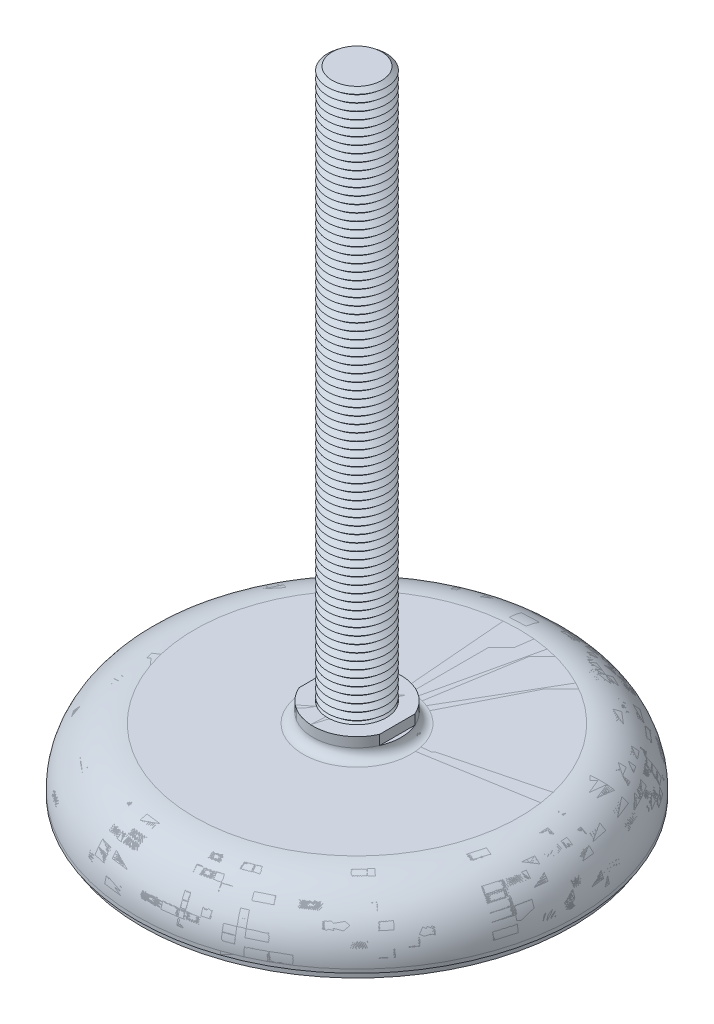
ISO-10303-21;
HEADER;
FILE_DESCRIPTION(('STEP AP214'),'2;1');
FILE_NAME('part.step','',(''),(''),'','','');
FILE_SCHEMA(('AUTOMOTIVE_DESIGN { 1 0 10303 214 1 1 1 1 }'));
ENDSEC;
DATA;
#1=APPLICATION_CONTEXT('core data for automotive mechanical design processes');
#2=APPLICATION_PROTOCOL_DEFINITION('international standard','automotive_design',2000,#1);
#3=PRODUCT_CONTEXT('',#1,'mechanical');
#4=PRODUCT('Part','Part','',(#3));
#5=PRODUCT_RELATED_PRODUCT_CATEGORY('part','',(#4));
#6=PRODUCT_DEFINITION_FORMATION('','',#4);
#7=PRODUCT_DEFINITION_CONTEXT('part definition',#1,'design');
#8=PRODUCT_DEFINITION('design','',#6,#7);
#9=PRODUCT_DEFINITION_SHAPE('','',#8);
#10=(LENGTH_UNIT() NAMED_UNIT(*) SI_UNIT(.MILLI.,.METRE.));
#11=(NAMED_UNIT(*) PLANE_ANGLE_UNIT() SI_UNIT($,.RADIAN.));
#12=(NAMED_UNIT(*) SI_UNIT($,.STERADIAN.) SOLID_ANGLE_UNIT());
#13=UNCERTAINTY_MEASURE_WITH_UNIT(LENGTH_MEASURE(1.E-05),#10,'distance_accuracy_value','');
#14=(GEOMETRIC_REPRESENTATION_CONTEXT(3) GLOBAL_UNCERTAINTY_ASSIGNED_CONTEXT((#13)) GLOBAL_UNIT_ASSIGNED_CONTEXT((#10,
#11,#12)) REPRESENTATION_CONTEXT('',''));
#15=CARTESIAN_POINT('',(0.,0.,0.));
#16=DIRECTION('',(0.,0.,1.));
#17=DIRECTION('',(1.,0.,0.));
#18=AXIS2_PLACEMENT_3D('',#15,#16,#17);
#19=CARTESIAN_POINT('',(0.,169.,0.));
#20=DIRECTION('',(0.,-1.,0.));
#21=DIRECTION('',(0.998136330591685,0.,-0.0610234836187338));
#22=AXIS2_PLACEMENT_3D('',#19,#20,#21);
#23=CONICAL_SURFACE('',#22,6.75100040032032,0.895664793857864);
#24=CARTESIAN_POINT('',(0.,168.,0.));
#25=DIRECTION('',(0.,-1.,0.));
#26=DIRECTION('',(0.998136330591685,0.,-0.0610234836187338));
#27=AXIS2_PLACEMENT_3D('',#24,#25,#26);
#28=CIRCLE('',#27,8.);
#29=CARTESIAN_POINT('',(7.98509064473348,168.,-0.488187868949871));
#30=VERTEX_POINT('',#29);
#31=EDGE_CURVE('P0_E37',#30,#30,#28,.T.);
#32=ORIENTED_EDGE('',*,*,#31,.F.);
#33=EDGE_LOOP('',(#32));
#34=FACE_BOUND('',#33,.T.);
#35=CARTESIAN_POINT('',(0.,169.,0.));
#36=DIRECTION('',(0.,-1.,0.));
#37=DIRECTION('',(0.998136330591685,0.,-0.0610234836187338));
#38=AXIS2_PLACEMENT_3D('',#35,#36,#37);
#39=CIRCLE('',#38,6.75100040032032);
#40=CARTESIAN_POINT('',(6.73841876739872,169.,-0.411969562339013));
#41=VERTEX_POINT('',#40);
#42=EDGE_CURVE('P0_E25',#41,#41,#39,.T.);
#43=ORIENTED_EDGE('',*,*,#42,.T.);
#44=EDGE_LOOP('',(#43));
#45=FACE_BOUND('',#44,.T.);
#46=ADVANCED_FACE('P0_F14',(#34,#45),#23,.T.);
#47=CARTESIAN_POINT('',(0.,170.,0.));
#48=DIRECTION('',(0.,1.,0.));
#49=DIRECTION('',(-0.998136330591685,0.,0.0610234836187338));
#50=AXIS2_PLACEMENT_3D('',#47,#48,#49);
#51=CONICAL_SURFACE('',#50,8.,0.895664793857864);
#52=ORIENTED_EDGE('',*,*,#42,.F.);
#53=EDGE_LOOP('',(#52));
#54=FACE_BOUND('',#53,.T.);
#55=CARTESIAN_POINT('',(0.,170.,0.));
#56=DIRECTION('',(0.,-1.,0.));
#57=DIRECTION('',(0.998136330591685,0.,-0.0610234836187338));
#58=AXIS2_PLACEMENT_3D('',#55,#56,#57);
#59=CIRCLE('',#58,8.);
#60=CARTESIAN_POINT('',(7.98509064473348,170.,-0.488187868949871));
#61=VERTEX_POINT('',#60);
#62=EDGE_CURVE('P0_E29',#61,#61,#59,.T.);
#63=ORIENTED_EDGE('',*,*,#62,.T.);
#64=EDGE_LOOP('',(#63));
#65=FACE_BOUND('',#64,.T.);
#66=ADVANCED_FACE('P0_F1465',(#54,#65),#51,.T.);
#67=CARTESIAN_POINT('',(0.,171.,0.));
#68=DIRECTION('',(0.,1.,0.));
#69=DIRECTION('',(-0.998136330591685,0.,0.0610234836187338));
#70=AXIS2_PLACEMENT_3D('',#67,#68,#69);
#71=PLANE('',#70);
#72=CARTESIAN_POINT('',(0.,171.,0.));
#73=DIRECTION('',(0.,-1.,0.));
#74=DIRECTION('',(0.998136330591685,0.,-0.0610234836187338));
#75=AXIS2_PLACEMENT_3D('',#72,#73,#74);
#76=CIRCLE('',#75,6.75100040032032);
#77=CARTESIAN_POINT('',(6.73841876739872,171.,-0.411969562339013));
#78=VERTEX_POINT('',#77);
#79=EDGE_CURVE('P0_E21',#78,#78,#76,.T.);
#80=ORIENTED_EDGE('',*,*,#79,.F.);
#81=EDGE_LOOP('',(#80));
#82=FACE_BOUND('',#81,.T.);
#83=ADVANCED_FACE('P0_F1471',(#82),#71,.T.);
#84=CARTESIAN_POINT('',(0.,171.,0.));
#85=DIRECTION('',(0.,-1.,0.));
#86=DIRECTION('',(0.998136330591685,0.,-0.0610234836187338));
#87=AXIS2_PLACEMENT_3D('',#84,#85,#86);
#88=CONICAL_SURFACE('',#87,6.75100040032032,0.895664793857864);
#89=ORIENTED_EDGE('',*,*,#62,.F.);
#90=EDGE_LOOP('',(#89));
#91=FACE_BOUND('',#90,.T.);
#92=ORIENTED_EDGE('',*,*,#79,.T.);
#93=EDGE_LOOP('',(#92));
#94=FACE_BOUND('',#93,.T.);
#95=ADVANCED_FACE('P0_F1454',(#91,#94),#88,.T.);
#96=CARTESIAN_POINT('',(0.,167.,0.));
#97=DIRECTION('',(0.,-1.,0.));
#98=DIRECTION('',(0.998136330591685,0.,-0.0610234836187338));
#99=AXIS2_PLACEMENT_3D('',#96,#97,#98);
#100=CONICAL_SURFACE('',#99,6.75100040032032,0.895664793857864);
#101=CARTESIAN_POINT('',(0.,166.,0.));
#102=DIRECTION('',(0.,-1.,0.));
#103=DIRECTION('',(0.998136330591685,0.,-0.0610234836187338));
#104=AXIS2_PLACEMENT_3D('',#101,#102,#103);
#105=CIRCLE('',#104,8.);
#106=CARTESIAN_POINT('',(7.98509064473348,166.,-0.488187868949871));
#107=VERTEX_POINT('',#106);
#108=EDGE_CURVE('P0_E43',#107,#107,#105,.T.);
#109=ORIENTED_EDGE('',*,*,#108,.F.);
#110=EDGE_LOOP('',(#109));
#111=FACE_BOUND('',#110,.T.);
#112=CARTESIAN_POINT('',(0.,167.,0.));
#113=DIRECTION('',(0.,-1.,0.));
#114=DIRECTION('',(0.998136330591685,0.,-0.0610234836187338));
#115=AXIS2_PLACEMENT_3D('',#112,#113,#114);
#116=CIRCLE('',#115,6.75100040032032);
#117=CARTESIAN_POINT('',(6.73841876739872,167.,-0.411969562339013));
#118=VERTEX_POINT('',#117);
#119=EDGE_CURVE('P0_E34',#118,#118,#116,.T.);
#120=ORIENTED_EDGE('',*,*,#119,.T.);
#121=EDGE_LOOP('',(#120));
#122=FACE_BOUND('',#121,.T.);
#123=ADVANCED_FACE('P0_F1451',(#111,#122),#100,.T.);
#124=CARTESIAN_POINT('',(0.,168.,0.));
#125=DIRECTION('',(0.,1.,0.));
#126=DIRECTION('',(-0.998136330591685,0.,0.0610234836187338));
#127=AXIS2_PLACEMENT_3D('',#124,#125,#126);
#128=CONICAL_SURFACE('',#127,8.,0.895664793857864);
#129=ORIENTED_EDGE('',*,*,#119,.F.);
#130=EDGE_LOOP('',(#129));
#131=FACE_BOUND('',#130,.T.);
#132=ORIENTED_EDGE('',*,*,#31,.T.);
#133=EDGE_LOOP('',(#132));
#134=FACE_BOUND('',#133,.T.);
#135=ADVANCED_FACE('P0_F1442',(#131,#134),#128,.T.);
#136=CARTESIAN_POINT('',(0.,165.,0.));
#137=DIRECTION('',(0.,-1.,0.));
#138=DIRECTION('',(0.998136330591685,0.,-0.0610234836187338));
#139=AXIS2_PLACEMENT_3D('',#136,#137,#138);
#140=CONICAL_SURFACE('',#139,6.75100040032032,0.895664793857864);
#141=CARTESIAN_POINT('',(0.,164.,0.));
#142=DIRECTION('',(0.,-1.,0.));
#143=DIRECTION('',(0.998136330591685,0.,-0.0610234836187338));
#144=AXIS2_PLACEMENT_3D('',#141,#142,#143);
#145=CIRCLE('',#144,8.);
#146=CARTESIAN_POINT('',(7.98509064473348,164.,-0.488187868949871));
#147=VERTEX_POINT('',#146);
#148=EDGE_CURVE('P0_E49',#147,#147,#145,.T.);
#149=ORIENTED_EDGE('',*,*,#148,.F.);
#150=EDGE_LOOP('',(#149));
#151=FACE_BOUND('',#150,.T.);
#152=CARTESIAN_POINT('',(0.,165.,0.));
#153=DIRECTION('',(0.,-1.,0.));
#154=DIRECTION('',(0.998136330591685,0.,-0.0610234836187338));
#155=AXIS2_PLACEMENT_3D('',#152,#153,#154);
#156=CIRCLE('',#155,6.75100040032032);
#157=CARTESIAN_POINT('',(6.73841876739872,165.,-0.411969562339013));
#158=VERTEX_POINT('',#157);
#159=EDGE_CURVE('P0_E40',#158,#158,#156,.T.);
#160=ORIENTED_EDGE('',*,*,#159,.T.);
#161=EDGE_LOOP('',(#160));
#162=FACE_BOUND('',#161,.T.);
#163=ADVANCED_FACE('P0_F1439',(#151,#162),#140,.T.);
#164=CARTESIAN_POINT('',(0.,166.,0.));
#165=DIRECTION('',(0.,1.,0.));
#166=DIRECTION('',(-0.998136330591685,0.,0.0610234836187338));
#167=AXIS2_PLACEMENT_3D('',#164,#165,#166);
#168=CONICAL_SURFACE('',#167,8.,0.895664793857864);
#169=ORIENTED_EDGE('',*,*,#159,.F.);
#170=EDGE_LOOP('',(#169));
#171=FACE_BOUND('',#170,.T.);
#172=ORIENTED_EDGE('',*,*,#108,.T.);
#173=EDGE_LOOP('',(#172));
#174=FACE_BOUND('',#173,.T.);
#175=ADVANCED_FACE('P0_F1430',(#171,#174),#168,.T.);
#176=CARTESIAN_POINT('',(0.,163.,0.));
#177=DIRECTION('',(0.,-1.,0.));
#178=DIRECTION('',(0.998136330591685,0.,-0.0610234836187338));
#179=AXIS2_PLACEMENT_3D('',#176,#177,#178);
#180=CONICAL_SURFACE('',#179,6.75100040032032,0.895664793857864);
#181=CARTESIAN_POINT('',(0.,162.,0.));
#182=DIRECTION('',(0.,-1.,0.));
#183=DIRECTION('',(0.998136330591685,0.,-0.0610234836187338));
#184=AXIS2_PLACEMENT_3D('',#181,#182,#183);
#185=CIRCLE('',#184,8.);
#186=CARTESIAN_POINT('',(7.98509064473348,162.,-0.488187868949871));
#187=VERTEX_POINT('',#186);
#188=EDGE_CURVE('P0_E55',#187,#187,#185,.T.);
#189=ORIENTED_EDGE('',*,*,#188,.F.);
#190=EDGE_LOOP('',(#189));
#191=FACE_BOUND('',#190,.T.);
#192=CARTESIAN_POINT('',(0.,163.,0.));
#193=DIRECTION('',(0.,-1.,0.));
#194=DIRECTION('',(0.998136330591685,0.,-0.0610234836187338));
#195=AXIS2_PLACEMENT_3D('',#192,#193,#194);
#196=CIRCLE('',#195,6.75100040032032);
#197=CARTESIAN_POINT('',(6.73841876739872,163.,-0.411969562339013));
#198=VERTEX_POINT('',#197);
#199=EDGE_CURVE('P0_E46',#198,#198,#196,.T.);
#200=ORIENTED_EDGE('',*,*,#199,.T.);
#201=EDGE_LOOP('',(#200));
#202=FACE_BOUND('',#201,.T.);
#203=ADVANCED_FACE('P0_F1427',(#191,#202),#180,.T.);
#204=CARTESIAN_POINT('',(0.,164.,0.));
#205=DIRECTION('',(0.,1.,0.));
#206=DIRECTION('',(-0.998136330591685,0.,0.0610234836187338));
#207=AXIS2_PLACEMENT_3D('',#204,#205,#206);
#208=CONICAL_SURFACE('',#207,8.,0.895664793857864);
#209=ORIENTED_EDGE('',*,*,#199,.F.);
#210=EDGE_LOOP('',(#209));
#211=FACE_BOUND('',#210,.T.);
#212=ORIENTED_EDGE('',*,*,#148,.T.);
#213=EDGE_LOOP('',(#212));
#214=FACE_BOUND('',#213,.T.);
#215=ADVANCED_FACE('P0_F1418',(#211,#214),#208,.T.);
#216=CARTESIAN_POINT('',(0.,161.,0.));
#217=DIRECTION('',(0.,-1.,0.));
#218=DIRECTION('',(0.998136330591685,0.,-0.0610234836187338));
#219=AXIS2_PLACEMENT_3D('',#216,#217,#218);
#220=CONICAL_SURFACE('',#219,6.75100040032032,0.895664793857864);
#221=CARTESIAN_POINT('',(0.,160.,0.));
#222=DIRECTION('',(0.,-1.,0.));
#223=DIRECTION('',(0.998136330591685,0.,-0.0610234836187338));
#224=AXIS2_PLACEMENT_3D('',#221,#222,#223);
#225=CIRCLE('',#224,8.);
#226=CARTESIAN_POINT('',(7.98509064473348,160.,-0.488187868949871));
#227=VERTEX_POINT('',#226);
#228=EDGE_CURVE('P0_E61',#227,#227,#225,.T.);
#229=ORIENTED_EDGE('',*,*,#228,.F.);
#230=EDGE_LOOP('',(#229));
#231=FACE_BOUND('',#230,.T.);
#232=CARTESIAN_POINT('',(0.,161.,0.));
#233=DIRECTION('',(0.,-1.,0.));
#234=DIRECTION('',(0.998136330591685,0.,-0.0610234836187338));
#235=AXIS2_PLACEMENT_3D('',#232,#233,#234);
#236=CIRCLE('',#235,6.75100040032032);
#237=CARTESIAN_POINT('',(6.73841876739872,161.,-0.411969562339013));
#238=VERTEX_POINT('',#237);
#239=EDGE_CURVE('P0_E52',#238,#238,#236,.T.);
#240=ORIENTED_EDGE('',*,*,#239,.T.);
#241=EDGE_LOOP('',(#240));
#242=FACE_BOUND('',#241,.T.);
#243=ADVANCED_FACE('P0_F1415',(#231,#242),#220,.T.);
#244=CARTESIAN_POINT('',(0.,162.,0.));
#245=DIRECTION('',(0.,1.,0.));
#246=DIRECTION('',(-0.998136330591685,0.,0.0610234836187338));
#247=AXIS2_PLACEMENT_3D('',#244,#245,#246);
#248=CONICAL_SURFACE('',#247,8.,0.895664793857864);
#249=ORIENTED_EDGE('',*,*,#239,.F.);
#250=EDGE_LOOP('',(#249));
#251=FACE_BOUND('',#250,.T.);
#252=ORIENTED_EDGE('',*,*,#188,.T.);
#253=EDGE_LOOP('',(#252));
#254=FACE_BOUND('',#253,.T.);
#255=ADVANCED_FACE('P0_F1406',(#251,#254),#248,.T.);
#256=CARTESIAN_POINT('',(0.,159.,0.));
#257=DIRECTION('',(0.,-1.,0.));
#258=DIRECTION('',(0.998136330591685,0.,-0.0610234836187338));
#259=AXIS2_PLACEMENT_3D('',#256,#257,#258);
#260=CONICAL_SURFACE('',#259,6.75100040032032,0.895664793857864);
#261=CARTESIAN_POINT('',(0.,158.,0.));
#262=DIRECTION('',(0.,-1.,0.));
#263=DIRECTION('',(0.998136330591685,0.,-0.0610234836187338));
#264=AXIS2_PLACEMENT_3D('',#261,#262,#263);
#265=CIRCLE('',#264,8.);
#266=CARTESIAN_POINT('',(7.98509064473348,158.,-0.488187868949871));
#267=VERTEX_POINT('',#266);
#268=EDGE_CURVE('P0_E67',#267,#267,#265,.T.);
#269=ORIENTED_EDGE('',*,*,#268,.F.);
#270=EDGE_LOOP('',(#269));
#271=FACE_BOUND('',#270,.T.);
#272=CARTESIAN_POINT('',(0.,159.,0.));
#273=DIRECTION('',(0.,-1.,0.));
#274=DIRECTION('',(0.998136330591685,0.,-0.0610234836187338));
#275=AXIS2_PLACEMENT_3D('',#272,#273,#274);
#276=CIRCLE('',#275,6.75100040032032);
#277=CARTESIAN_POINT('',(6.73841876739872,159.,-0.411969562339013));
#278=VERTEX_POINT('',#277);
#279=EDGE_CURVE('P0_E58',#278,#278,#276,.T.);
#280=ORIENTED_EDGE('',*,*,#279,.T.);
#281=EDGE_LOOP('',(#280));
#282=FACE_BOUND('',#281,.T.);
#283=ADVANCED_FACE('P0_F1403',(#271,#282),#260,.T.);
#284=CARTESIAN_POINT('',(0.,160.,0.));
#285=DIRECTION('',(0.,1.,0.));
#286=DIRECTION('',(-0.998136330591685,0.,0.0610234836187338));
#287=AXIS2_PLACEMENT_3D('',#284,#285,#286);
#288=CONICAL_SURFACE('',#287,8.,0.895664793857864);
#289=ORIENTED_EDGE('',*,*,#279,.F.);
#290=EDGE_LOOP('',(#289));
#291=FACE_BOUND('',#290,.T.);
#292=ORIENTED_EDGE('',*,*,#228,.T.);
#293=EDGE_LOOP('',(#292));
#294=FACE_BOUND('',#293,.T.);
#295=ADVANCED_FACE('P0_F1394',(#291,#294),#288,.T.);
#296=CARTESIAN_POINT('',(0.,157.,0.));
#297=DIRECTION('',(0.,-1.,0.));
#298=DIRECTION('',(0.998136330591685,0.,-0.0610234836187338));
#299=AXIS2_PLACEMENT_3D('',#296,#297,#298);
#300=CONICAL_SURFACE('',#299,6.75100040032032,0.895664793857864);
#301=CARTESIAN_POINT('',(0.,156.,0.));
#302=DIRECTION('',(0.,-1.,0.));
#303=DIRECTION('',(0.998136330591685,0.,-0.0610234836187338));
#304=AXIS2_PLACEMENT_3D('',#301,#302,#303);
#305=CIRCLE('',#304,8.);
#306=CARTESIAN_POINT('',(7.98509064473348,156.,-0.488187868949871));
#307=VERTEX_POINT('',#306);
#308=EDGE_CURVE('P0_E73',#307,#307,#305,.T.);
#309=ORIENTED_EDGE('',*,*,#308,.F.);
#310=EDGE_LOOP('',(#309));
#311=FACE_BOUND('',#310,.T.);
#312=CARTESIAN_POINT('',(0.,157.,0.));
#313=DIRECTION('',(0.,-1.,0.));
#314=DIRECTION('',(0.998136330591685,0.,-0.0610234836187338));
#315=AXIS2_PLACEMENT_3D('',#312,#313,#314);
#316=CIRCLE('',#315,6.75100040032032);
#317=CARTESIAN_POINT('',(6.73841876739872,157.,-0.411969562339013));
#318=VERTEX_POINT('',#317);
#319=EDGE_CURVE('P0_E64',#318,#318,#316,.T.);
#320=ORIENTED_EDGE('',*,*,#319,.T.);
#321=EDGE_LOOP('',(#320));
#322=FACE_BOUND('',#321,.T.);
#323=ADVANCED_FACE('P0_F1391',(#311,#322),#300,.T.);
#324=CARTESIAN_POINT('',(0.,158.,0.));
#325=DIRECTION('',(0.,1.,0.));
#326=DIRECTION('',(-0.998136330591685,0.,0.0610234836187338));
#327=AXIS2_PLACEMENT_3D('',#324,#325,#326);
#328=CONICAL_SURFACE('',#327,8.,0.895664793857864);
#329=ORIENTED_EDGE('',*,*,#319,.F.);
#330=EDGE_LOOP('',(#329));
#331=FACE_BOUND('',#330,.T.);
#332=ORIENTED_EDGE('',*,*,#268,.T.);
#333=EDGE_LOOP('',(#332));
#334=FACE_BOUND('',#333,.T.);
#335=ADVANCED_FACE('P0_F1382',(#331,#334),#328,.T.);
#336=CARTESIAN_POINT('',(0.,155.,0.));
#337=DIRECTION('',(0.,-1.,0.));
#338=DIRECTION('',(0.998136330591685,0.,-0.0610234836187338));
#339=AXIS2_PLACEMENT_3D('',#336,#337,#338);
#340=CONICAL_SURFACE('',#339,6.75100040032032,0.895664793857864);
#341=CARTESIAN_POINT('',(0.,154.,0.));
#342=DIRECTION('',(0.,-1.,0.));
#343=DIRECTION('',(0.998136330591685,0.,-0.0610234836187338));
#344=AXIS2_PLACEMENT_3D('',#341,#342,#343);
#345=CIRCLE('',#344,8.);
#346=CARTESIAN_POINT('',(7.98509064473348,154.,-0.488187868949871));
#347=VERTEX_POINT('',#346);
#348=EDGE_CURVE('P0_E79',#347,#347,#345,.T.);
#349=ORIENTED_EDGE('',*,*,#348,.F.);
#350=EDGE_LOOP('',(#349));
#351=FACE_BOUND('',#350,.T.);
#352=CARTESIAN_POINT('',(0.,155.,0.));
#353=DIRECTION('',(0.,-1.,0.));
#354=DIRECTION('',(0.998136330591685,0.,-0.0610234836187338));
#355=AXIS2_PLACEMENT_3D('',#352,#353,#354);
#356=CIRCLE('',#355,6.75100040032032);
#357=CARTESIAN_POINT('',(6.73841876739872,155.,-0.411969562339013));
#358=VERTEX_POINT('',#357);
#359=EDGE_CURVE('P0_E70',#358,#358,#356,.T.);
#360=ORIENTED_EDGE('',*,*,#359,.T.);
#361=EDGE_LOOP('',(#360));
#362=FACE_BOUND('',#361,.T.);
#363=ADVANCED_FACE('P0_F1379',(#351,#362),#340,.T.);
#364=CARTESIAN_POINT('',(0.,156.,0.));
#365=DIRECTION('',(0.,1.,0.));
#366=DIRECTION('',(-0.998136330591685,0.,0.0610234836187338));
#367=AXIS2_PLACEMENT_3D('',#364,#365,#366);
#368=CONICAL_SURFACE('',#367,8.,0.895664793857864);
#369=ORIENTED_EDGE('',*,*,#359,.F.);
#370=EDGE_LOOP('',(#369));
#371=FACE_BOUND('',#370,.T.);
#372=ORIENTED_EDGE('',*,*,#308,.T.);
#373=EDGE_LOOP('',(#372));
#374=FACE_BOUND('',#373,.T.);
#375=ADVANCED_FACE('P0_F1370',(#371,#374),#368,.T.);
#376=CARTESIAN_POINT('',(0.,153.,0.));
#377=DIRECTION('',(0.,-1.,0.));
#378=DIRECTION('',(0.998136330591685,0.,-0.0610234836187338));
#379=AXIS2_PLACEMENT_3D('',#376,#377,#378);
#380=CONICAL_SURFACE('',#379,6.75100040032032,0.895664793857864);
#381=CARTESIAN_POINT('',(0.,152.,0.));
#382=DIRECTION('',(0.,-1.,0.));
#383=DIRECTION('',(0.998136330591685,0.,-0.0610234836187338));
#384=AXIS2_PLACEMENT_3D('',#381,#382,#383);
#385=CIRCLE('',#384,8.);
#386=CARTESIAN_POINT('',(7.98509064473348,152.,-0.488187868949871));
#387=VERTEX_POINT('',#386);
#388=EDGE_CURVE('P0_E85',#387,#387,#385,.T.);
#389=ORIENTED_EDGE('',*,*,#388,.F.);
#390=EDGE_LOOP('',(#389));
#391=FACE_BOUND('',#390,.T.);
#392=CARTESIAN_POINT('',(0.,153.,0.));
#393=DIRECTION('',(0.,-1.,0.));
#394=DIRECTION('',(0.998136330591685,0.,-0.0610234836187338));
#395=AXIS2_PLACEMENT_3D('',#392,#393,#394);
#396=CIRCLE('',#395,6.75100040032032);
#397=CARTESIAN_POINT('',(6.73841876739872,153.,-0.411969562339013));
#398=VERTEX_POINT('',#397);
#399=EDGE_CURVE('P0_E76',#398,#398,#396,.T.);
#400=ORIENTED_EDGE('',*,*,#399,.T.);
#401=EDGE_LOOP('',(#400));
#402=FACE_BOUND('',#401,.T.);
#403=ADVANCED_FACE('P0_F1367',(#391,#402),#380,.T.);
#404=CARTESIAN_POINT('',(0.,154.,0.));
#405=DIRECTION('',(0.,1.,0.));
#406=DIRECTION('',(-0.998136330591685,0.,0.0610234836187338));
#407=AXIS2_PLACEMENT_3D('',#404,#405,#406);
#408=CONICAL_SURFACE('',#407,8.,0.895664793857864);
#409=ORIENTED_EDGE('',*,*,#399,.F.);
#410=EDGE_LOOP('',(#409));
#411=FACE_BOUND('',#410,.T.);
#412=ORIENTED_EDGE('',*,*,#348,.T.);
#413=EDGE_LOOP('',(#412));
#414=FACE_BOUND('',#413,.T.);
#415=ADVANCED_FACE('P0_F1358',(#411,#414),#408,.T.);
#416=CARTESIAN_POINT('',(0.,151.,0.));
#417=DIRECTION('',(0.,-1.,0.));
#418=DIRECTION('',(0.998136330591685,0.,-0.0610234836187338));
#419=AXIS2_PLACEMENT_3D('',#416,#417,#418);
#420=CONICAL_SURFACE('',#419,6.75100040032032,0.895664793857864);
#421=CARTESIAN_POINT('',(0.,150.,0.));
#422=DIRECTION('',(0.,-1.,0.));
#423=DIRECTION('',(0.998136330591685,0.,-0.0610234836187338));
#424=AXIS2_PLACEMENT_3D('',#421,#422,#423);
#425=CIRCLE('',#424,8.);
#426=CARTESIAN_POINT('',(7.98509064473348,150.,-0.488187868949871));
#427=VERTEX_POINT('',#426);
#428=EDGE_CURVE('P0_E91',#427,#427,#425,.T.);
#429=ORIENTED_EDGE('',*,*,#428,.F.);
#430=EDGE_LOOP('',(#429));
#431=FACE_BOUND('',#430,.T.);
#432=CARTESIAN_POINT('',(0.,151.,0.));
#433=DIRECTION('',(0.,-1.,0.));
#434=DIRECTION('',(0.998136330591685,0.,-0.0610234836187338));
#435=AXIS2_PLACEMENT_3D('',#432,#433,#434);
#436=CIRCLE('',#435,6.75100040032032);
#437=CARTESIAN_POINT('',(6.73841876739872,151.,-0.411969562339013));
#438=VERTEX_POINT('',#437);
#439=EDGE_CURVE('P0_E82',#438,#438,#436,.T.);
#440=ORIENTED_EDGE('',*,*,#439,.T.);
#441=EDGE_LOOP('',(#440));
#442=FACE_BOUND('',#441,.T.);
#443=ADVANCED_FACE('P0_F1355',(#431,#442),#420,.T.);
#444=CARTESIAN_POINT('',(0.,152.,0.));
#445=DIRECTION('',(0.,1.,0.));
#446=DIRECTION('',(-0.998136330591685,0.,0.0610234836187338));
#447=AXIS2_PLACEMENT_3D('',#444,#445,#446);
#448=CONICAL_SURFACE('',#447,8.,0.895664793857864);
#449=ORIENTED_EDGE('',*,*,#439,.F.);
#450=EDGE_LOOP('',(#449));
#451=FACE_BOUND('',#450,.T.);
#452=ORIENTED_EDGE('',*,*,#388,.T.);
#453=EDGE_LOOP('',(#452));
#454=FACE_BOUND('',#453,.T.);
#455=ADVANCED_FACE('P0_F1346',(#451,#454),#448,.T.);
#456=CARTESIAN_POINT('',(0.,149.,0.));
#457=DIRECTION('',(0.,-1.,0.));
#458=DIRECTION('',(0.998136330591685,0.,-0.0610234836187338));
#459=AXIS2_PLACEMENT_3D('',#456,#457,#458);
#460=CONICAL_SURFACE('',#459,6.75100040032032,0.895664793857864);
#461=CARTESIAN_POINT('',(0.,148.,0.));
#462=DIRECTION('',(0.,-1.,0.));
#463=DIRECTION('',(0.998136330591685,0.,-0.0610234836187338));
#464=AXIS2_PLACEMENT_3D('',#461,#462,#463);
#465=CIRCLE('',#464,8.);
#466=CARTESIAN_POINT('',(7.98509064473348,148.,-0.488187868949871));
#467=VERTEX_POINT('',#466);
#468=EDGE_CURVE('P0_E97',#467,#467,#465,.T.);
#469=ORIENTED_EDGE('',*,*,#468,.F.);
#470=EDGE_LOOP('',(#469));
#471=FACE_BOUND('',#470,.T.);
#472=CARTESIAN_POINT('',(0.,149.,0.));
#473=DIRECTION('',(0.,-1.,0.));
#474=DIRECTION('',(0.998136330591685,0.,-0.0610234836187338));
#475=AXIS2_PLACEMENT_3D('',#472,#473,#474);
#476=CIRCLE('',#475,6.75100040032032);
#477=CARTESIAN_POINT('',(6.73841876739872,149.,-0.411969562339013));
#478=VERTEX_POINT('',#477);
#479=EDGE_CURVE('P0_E88',#478,#478,#476,.T.);
#480=ORIENTED_EDGE('',*,*,#479,.T.);
#481=EDGE_LOOP('',(#480));
#482=FACE_BOUND('',#481,.T.);
#483=ADVANCED_FACE('P0_F1343',(#471,#482),#460,.T.);
#484=CARTESIAN_POINT('',(0.,150.,0.));
#485=DIRECTION('',(0.,1.,0.));
#486=DIRECTION('',(-0.998136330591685,0.,0.0610234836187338));
#487=AXIS2_PLACEMENT_3D('',#484,#485,#486);
#488=CONICAL_SURFACE('',#487,8.,0.895664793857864);
#489=ORIENTED_EDGE('',*,*,#479,.F.);
#490=EDGE_LOOP('',(#489));
#491=FACE_BOUND('',#490,.T.);
#492=ORIENTED_EDGE('',*,*,#428,.T.);
#493=EDGE_LOOP('',(#492));
#494=FACE_BOUND('',#493,.T.);
#495=ADVANCED_FACE('P0_F1334',(#491,#494),#488,.T.);
#496=CARTESIAN_POINT('',(0.,147.,0.));
#497=DIRECTION('',(0.,-1.,0.));
#498=DIRECTION('',(0.998136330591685,0.,-0.0610234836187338));
#499=AXIS2_PLACEMENT_3D('',#496,#497,#498);
#500=CONICAL_SURFACE('',#499,6.75100040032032,0.895664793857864);
#501=CARTESIAN_POINT('',(0.,146.,0.));
#502=DIRECTION('',(0.,-1.,0.));
#503=DIRECTION('',(0.998136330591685,0.,-0.0610234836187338));
#504=AXIS2_PLACEMENT_3D('',#501,#502,#503);
#505=CIRCLE('',#504,8.);
#506=CARTESIAN_POINT('',(7.98509064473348,146.,-0.488187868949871));
#507=VERTEX_POINT('',#506);
#508=EDGE_CURVE('P0_E103',#507,#507,#505,.T.);
#509=ORIENTED_EDGE('',*,*,#508,.F.);
#510=EDGE_LOOP('',(#509));
#511=FACE_BOUND('',#510,.T.);
#512=CARTESIAN_POINT('',(0.,147.,0.));
#513=DIRECTION('',(0.,-1.,0.));
#514=DIRECTION('',(0.998136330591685,0.,-0.0610234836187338));
#515=AXIS2_PLACEMENT_3D('',#512,#513,#514);
#516=CIRCLE('',#515,6.75100040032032);
#517=CARTESIAN_POINT('',(6.73841876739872,147.,-0.411969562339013));
#518=VERTEX_POINT('',#517);
#519=EDGE_CURVE('P0_E94',#518,#518,#516,.T.);
#520=ORIENTED_EDGE('',*,*,#519,.T.);
#521=EDGE_LOOP('',(#520));
#522=FACE_BOUND('',#521,.T.);
#523=ADVANCED_FACE('P0_F1331',(#511,#522),#500,.T.);
#524=CARTESIAN_POINT('',(0.,148.,0.));
#525=DIRECTION('',(0.,1.,0.));
#526=DIRECTION('',(-0.998136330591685,0.,0.0610234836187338));
#527=AXIS2_PLACEMENT_3D('',#524,#525,#526);
#528=CONICAL_SURFACE('',#527,8.,0.895664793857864);
#529=ORIENTED_EDGE('',*,*,#519,.F.);
#530=EDGE_LOOP('',(#529));
#531=FACE_BOUND('',#530,.T.);
#532=ORIENTED_EDGE('',*,*,#468,.T.);
#533=EDGE_LOOP('',(#532));
#534=FACE_BOUND('',#533,.T.);
#535=ADVANCED_FACE('P0_F1322',(#531,#534),#528,.T.);
#536=CARTESIAN_POINT('',(0.,145.,0.));
#537=DIRECTION('',(0.,-1.,0.));
#538=DIRECTION('',(0.998136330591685,0.,-0.0610234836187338));
#539=AXIS2_PLACEMENT_3D('',#536,#537,#538);
#540=CONICAL_SURFACE('',#539,6.75100040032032,0.895664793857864);
#541=CARTESIAN_POINT('',(0.,144.,0.));
#542=DIRECTION('',(0.,-1.,0.));
#543=DIRECTION('',(0.998136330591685,0.,-0.0610234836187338));
#544=AXIS2_PLACEMENT_3D('',#541,#542,#543);
#545=CIRCLE('',#544,8.);
#546=CARTESIAN_POINT('',(7.98509064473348,144.,-0.488187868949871));
#547=VERTEX_POINT('',#546);
#548=EDGE_CURVE('P0_E109',#547,#547,#545,.T.);
#549=ORIENTED_EDGE('',*,*,#548,.F.);
#550=EDGE_LOOP('',(#549));
#551=FACE_BOUND('',#550,.T.);
#552=CARTESIAN_POINT('',(0.,145.,0.));
#553=DIRECTION('',(0.,-1.,0.));
#554=DIRECTION('',(0.998136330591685,0.,-0.0610234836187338));
#555=AXIS2_PLACEMENT_3D('',#552,#553,#554);
#556=CIRCLE('',#555,6.75100040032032);
#557=CARTESIAN_POINT('',(6.73841876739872,145.,-0.411969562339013));
#558=VERTEX_POINT('',#557);
#559=EDGE_CURVE('P0_E100',#558,#558,#556,.T.);
#560=ORIENTED_EDGE('',*,*,#559,.T.);
#561=EDGE_LOOP('',(#560));
#562=FACE_BOUND('',#561,.T.);
#563=ADVANCED_FACE('P0_F1319',(#551,#562),#540,.T.);
#564=CARTESIAN_POINT('',(0.,146.,0.));
#565=DIRECTION('',(0.,1.,0.));
#566=DIRECTION('',(-0.998136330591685,0.,0.0610234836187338));
#567=AXIS2_PLACEMENT_3D('',#564,#565,#566);
#568=CONICAL_SURFACE('',#567,8.,0.895664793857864);
#569=ORIENTED_EDGE('',*,*,#559,.F.);
#570=EDGE_LOOP('',(#569));
#571=FACE_BOUND('',#570,.T.);
#572=ORIENTED_EDGE('',*,*,#508,.T.);
#573=EDGE_LOOP('',(#572));
#574=FACE_BOUND('',#573,.T.);
#575=ADVANCED_FACE('P0_F1310',(#571,#574),#568,.T.);
#576=CARTESIAN_POINT('',(0.,143.,0.));
#577=DIRECTION('',(0.,-1.,0.));
#578=DIRECTION('',(0.998136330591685,0.,-0.0610234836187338));
#579=AXIS2_PLACEMENT_3D('',#576,#577,#578);
#580=CONICAL_SURFACE('',#579,6.75100040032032,0.895664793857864);
#581=CARTESIAN_POINT('',(0.,142.,0.));
#582=DIRECTION('',(0.,-1.,0.));
#583=DIRECTION('',(0.998136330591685,0.,-0.0610234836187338));
#584=AXIS2_PLACEMENT_3D('',#581,#582,#583);
#585=CIRCLE('',#584,8.);
#586=CARTESIAN_POINT('',(7.98509064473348,142.,-0.488187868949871));
#587=VERTEX_POINT('',#586);
#588=EDGE_CURVE('P0_E115',#587,#587,#585,.T.);
#589=ORIENTED_EDGE('',*,*,#588,.F.);
#590=EDGE_LOOP('',(#589));
#591=FACE_BOUND('',#590,.T.);
#592=CARTESIAN_POINT('',(0.,143.,0.));
#593=DIRECTION('',(0.,-1.,0.));
#594=DIRECTION('',(0.998136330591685,0.,-0.0610234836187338));
#595=AXIS2_PLACEMENT_3D('',#592,#593,#594);
#596=CIRCLE('',#595,6.75100040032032);
#597=CARTESIAN_POINT('',(6.73841876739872,143.,-0.411969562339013));
#598=VERTEX_POINT('',#597);
#599=EDGE_CURVE('P0_E106',#598,#598,#596,.T.);
#600=ORIENTED_EDGE('',*,*,#599,.T.);
#601=EDGE_LOOP('',(#600));
#602=FACE_BOUND('',#601,.T.);
#603=ADVANCED_FACE('P0_F1307',(#591,#602),#580,.T.);
#604=CARTESIAN_POINT('',(0.,144.,0.));
#605=DIRECTION('',(0.,1.,0.));
#606=DIRECTION('',(-0.998136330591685,0.,0.0610234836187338));
#607=AXIS2_PLACEMENT_3D('',#604,#605,#606);
#608=CONICAL_SURFACE('',#607,8.,0.895664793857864);
#609=ORIENTED_EDGE('',*,*,#599,.F.);
#610=EDGE_LOOP('',(#609));
#611=FACE_BOUND('',#610,.T.);
#612=ORIENTED_EDGE('',*,*,#548,.T.);
#613=EDGE_LOOP('',(#612));
#614=FACE_BOUND('',#613,.T.);
#615=ADVANCED_FACE('P0_F1298',(#611,#614),#608,.T.);
#616=CARTESIAN_POINT('',(0.,141.,0.));
#617=DIRECTION('',(0.,-1.,0.));
#618=DIRECTION('',(0.998136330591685,0.,-0.0610234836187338));
#619=AXIS2_PLACEMENT_3D('',#616,#617,#618);
#620=CONICAL_SURFACE('',#619,6.75100040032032,0.895664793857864);
#621=CARTESIAN_POINT('',(0.,140.,0.));
#622=DIRECTION('',(0.,-1.,0.));
#623=DIRECTION('',(0.998136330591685,0.,-0.0610234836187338));
#624=AXIS2_PLACEMENT_3D('',#621,#622,#623);
#625=CIRCLE('',#624,8.);
#626=CARTESIAN_POINT('',(7.98509064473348,140.,-0.488187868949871));
#627=VERTEX_POINT('',#626);
#628=EDGE_CURVE('P0_E121',#627,#627,#625,.T.);
#629=ORIENTED_EDGE('',*,*,#628,.F.);
#630=EDGE_LOOP('',(#629));
#631=FACE_BOUND('',#630,.T.);
#632=CARTESIAN_POINT('',(0.,141.,0.));
#633=DIRECTION('',(0.,-1.,0.));
#634=DIRECTION('',(0.998136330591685,0.,-0.0610234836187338));
#635=AXIS2_PLACEMENT_3D('',#632,#633,#634);
#636=CIRCLE('',#635,6.75100040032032);
#637=CARTESIAN_POINT('',(6.73841876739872,141.,-0.411969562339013));
#638=VERTEX_POINT('',#637);
#639=EDGE_CURVE('P0_E112',#638,#638,#636,.T.);
#640=ORIENTED_EDGE('',*,*,#639,.T.);
#641=EDGE_LOOP('',(#640));
#642=FACE_BOUND('',#641,.T.);
#643=ADVANCED_FACE('P0_F1295',(#631,#642),#620,.T.);
#644=CARTESIAN_POINT('',(0.,142.,0.));
#645=DIRECTION('',(0.,1.,0.));
#646=DIRECTION('',(-0.998136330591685,0.,0.0610234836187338));
#647=AXIS2_PLACEMENT_3D('',#644,#645,#646);
#648=CONICAL_SURFACE('',#647,8.,0.895664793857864);
#649=ORIENTED_EDGE('',*,*,#639,.F.);
#650=EDGE_LOOP('',(#649));
#651=FACE_BOUND('',#650,.T.);
#652=ORIENTED_EDGE('',*,*,#588,.T.);
#653=EDGE_LOOP('',(#652));
#654=FACE_BOUND('',#653,.T.);
#655=ADVANCED_FACE('P0_F1286',(#651,#654),#648,.T.);
#656=CARTESIAN_POINT('',(0.,139.,0.));
#657=DIRECTION('',(0.,-1.,0.));
#658=DIRECTION('',(0.998136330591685,0.,-0.0610234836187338));
#659=AXIS2_PLACEMENT_3D('',#656,#657,#658);
#660=CONICAL_SURFACE('',#659,6.75100040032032,0.895664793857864);
#661=CARTESIAN_POINT('',(0.,138.,0.));
#662=DIRECTION('',(0.,-1.,0.));
#663=DIRECTION('',(0.998136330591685,0.,-0.0610234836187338));
#664=AXIS2_PLACEMENT_3D('',#661,#662,#663);
#665=CIRCLE('',#664,8.);
#666=CARTESIAN_POINT('',(7.98509064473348,138.,-0.488187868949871));
#667=VERTEX_POINT('',#666);
#668=EDGE_CURVE('P0_E127',#667,#667,#665,.T.);
#669=ORIENTED_EDGE('',*,*,#668,.F.);
#670=EDGE_LOOP('',(#669));
#671=FACE_BOUND('',#670,.T.);
#672=CARTESIAN_POINT('',(0.,139.,0.));
#673=DIRECTION('',(0.,-1.,0.));
#674=DIRECTION('',(0.998136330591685,0.,-0.0610234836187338));
#675=AXIS2_PLACEMENT_3D('',#672,#673,#674);
#676=CIRCLE('',#675,6.75100040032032);
#677=CARTESIAN_POINT('',(6.73841876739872,139.,-0.411969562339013));
#678=VERTEX_POINT('',#677);
#679=EDGE_CURVE('P0_E118',#678,#678,#676,.T.);
#680=ORIENTED_EDGE('',*,*,#679,.T.);
#681=EDGE_LOOP('',(#680));
#682=FACE_BOUND('',#681,.T.);
#683=ADVANCED_FACE('P0_F1283',(#671,#682),#660,.T.);
#684=CARTESIAN_POINT('',(0.,140.,0.));
#685=DIRECTION('',(0.,1.,0.));
#686=DIRECTION('',(-0.998136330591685,0.,0.0610234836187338));
#687=AXIS2_PLACEMENT_3D('',#684,#685,#686);
#688=CONICAL_SURFACE('',#687,8.,0.895664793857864);
#689=ORIENTED_EDGE('',*,*,#679,.F.);
#690=EDGE_LOOP('',(#689));
#691=FACE_BOUND('',#690,.T.);
#692=ORIENTED_EDGE('',*,*,#628,.T.);
#693=EDGE_LOOP('',(#692));
#694=FACE_BOUND('',#693,.T.);
#695=ADVANCED_FACE('P0_F1274',(#691,#694),#688,.T.);
#696=CARTESIAN_POINT('',(0.,137.,0.));
#697=DIRECTION('',(0.,-1.,0.));
#698=DIRECTION('',(0.998136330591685,0.,-0.0610234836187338));
#699=AXIS2_PLACEMENT_3D('',#696,#697,#698);
#700=CONICAL_SURFACE('',#699,6.75100040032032,0.895664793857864);
#701=CARTESIAN_POINT('',(0.,136.,0.));
#702=DIRECTION('',(0.,-1.,0.));
#703=DIRECTION('',(0.998136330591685,0.,-0.0610234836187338));
#704=AXIS2_PLACEMENT_3D('',#701,#702,#703);
#705=CIRCLE('',#704,8.);
#706=CARTESIAN_POINT('',(7.98509064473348,136.,-0.488187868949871));
#707=VERTEX_POINT('',#706);
#708=EDGE_CURVE('P0_E133',#707,#707,#705,.T.);
#709=ORIENTED_EDGE('',*,*,#708,.F.);
#710=EDGE_LOOP('',(#709));
#711=FACE_BOUND('',#710,.T.);
#712=CARTESIAN_POINT('',(0.,137.,0.));
#713=DIRECTION('',(0.,-1.,0.));
#714=DIRECTION('',(0.998136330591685,0.,-0.0610234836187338));
#715=AXIS2_PLACEMENT_3D('',#712,#713,#714);
#716=CIRCLE('',#715,6.75100040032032);
#717=CARTESIAN_POINT('',(6.73841876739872,137.,-0.411969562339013));
#718=VERTEX_POINT('',#717);
#719=EDGE_CURVE('P0_E124',#718,#718,#716,.T.);
#720=ORIENTED_EDGE('',*,*,#719,.T.);
#721=EDGE_LOOP('',(#720));
#722=FACE_BOUND('',#721,.T.);
#723=ADVANCED_FACE('P0_F1271',(#711,#722),#700,.T.);
#724=CARTESIAN_POINT('',(0.,138.,0.));
#725=DIRECTION('',(0.,1.,0.));
#726=DIRECTION('',(-0.998136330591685,0.,0.0610234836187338));
#727=AXIS2_PLACEMENT_3D('',#724,#725,#726);
#728=CONICAL_SURFACE('',#727,8.,0.895664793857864);
#729=ORIENTED_EDGE('',*,*,#719,.F.);
#730=EDGE_LOOP('',(#729));
#731=FACE_BOUND('',#730,.T.);
#732=ORIENTED_EDGE('',*,*,#668,.T.);
#733=EDGE_LOOP('',(#732));
#734=FACE_BOUND('',#733,.T.);
#735=ADVANCED_FACE('P0_F1262',(#731,#734),#728,.T.);
#736=CARTESIAN_POINT('',(0.,135.,0.));
#737=DIRECTION('',(0.,-1.,0.));
#738=DIRECTION('',(0.998136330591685,0.,-0.0610234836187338));
#739=AXIS2_PLACEMENT_3D('',#736,#737,#738);
#740=CONICAL_SURFACE('',#739,6.75100040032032,0.895664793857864);
#741=CARTESIAN_POINT('',(0.,134.,0.));
#742=DIRECTION('',(0.,-1.,0.));
#743=DIRECTION('',(0.998136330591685,0.,-0.0610234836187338));
#744=AXIS2_PLACEMENT_3D('',#741,#742,#743);
#745=CIRCLE('',#744,8.);
#746=CARTESIAN_POINT('',(7.98509064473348,134.,-0.488187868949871));
#747=VERTEX_POINT('',#746);
#748=EDGE_CURVE('P0_E139',#747,#747,#745,.T.);
#749=ORIENTED_EDGE('',*,*,#748,.F.);
#750=EDGE_LOOP('',(#749));
#751=FACE_BOUND('',#750,.T.);
#752=CARTESIAN_POINT('',(0.,135.,0.));
#753=DIRECTION('',(0.,-1.,0.));
#754=DIRECTION('',(0.998136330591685,0.,-0.0610234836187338));
#755=AXIS2_PLACEMENT_3D('',#752,#753,#754);
#756=CIRCLE('',#755,6.75100040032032);
#757=CARTESIAN_POINT('',(6.73841876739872,135.,-0.411969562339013));
#758=VERTEX_POINT('',#757);
#759=EDGE_CURVE('P0_E130',#758,#758,#756,.T.);
#760=ORIENTED_EDGE('',*,*,#759,.T.);
#761=EDGE_LOOP('',(#760));
#762=FACE_BOUND('',#761,.T.);
#763=ADVANCED_FACE('P0_F1259',(#751,#762),#740,.T.);
#764=CARTESIAN_POINT('',(0.,136.,0.));
#765=DIRECTION('',(0.,1.,0.));
#766=DIRECTION('',(-0.998136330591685,0.,0.0610234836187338));
#767=AXIS2_PLACEMENT_3D('',#764,#765,#766);
#768=CONICAL_SURFACE('',#767,8.,0.895664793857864);
#769=ORIENTED_EDGE('',*,*,#759,.F.);
#770=EDGE_LOOP('',(#769));
#771=FACE_BOUND('',#770,.T.);
#772=ORIENTED_EDGE('',*,*,#708,.T.);
#773=EDGE_LOOP('',(#772));
#774=FACE_BOUND('',#773,.T.);
#775=ADVANCED_FACE('P0_F1250',(#771,#774),#768,.T.);
#776=CARTESIAN_POINT('',(0.,133.,0.));
#777=DIRECTION('',(0.,-1.,0.));
#778=DIRECTION('',(0.998136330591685,0.,-0.0610234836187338));
#779=AXIS2_PLACEMENT_3D('',#776,#777,#778);
#780=CONICAL_SURFACE('',#779,6.75100040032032,0.895664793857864);
#781=CARTESIAN_POINT('',(0.,132.,0.));
#782=DIRECTION('',(0.,-1.,0.));
#783=DIRECTION('',(0.998136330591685,0.,-0.0610234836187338));
#784=AXIS2_PLACEMENT_3D('',#781,#782,#783);
#785=CIRCLE('',#784,8.);
#786=CARTESIAN_POINT('',(7.98509064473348,132.,-0.488187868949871));
#787=VERTEX_POINT('',#786);
#788=EDGE_CURVE('P0_E145',#787,#787,#785,.T.);
#789=ORIENTED_EDGE('',*,*,#788,.F.);
#790=EDGE_LOOP('',(#789));
#791=FACE_BOUND('',#790,.T.);
#792=CARTESIAN_POINT('',(0.,133.,0.));
#793=DIRECTION('',(0.,-1.,0.));
#794=DIRECTION('',(0.998136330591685,0.,-0.0610234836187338));
#795=AXIS2_PLACEMENT_3D('',#792,#793,#794);
#796=CIRCLE('',#795,6.75100040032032);
#797=CARTESIAN_POINT('',(6.73841876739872,133.,-0.411969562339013));
#798=VERTEX_POINT('',#797);
#799=EDGE_CURVE('P0_E136',#798,#798,#796,.T.);
#800=ORIENTED_EDGE('',*,*,#799,.T.);
#801=EDGE_LOOP('',(#800));
#802=FACE_BOUND('',#801,.T.);
#803=ADVANCED_FACE('P0_F1247',(#791,#802),#780,.T.);
#804=CARTESIAN_POINT('',(0.,134.,0.));
#805=DIRECTION('',(0.,1.,0.));
#806=DIRECTION('',(-0.998136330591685,0.,0.0610234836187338));
#807=AXIS2_PLACEMENT_3D('',#804,#805,#806);
#808=CONICAL_SURFACE('',#807,8.,0.895664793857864);
#809=ORIENTED_EDGE('',*,*,#799,.F.);
#810=EDGE_LOOP('',(#809));
#811=FACE_BOUND('',#810,.T.);
#812=ORIENTED_EDGE('',*,*,#748,.T.);
#813=EDGE_LOOP('',(#812));
#814=FACE_BOUND('',#813,.T.);
#815=ADVANCED_FACE('P0_F1238',(#811,#814),#808,.T.);
#816=CARTESIAN_POINT('',(0.,131.,0.));
#817=DIRECTION('',(0.,-1.,0.));
#818=DIRECTION('',(0.998136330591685,0.,-0.0610234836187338));
#819=AXIS2_PLACEMENT_3D('',#816,#817,#818);
#820=CONICAL_SURFACE('',#819,6.75100040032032,0.895664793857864);
#821=CARTESIAN_POINT('',(0.,130.,0.));
#822=DIRECTION('',(0.,-1.,0.));
#823=DIRECTION('',(0.998136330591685,0.,-0.0610234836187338));
#824=AXIS2_PLACEMENT_3D('',#821,#822,#823);
#825=CIRCLE('',#824,8.);
#826=CARTESIAN_POINT('',(7.98509064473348,130.,-0.488187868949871));
#827=VERTEX_POINT('',#826);
#828=EDGE_CURVE('P0_E151',#827,#827,#825,.T.);
#829=ORIENTED_EDGE('',*,*,#828,.F.);
#830=EDGE_LOOP('',(#829));
#831=FACE_BOUND('',#830,.T.);
#832=CARTESIAN_POINT('',(0.,131.,0.));
#833=DIRECTION('',(0.,-1.,0.));
#834=DIRECTION('',(0.998136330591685,0.,-0.0610234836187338));
#835=AXIS2_PLACEMENT_3D('',#832,#833,#834);
#836=CIRCLE('',#835,6.75100040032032);
#837=CARTESIAN_POINT('',(6.73841876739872,131.,-0.411969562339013));
#838=VERTEX_POINT('',#837);
#839=EDGE_CURVE('P0_E142',#838,#838,#836,.T.);
#840=ORIENTED_EDGE('',*,*,#839,.T.);
#841=EDGE_LOOP('',(#840));
#842=FACE_BOUND('',#841,.T.);
#843=ADVANCED_FACE('P0_F1235',(#831,#842),#820,.T.);
#844=CARTESIAN_POINT('',(0.,132.,0.));
#845=DIRECTION('',(0.,1.,0.));
#846=DIRECTION('',(-0.998136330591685,0.,0.0610234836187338));
#847=AXIS2_PLACEMENT_3D('',#844,#845,#846);
#848=CONICAL_SURFACE('',#847,8.,0.895664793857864);
#849=ORIENTED_EDGE('',*,*,#839,.F.);
#850=EDGE_LOOP('',(#849));
#851=FACE_BOUND('',#850,.T.);
#852=ORIENTED_EDGE('',*,*,#788,.T.);
#853=EDGE_LOOP('',(#852));
#854=FACE_BOUND('',#853,.T.);
#855=ADVANCED_FACE('P0_F1226',(#851,#854),#848,.T.);
#856=CARTESIAN_POINT('',(0.,129.,0.));
#857=DIRECTION('',(0.,-1.,0.));
#858=DIRECTION('',(0.998136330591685,0.,-0.0610234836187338));
#859=AXIS2_PLACEMENT_3D('',#856,#857,#858);
#860=CONICAL_SURFACE('',#859,6.75100040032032,0.895664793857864);
#861=CARTESIAN_POINT('',(0.,128.,0.));
#862=DIRECTION('',(0.,-1.,0.));
#863=DIRECTION('',(0.998136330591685,0.,-0.0610234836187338));
#864=AXIS2_PLACEMENT_3D('',#861,#862,#863);
#865=CIRCLE('',#864,8.);
#866=CARTESIAN_POINT('',(7.98509064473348,128.,-0.488187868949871));
#867=VERTEX_POINT('',#866);
#868=EDGE_CURVE('P0_E157',#867,#867,#865,.T.);
#869=ORIENTED_EDGE('',*,*,#868,.F.);
#870=EDGE_LOOP('',(#869));
#871=FACE_BOUND('',#870,.T.);
#872=CARTESIAN_POINT('',(0.,129.,0.));
#873=DIRECTION('',(0.,-1.,0.));
#874=DIRECTION('',(0.998136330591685,0.,-0.0610234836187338));
#875=AXIS2_PLACEMENT_3D('',#872,#873,#874);
#876=CIRCLE('',#875,6.75100040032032);
#877=CARTESIAN_POINT('',(6.73841876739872,129.,-0.411969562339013));
#878=VERTEX_POINT('',#877);
#879=EDGE_CURVE('P0_E148',#878,#878,#876,.T.);
#880=ORIENTED_EDGE('',*,*,#879,.T.);
#881=EDGE_LOOP('',(#880));
#882=FACE_BOUND('',#881,.T.);
#883=ADVANCED_FACE('P0_F1223',(#871,#882),#860,.T.);
#884=CARTESIAN_POINT('',(0.,130.,0.));
#885=DIRECTION('',(0.,1.,0.));
#886=DIRECTION('',(-0.998136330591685,0.,0.0610234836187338));
#887=AXIS2_PLACEMENT_3D('',#884,#885,#886);
#888=CONICAL_SURFACE('',#887,8.,0.895664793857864);
#889=ORIENTED_EDGE('',*,*,#879,.F.);
#890=EDGE_LOOP('',(#889));
#891=FACE_BOUND('',#890,.T.);
#892=ORIENTED_EDGE('',*,*,#828,.T.);
#893=EDGE_LOOP('',(#892));
#894=FACE_BOUND('',#893,.T.);
#895=ADVANCED_FACE('P0_F1214',(#891,#894),#888,.T.);
#896=CARTESIAN_POINT('',(0.,127.,0.));
#897=DIRECTION('',(0.,-1.,0.));
#898=DIRECTION('',(0.998136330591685,0.,-0.0610234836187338));
#899=AXIS2_PLACEMENT_3D('',#896,#897,#898);
#900=CONICAL_SURFACE('',#899,6.75100040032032,0.895664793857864);
#901=CARTESIAN_POINT('',(0.,126.,0.));
#902=DIRECTION('',(0.,-1.,0.));
#903=DIRECTION('',(0.998136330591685,0.,-0.0610234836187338));
#904=AXIS2_PLACEMENT_3D('',#901,#902,#903);
#905=CIRCLE('',#904,8.);
#906=CARTESIAN_POINT('',(7.98509064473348,126.,-0.488187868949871));
#907=VERTEX_POINT('',#906);
#908=EDGE_CURVE('P0_E163',#907,#907,#905,.T.);
#909=ORIENTED_EDGE('',*,*,#908,.F.);
#910=EDGE_LOOP('',(#909));
#911=FACE_BOUND('',#910,.T.);
#912=CARTESIAN_POINT('',(0.,127.,0.));
#913=DIRECTION('',(0.,-1.,0.));
#914=DIRECTION('',(0.998136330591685,0.,-0.0610234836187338));
#915=AXIS2_PLACEMENT_3D('',#912,#913,#914);
#916=CIRCLE('',#915,6.75100040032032);
#917=CARTESIAN_POINT('',(6.73841876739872,127.,-0.411969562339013));
#918=VERTEX_POINT('',#917);
#919=EDGE_CURVE('P0_E154',#918,#918,#916,.T.);
#920=ORIENTED_EDGE('',*,*,#919,.T.);
#921=EDGE_LOOP('',(#920));
#922=FACE_BOUND('',#921,.T.);
#923=ADVANCED_FACE('P0_F1211',(#911,#922),#900,.T.);
#924=CARTESIAN_POINT('',(0.,128.,0.));
#925=DIRECTION('',(0.,1.,0.));
#926=DIRECTION('',(-0.998136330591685,0.,0.0610234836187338));
#927=AXIS2_PLACEMENT_3D('',#924,#925,#926);
#928=CONICAL_SURFACE('',#927,8.,0.895664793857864);
#929=ORIENTED_EDGE('',*,*,#919,.F.);
#930=EDGE_LOOP('',(#929));
#931=FACE_BOUND('',#930,.T.);
#932=ORIENTED_EDGE('',*,*,#868,.T.);
#933=EDGE_LOOP('',(#932));
#934=FACE_BOUND('',#933,.T.);
#935=ADVANCED_FACE('P0_F1202',(#931,#934),#928,.T.);
#936=CARTESIAN_POINT('',(0.,125.,0.));
#937=DIRECTION('',(0.,-1.,0.));
#938=DIRECTION('',(0.998136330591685,0.,-0.0610234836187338));
#939=AXIS2_PLACEMENT_3D('',#936,#937,#938);
#940=CONICAL_SURFACE('',#939,6.75100040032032,0.895664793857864);
#941=CARTESIAN_POINT('',(0.,124.,0.));
#942=DIRECTION('',(0.,-1.,0.));
#943=DIRECTION('',(0.998136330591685,0.,-0.0610234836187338));
#944=AXIS2_PLACEMENT_3D('',#941,#942,#943);
#945=CIRCLE('',#944,8.);
#946=CARTESIAN_POINT('',(7.98509064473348,124.,-0.488187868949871));
#947=VERTEX_POINT('',#946);
#948=EDGE_CURVE('P0_E169',#947,#947,#945,.T.);
#949=ORIENTED_EDGE('',*,*,#948,.F.);
#950=EDGE_LOOP('',(#949));
#951=FACE_BOUND('',#950,.T.);
#952=CARTESIAN_POINT('',(0.,125.,0.));
#953=DIRECTION('',(0.,-1.,0.));
#954=DIRECTION('',(0.998136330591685,0.,-0.0610234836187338));
#955=AXIS2_PLACEMENT_3D('',#952,#953,#954);
#956=CIRCLE('',#955,6.75100040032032);
#957=CARTESIAN_POINT('',(6.73841876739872,125.,-0.411969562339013));
#958=VERTEX_POINT('',#957);
#959=EDGE_CURVE('P0_E160',#958,#958,#956,.T.);
#960=ORIENTED_EDGE('',*,*,#959,.T.);
#961=EDGE_LOOP('',(#960));
#962=FACE_BOUND('',#961,.T.);
#963=ADVANCED_FACE('P0_F1199',(#951,#962),#940,.T.);
#964=CARTESIAN_POINT('',(0.,126.,0.));
#965=DIRECTION('',(0.,1.,0.));
#966=DIRECTION('',(-0.998136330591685,0.,0.0610234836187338));
#967=AXIS2_PLACEMENT_3D('',#964,#965,#966);
#968=CONICAL_SURFACE('',#967,8.,0.895664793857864);
#969=ORIENTED_EDGE('',*,*,#959,.F.);
#970=EDGE_LOOP('',(#969));
#971=FACE_BOUND('',#970,.T.);
#972=ORIENTED_EDGE('',*,*,#908,.T.);
#973=EDGE_LOOP('',(#972));
#974=FACE_BOUND('',#973,.T.);
#975=ADVANCED_FACE('P0_F1190',(#971,#974),#968,.T.);
#976=CARTESIAN_POINT('',(0.,123.,0.));
#977=DIRECTION('',(0.,-1.,0.));
#978=DIRECTION('',(0.998136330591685,0.,-0.0610234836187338));
#979=AXIS2_PLACEMENT_3D('',#976,#977,#978);
#980=CONICAL_SURFACE('',#979,6.75100040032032,0.895664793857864);
#981=CARTESIAN_POINT('',(0.,122.,0.));
#982=DIRECTION('',(0.,-1.,0.));
#983=DIRECTION('',(0.998136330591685,0.,-0.0610234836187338));
#984=AXIS2_PLACEMENT_3D('',#981,#982,#983);
#985=CIRCLE('',#984,8.);
#986=CARTESIAN_POINT('',(7.98509064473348,122.,-0.488187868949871));
#987=VERTEX_POINT('',#986);
#988=EDGE_CURVE('P0_E175',#987,#987,#985,.T.);
#989=ORIENTED_EDGE('',*,*,#988,.F.);
#990=EDGE_LOOP('',(#989));
#991=FACE_BOUND('',#990,.T.);
#992=CARTESIAN_POINT('',(0.,123.,0.));
#993=DIRECTION('',(0.,-1.,0.));
#994=DIRECTION('',(0.998136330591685,0.,-0.0610234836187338));
#995=AXIS2_PLACEMENT_3D('',#992,#993,#994);
#996=CIRCLE('',#995,6.75100040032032);
#997=CARTESIAN_POINT('',(6.73841876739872,123.,-0.411969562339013));
#998=VERTEX_POINT('',#997);
#999=EDGE_CURVE('P0_E166',#998,#998,#996,.T.);
#1000=ORIENTED_EDGE('',*,*,#999,.T.);
#1001=EDGE_LOOP('',(#1000));
#1002=FACE_BOUND('',#1001,.T.);
#1003=ADVANCED_FACE('P0_F1187',(#991,#1002),#980,.T.);
#1004=CARTESIAN_POINT('',(0.,124.,0.));
#1005=DIRECTION('',(0.,1.,0.));
#1006=DIRECTION('',(-0.998136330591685,0.,0.0610234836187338));
#1007=AXIS2_PLACEMENT_3D('',#1004,#1005,#1006);
#1008=CONICAL_SURFACE('',#1007,8.,0.895664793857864);
#1009=ORIENTED_EDGE('',*,*,#999,.F.);
#1010=EDGE_LOOP('',(#1009));
#1011=FACE_BOUND('',#1010,.T.);
#1012=ORIENTED_EDGE('',*,*,#948,.T.);
#1013=EDGE_LOOP('',(#1012));
#1014=FACE_BOUND('',#1013,.T.);
#1015=ADVANCED_FACE('P0_F1178',(#1011,#1014),#1008,.T.);
#1016=CARTESIAN_POINT('',(0.,121.,0.));
#1017=DIRECTION('',(0.,-1.,0.));
#1018=DIRECTION('',(0.998136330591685,0.,-0.0610234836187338));
#1019=AXIS2_PLACEMENT_3D('',#1016,#1017,#1018);
#1020=CONICAL_SURFACE('',#1019,6.75100040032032,0.895664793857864);
#1021=CARTESIAN_POINT('',(0.,120.,0.));
#1022=DIRECTION('',(0.,-1.,0.));
#1023=DIRECTION('',(0.998136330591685,0.,-0.0610234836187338));
#1024=AXIS2_PLACEMENT_3D('',#1021,#1022,#1023);
#1025=CIRCLE('',#1024,8.);
#1026=CARTESIAN_POINT('',(7.98509064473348,120.,-0.488187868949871));
#1027=VERTEX_POINT('',#1026);
#1028=EDGE_CURVE('P0_E181',#1027,#1027,#1025,.T.);
#1029=ORIENTED_EDGE('',*,*,#1028,.F.);
#1030=EDGE_LOOP('',(#1029));
#1031=FACE_BOUND('',#1030,.T.);
#1032=CARTESIAN_POINT('',(0.,121.,0.));
#1033=DIRECTION('',(0.,-1.,0.));
#1034=DIRECTION('',(0.998136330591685,0.,-0.0610234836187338));
#1035=AXIS2_PLACEMENT_3D('',#1032,#1033,#1034);
#1036=CIRCLE('',#1035,6.75100040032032);
#1037=CARTESIAN_POINT('',(6.73841876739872,121.,-0.411969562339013));
#1038=VERTEX_POINT('',#1037);
#1039=EDGE_CURVE('P0_E172',#1038,#1038,#1036,.T.);
#1040=ORIENTED_EDGE('',*,*,#1039,.T.);
#1041=EDGE_LOOP('',(#1040));
#1042=FACE_BOUND('',#1041,.T.);
#1043=ADVANCED_FACE('P0_F1175',(#1031,#1042),#1020,.T.);
#1044=CARTESIAN_POINT('',(0.,122.,0.));
#1045=DIRECTION('',(0.,1.,0.));
#1046=DIRECTION('',(-0.998136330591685,0.,0.0610234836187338));
#1047=AXIS2_PLACEMENT_3D('',#1044,#1045,#1046);
#1048=CONICAL_SURFACE('',#1047,8.,0.895664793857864);
#1049=ORIENTED_EDGE('',*,*,#1039,.F.);
#1050=EDGE_LOOP('',(#1049));
#1051=FACE_BOUND('',#1050,.T.);
#1052=ORIENTED_EDGE('',*,*,#988,.T.);
#1053=EDGE_LOOP('',(#1052));
#1054=FACE_BOUND('',#1053,.T.);
#1055=ADVANCED_FACE('P0_F1166',(#1051,#1054),#1048,.T.);
#1056=CARTESIAN_POINT('',(0.,119.,0.));
#1057=DIRECTION('',(0.,-1.,0.));
#1058=DIRECTION('',(0.998136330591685,0.,-0.0610234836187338));
#1059=AXIS2_PLACEMENT_3D('',#1056,#1057,#1058);
#1060=CONICAL_SURFACE('',#1059,6.75100040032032,0.895664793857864);
#1061=CARTESIAN_POINT('',(0.,118.,0.));
#1062=DIRECTION('',(0.,-1.,0.));
#1063=DIRECTION('',(0.998136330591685,0.,-0.0610234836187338));
#1064=AXIS2_PLACEMENT_3D('',#1061,#1062,#1063);
#1065=CIRCLE('',#1064,8.);
#1066=CARTESIAN_POINT('',(7.98509064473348,118.,-0.488187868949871));
#1067=VERTEX_POINT('',#1066);
#1068=EDGE_CURVE('P0_E187',#1067,#1067,#1065,.T.);
#1069=ORIENTED_EDGE('',*,*,#1068,.F.);
#1070=EDGE_LOOP('',(#1069));
#1071=FACE_BOUND('',#1070,.T.);
#1072=CARTESIAN_POINT('',(0.,119.,0.));
#1073=DIRECTION('',(0.,-1.,0.));
#1074=DIRECTION('',(0.998136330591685,0.,-0.0610234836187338));
#1075=AXIS2_PLACEMENT_3D('',#1072,#1073,#1074);
#1076=CIRCLE('',#1075,6.75100040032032);
#1077=CARTESIAN_POINT('',(6.73841876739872,119.,-0.411969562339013));
#1078=VERTEX_POINT('',#1077);
#1079=EDGE_CURVE('P0_E178',#1078,#1078,#1076,.T.);
#1080=ORIENTED_EDGE('',*,*,#1079,.T.);
#1081=EDGE_LOOP('',(#1080));
#1082=FACE_BOUND('',#1081,.T.);
#1083=ADVANCED_FACE('P0_F1163',(#1071,#1082),#1060,.T.);
#1084=CARTESIAN_POINT('',(0.,120.,0.));
#1085=DIRECTION('',(0.,1.,0.));
#1086=DIRECTION('',(-0.998136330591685,0.,0.0610234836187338));
#1087=AXIS2_PLACEMENT_3D('',#1084,#1085,#1086);
#1088=CONICAL_SURFACE('',#1087,8.,0.895664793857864);
#1089=ORIENTED_EDGE('',*,*,#1079,.F.);
#1090=EDGE_LOOP('',(#1089));
#1091=FACE_BOUND('',#1090,.T.);
#1092=ORIENTED_EDGE('',*,*,#1028,.T.);
#1093=EDGE_LOOP('',(#1092));
#1094=FACE_BOUND('',#1093,.T.);
#1095=ADVANCED_FACE('P0_F1154',(#1091,#1094),#1088,.T.);
#1096=CARTESIAN_POINT('',(0.,117.,0.));
#1097=DIRECTION('',(0.,-1.,0.));
#1098=DIRECTION('',(0.998136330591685,0.,-0.0610234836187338));
#1099=AXIS2_PLACEMENT_3D('',#1096,#1097,#1098);
#1100=CONICAL_SURFACE('',#1099,6.75100040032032,0.895664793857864);
#1101=CARTESIAN_POINT('',(0.,116.,0.));
#1102=DIRECTION('',(0.,-1.,0.));
#1103=DIRECTION('',(0.998136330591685,0.,-0.0610234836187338));
#1104=AXIS2_PLACEMENT_3D('',#1101,#1102,#1103);
#1105=CIRCLE('',#1104,8.);
#1106=CARTESIAN_POINT('',(7.98509064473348,116.,-0.488187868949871));
#1107=VERTEX_POINT('',#1106);
#1108=EDGE_CURVE('P0_E193',#1107,#1107,#1105,.T.);
#1109=ORIENTED_EDGE('',*,*,#1108,.F.);
#1110=EDGE_LOOP('',(#1109));
#1111=FACE_BOUND('',#1110,.T.);
#1112=CARTESIAN_POINT('',(0.,117.,0.));
#1113=DIRECTION('',(0.,-1.,0.));
#1114=DIRECTION('',(0.998136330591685,0.,-0.0610234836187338));
#1115=AXIS2_PLACEMENT_3D('',#1112,#1113,#1114);
#1116=CIRCLE('',#1115,6.75100040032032);
#1117=CARTESIAN_POINT('',(6.73841876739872,117.,-0.411969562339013));
#1118=VERTEX_POINT('',#1117);
#1119=EDGE_CURVE('P0_E184',#1118,#1118,#1116,.T.);
#1120=ORIENTED_EDGE('',*,*,#1119,.T.);
#1121=EDGE_LOOP('',(#1120));
#1122=FACE_BOUND('',#1121,.T.);
#1123=ADVANCED_FACE('P0_F1151',(#1111,#1122),#1100,.T.);
#1124=CARTESIAN_POINT('',(0.,118.,0.));
#1125=DIRECTION('',(0.,1.,0.));
#1126=DIRECTION('',(-0.998136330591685,0.,0.0610234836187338));
#1127=AXIS2_PLACEMENT_3D('',#1124,#1125,#1126);
#1128=CONICAL_SURFACE('',#1127,8.,0.895664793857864);
#1129=ORIENTED_EDGE('',*,*,#1119,.F.);
#1130=EDGE_LOOP('',(#1129));
#1131=FACE_BOUND('',#1130,.T.);
#1132=ORIENTED_EDGE('',*,*,#1068,.T.);
#1133=EDGE_LOOP('',(#1132));
#1134=FACE_BOUND('',#1133,.T.);
#1135=ADVANCED_FACE('P0_F1142',(#1131,#1134),#1128,.T.);
#1136=CARTESIAN_POINT('',(0.,115.,0.));
#1137=DIRECTION('',(0.,-1.,0.));
#1138=DIRECTION('',(0.998136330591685,0.,-0.0610234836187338));
#1139=AXIS2_PLACEMENT_3D('',#1136,#1137,#1138);
#1140=CONICAL_SURFACE('',#1139,6.75100040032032,0.895664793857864);
#1141=CARTESIAN_POINT('',(0.,114.,0.));
#1142=DIRECTION('',(0.,-1.,0.));
#1143=DIRECTION('',(0.998136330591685,0.,-0.0610234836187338));
#1144=AXIS2_PLACEMENT_3D('',#1141,#1142,#1143);
#1145=CIRCLE('',#1144,8.);
#1146=CARTESIAN_POINT('',(7.98509064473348,114.,-0.488187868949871));
#1147=VERTEX_POINT('',#1146);
#1148=EDGE_CURVE('P0_E199',#1147,#1147,#1145,.T.);
#1149=ORIENTED_EDGE('',*,*,#1148,.F.);
#1150=EDGE_LOOP('',(#1149));
#1151=FACE_BOUND('',#1150,.T.);
#1152=CARTESIAN_POINT('',(0.,115.,0.));
#1153=DIRECTION('',(0.,-1.,0.));
#1154=DIRECTION('',(0.998136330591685,0.,-0.0610234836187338));
#1155=AXIS2_PLACEMENT_3D('',#1152,#1153,#1154);
#1156=CIRCLE('',#1155,6.75100040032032);
#1157=CARTESIAN_POINT('',(6.73841876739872,115.,-0.411969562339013));
#1158=VERTEX_POINT('',#1157);
#1159=EDGE_CURVE('P0_E190',#1158,#1158,#1156,.T.);
#1160=ORIENTED_EDGE('',*,*,#1159,.T.);
#1161=EDGE_LOOP('',(#1160));
#1162=FACE_BOUND('',#1161,.T.);
#1163=ADVANCED_FACE('P0_F1139',(#1151,#1162),#1140,.T.);
#1164=CARTESIAN_POINT('',(0.,116.,0.));
#1165=DIRECTION('',(0.,1.,0.));
#1166=DIRECTION('',(-0.998136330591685,0.,0.0610234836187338));
#1167=AXIS2_PLACEMENT_3D('',#1164,#1165,#1166);
#1168=CONICAL_SURFACE('',#1167,8.,0.895664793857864);
#1169=ORIENTED_EDGE('',*,*,#1159,.F.);
#1170=EDGE_LOOP('',(#1169));
#1171=FACE_BOUND('',#1170,.T.);
#1172=ORIENTED_EDGE('',*,*,#1108,.T.);
#1173=EDGE_LOOP('',(#1172));
#1174=FACE_BOUND('',#1173,.T.);
#1175=ADVANCED_FACE('P0_F1130',(#1171,#1174),#1168,.T.);
#1176=CARTESIAN_POINT('',(0.,113.,0.));
#1177=DIRECTION('',(0.,-1.,0.));
#1178=DIRECTION('',(0.998136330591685,0.,-0.0610234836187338));
#1179=AXIS2_PLACEMENT_3D('',#1176,#1177,#1178);
#1180=CONICAL_SURFACE('',#1179,6.75100040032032,0.895664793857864);
#1181=CARTESIAN_POINT('',(0.,112.,0.));
#1182=DIRECTION('',(0.,-1.,0.));
#1183=DIRECTION('',(0.998136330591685,0.,-0.0610234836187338));
#1184=AXIS2_PLACEMENT_3D('',#1181,#1182,#1183);
#1185=CIRCLE('',#1184,8.);
#1186=CARTESIAN_POINT('',(7.98509064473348,112.,-0.488187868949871));
#1187=VERTEX_POINT('',#1186);
#1188=EDGE_CURVE('P0_E205',#1187,#1187,#1185,.T.);
#1189=ORIENTED_EDGE('',*,*,#1188,.F.);
#1190=EDGE_LOOP('',(#1189));
#1191=FACE_BOUND('',#1190,.T.);
#1192=CARTESIAN_POINT('',(0.,113.,0.));
#1193=DIRECTION('',(0.,-1.,0.));
#1194=DIRECTION('',(0.998136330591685,0.,-0.0610234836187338));
#1195=AXIS2_PLACEMENT_3D('',#1192,#1193,#1194);
#1196=CIRCLE('',#1195,6.75100040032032);
#1197=CARTESIAN_POINT('',(6.73841876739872,113.,-0.411969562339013));
#1198=VERTEX_POINT('',#1197);
#1199=EDGE_CURVE('P0_E196',#1198,#1198,#1196,.T.);
#1200=ORIENTED_EDGE('',*,*,#1199,.T.);
#1201=EDGE_LOOP('',(#1200));
#1202=FACE_BOUND('',#1201,.T.);
#1203=ADVANCED_FACE('P0_F1127',(#1191,#1202),#1180,.T.);
#1204=CARTESIAN_POINT('',(0.,114.,0.));
#1205=DIRECTION('',(0.,1.,0.));
#1206=DIRECTION('',(-0.998136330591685,0.,0.0610234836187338));
#1207=AXIS2_PLACEMENT_3D('',#1204,#1205,#1206);
#1208=CONICAL_SURFACE('',#1207,8.,0.895664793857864);
#1209=ORIENTED_EDGE('',*,*,#1199,.F.);
#1210=EDGE_LOOP('',(#1209));
#1211=FACE_BOUND('',#1210,.T.);
#1212=ORIENTED_EDGE('',*,*,#1148,.T.);
#1213=EDGE_LOOP('',(#1212));
#1214=FACE_BOUND('',#1213,.T.);
#1215=ADVANCED_FACE('P0_F1118',(#1211,#1214),#1208,.T.);
#1216=CARTESIAN_POINT('',(0.,111.,0.));
#1217=DIRECTION('',(0.,-1.,0.));
#1218=DIRECTION('',(0.998136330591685,0.,-0.0610234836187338));
#1219=AXIS2_PLACEMENT_3D('',#1216,#1217,#1218);
#1220=CONICAL_SURFACE('',#1219,6.75100040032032,0.895664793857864);
#1221=CARTESIAN_POINT('',(0.,110.,0.));
#1222=DIRECTION('',(0.,-1.,0.));
#1223=DIRECTION('',(0.998136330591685,0.,-0.0610234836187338));
#1224=AXIS2_PLACEMENT_3D('',#1221,#1222,#1223);
#1225=CIRCLE('',#1224,8.);
#1226=CARTESIAN_POINT('',(7.98509064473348,110.,-0.488187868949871));
#1227=VERTEX_POINT('',#1226);
#1228=EDGE_CURVE('P0_E211',#1227,#1227,#1225,.T.);
#1229=ORIENTED_EDGE('',*,*,#1228,.F.);
#1230=EDGE_LOOP('',(#1229));
#1231=FACE_BOUND('',#1230,.T.);
#1232=CARTESIAN_POINT('',(0.,111.,0.));
#1233=DIRECTION('',(0.,-1.,0.));
#1234=DIRECTION('',(0.998136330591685,0.,-0.0610234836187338));
#1235=AXIS2_PLACEMENT_3D('',#1232,#1233,#1234);
#1236=CIRCLE('',#1235,6.75100040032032);
#1237=CARTESIAN_POINT('',(6.73841876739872,111.,-0.411969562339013));
#1238=VERTEX_POINT('',#1237);
#1239=EDGE_CURVE('P0_E202',#1238,#1238,#1236,.T.);
#1240=ORIENTED_EDGE('',*,*,#1239,.T.);
#1241=EDGE_LOOP('',(#1240));
#1242=FACE_BOUND('',#1241,.T.);
#1243=ADVANCED_FACE('P0_F1115',(#1231,#1242),#1220,.T.);
#1244=CARTESIAN_POINT('',(0.,112.,0.));
#1245=DIRECTION('',(0.,1.,0.));
#1246=DIRECTION('',(-0.998136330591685,0.,0.0610234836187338));
#1247=AXIS2_PLACEMENT_3D('',#1244,#1245,#1246);
#1248=CONICAL_SURFACE('',#1247,8.,0.895664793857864);
#1249=ORIENTED_EDGE('',*,*,#1239,.F.);
#1250=EDGE_LOOP('',(#1249));
#1251=FACE_BOUND('',#1250,.T.);
#1252=ORIENTED_EDGE('',*,*,#1188,.T.);
#1253=EDGE_LOOP('',(#1252));
#1254=FACE_BOUND('',#1253,.T.);
#1255=ADVANCED_FACE('P0_F1106',(#1251,#1254),#1248,.T.);
#1256=CARTESIAN_POINT('',(0.,109.,0.));
#1257=DIRECTION('',(0.,-1.,0.));
#1258=DIRECTION('',(0.998136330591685,0.,-0.0610234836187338));
#1259=AXIS2_PLACEMENT_3D('',#1256,#1257,#1258);
#1260=CONICAL_SURFACE('',#1259,6.75100040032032,0.895664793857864);
#1261=CARTESIAN_POINT('',(0.,108.,0.));
#1262=DIRECTION('',(0.,-1.,0.));
#1263=DIRECTION('',(0.998136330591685,0.,-0.0610234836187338));
#1264=AXIS2_PLACEMENT_3D('',#1261,#1262,#1263);
#1265=CIRCLE('',#1264,8.);
#1266=CARTESIAN_POINT('',(7.98509064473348,108.,-0.488187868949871));
#1267=VERTEX_POINT('',#1266);
#1268=EDGE_CURVE('P0_E217',#1267,#1267,#1265,.T.);
#1269=ORIENTED_EDGE('',*,*,#1268,.F.);
#1270=EDGE_LOOP('',(#1269));
#1271=FACE_BOUND('',#1270,.T.);
#1272=CARTESIAN_POINT('',(0.,109.,0.));
#1273=DIRECTION('',(0.,-1.,0.));
#1274=DIRECTION('',(0.998136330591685,0.,-0.0610234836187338));
#1275=AXIS2_PLACEMENT_3D('',#1272,#1273,#1274);
#1276=CIRCLE('',#1275,6.75100040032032);
#1277=CARTESIAN_POINT('',(6.73841876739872,109.,-0.411969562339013));
#1278=VERTEX_POINT('',#1277);
#1279=EDGE_CURVE('P0_E208',#1278,#1278,#1276,.T.);
#1280=ORIENTED_EDGE('',*,*,#1279,.T.);
#1281=EDGE_LOOP('',(#1280));
#1282=FACE_BOUND('',#1281,.T.);
#1283=ADVANCED_FACE('P0_F1103',(#1271,#1282),#1260,.T.);
#1284=CARTESIAN_POINT('',(0.,110.,0.));
#1285=DIRECTION('',(0.,1.,0.));
#1286=DIRECTION('',(-0.998136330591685,0.,0.0610234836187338));
#1287=AXIS2_PLACEMENT_3D('',#1284,#1285,#1286);
#1288=CONICAL_SURFACE('',#1287,8.,0.895664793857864);
#1289=ORIENTED_EDGE('',*,*,#1279,.F.);
#1290=EDGE_LOOP('',(#1289));
#1291=FACE_BOUND('',#1290,.T.);
#1292=ORIENTED_EDGE('',*,*,#1228,.T.);
#1293=EDGE_LOOP('',(#1292));
#1294=FACE_BOUND('',#1293,.T.);
#1295=ADVANCED_FACE('P0_F1094',(#1291,#1294),#1288,.T.);
#1296=CARTESIAN_POINT('',(0.,107.,0.));
#1297=DIRECTION('',(0.,-1.,0.));
#1298=DIRECTION('',(0.998136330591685,0.,-0.0610234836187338));
#1299=AXIS2_PLACEMENT_3D('',#1296,#1297,#1298);
#1300=CONICAL_SURFACE('',#1299,6.75100040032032,0.895664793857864);
#1301=CARTESIAN_POINT('',(0.,106.,0.));
#1302=DIRECTION('',(0.,-1.,0.));
#1303=DIRECTION('',(0.998136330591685,0.,-0.0610234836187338));
#1304=AXIS2_PLACEMENT_3D('',#1301,#1302,#1303);
#1305=CIRCLE('',#1304,8.);
#1306=CARTESIAN_POINT('',(7.98509064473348,106.,-0.488187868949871));
#1307=VERTEX_POINT('',#1306);
#1308=EDGE_CURVE('P0_E223',#1307,#1307,#1305,.T.);
#1309=ORIENTED_EDGE('',*,*,#1308,.F.);
#1310=EDGE_LOOP('',(#1309));
#1311=FACE_BOUND('',#1310,.T.);
#1312=CARTESIAN_POINT('',(0.,107.,0.));
#1313=DIRECTION('',(0.,-1.,0.));
#1314=DIRECTION('',(0.998136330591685,0.,-0.0610234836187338));
#1315=AXIS2_PLACEMENT_3D('',#1312,#1313,#1314);
#1316=CIRCLE('',#1315,6.75100040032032);
#1317=CARTESIAN_POINT('',(6.73841876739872,107.,-0.411969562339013));
#1318=VERTEX_POINT('',#1317);
#1319=EDGE_CURVE('P0_E214',#1318,#1318,#1316,.T.);
#1320=ORIENTED_EDGE('',*,*,#1319,.T.);
#1321=EDGE_LOOP('',(#1320));
#1322=FACE_BOUND('',#1321,.T.);
#1323=ADVANCED_FACE('P0_F1091',(#1311,#1322),#1300,.T.);
#1324=CARTESIAN_POINT('',(0.,108.,0.));
#1325=DIRECTION('',(0.,1.,0.));
#1326=DIRECTION('',(-0.998136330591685,0.,0.0610234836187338));
#1327=AXIS2_PLACEMENT_3D('',#1324,#1325,#1326);
#1328=CONICAL_SURFACE('',#1327,8.,0.895664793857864);
#1329=ORIENTED_EDGE('',*,*,#1319,.F.);
#1330=EDGE_LOOP('',(#1329));
#1331=FACE_BOUND('',#1330,.T.);
#1332=ORIENTED_EDGE('',*,*,#1268,.T.);
#1333=EDGE_LOOP('',(#1332));
#1334=FACE_BOUND('',#1333,.T.);
#1335=ADVANCED_FACE('P0_F1082',(#1331,#1334),#1328,.T.);
#1336=CARTESIAN_POINT('',(0.,105.,0.));
#1337=DIRECTION('',(0.,-1.,0.));
#1338=DIRECTION('',(0.998136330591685,0.,-0.0610234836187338));
#1339=AXIS2_PLACEMENT_3D('',#1336,#1337,#1338);
#1340=CONICAL_SURFACE('',#1339,6.75100040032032,0.895664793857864);
#1341=CARTESIAN_POINT('',(0.,104.,0.));
#1342=DIRECTION('',(0.,-1.,0.));
#1343=DIRECTION('',(0.998136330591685,0.,-0.0610234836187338));
#1344=AXIS2_PLACEMENT_3D('',#1341,#1342,#1343);
#1345=CIRCLE('',#1344,8.);
#1346=CARTESIAN_POINT('',(7.98509064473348,104.,-0.488187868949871));
#1347=VERTEX_POINT('',#1346);
#1348=EDGE_CURVE('P0_E229',#1347,#1347,#1345,.T.);
#1349=ORIENTED_EDGE('',*,*,#1348,.F.);
#1350=EDGE_LOOP('',(#1349));
#1351=FACE_BOUND('',#1350,.T.);
#1352=CARTESIAN_POINT('',(0.,105.,0.));
#1353=DIRECTION('',(0.,-1.,0.));
#1354=DIRECTION('',(0.998136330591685,0.,-0.0610234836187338));
#1355=AXIS2_PLACEMENT_3D('',#1352,#1353,#1354);
#1356=CIRCLE('',#1355,6.75100040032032);
#1357=CARTESIAN_POINT('',(6.73841876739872,105.,-0.411969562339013));
#1358=VERTEX_POINT('',#1357);
#1359=EDGE_CURVE('P0_E220',#1358,#1358,#1356,.T.);
#1360=ORIENTED_EDGE('',*,*,#1359,.T.);
#1361=EDGE_LOOP('',(#1360));
#1362=FACE_BOUND('',#1361,.T.);
#1363=ADVANCED_FACE('P0_F1079',(#1351,#1362),#1340,.T.);
#1364=CARTESIAN_POINT('',(0.,106.,0.));
#1365=DIRECTION('',(0.,1.,0.));
#1366=DIRECTION('',(-0.998136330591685,0.,0.0610234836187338));
#1367=AXIS2_PLACEMENT_3D('',#1364,#1365,#1366);
#1368=CONICAL_SURFACE('',#1367,8.,0.895664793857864);
#1369=ORIENTED_EDGE('',*,*,#1359,.F.);
#1370=EDGE_LOOP('',(#1369));
#1371=FACE_BOUND('',#1370,.T.);
#1372=ORIENTED_EDGE('',*,*,#1308,.T.);
#1373=EDGE_LOOP('',(#1372));
#1374=FACE_BOUND('',#1373,.T.);
#1375=ADVANCED_FACE('P0_F1070',(#1371,#1374),#1368,.T.);
#1376=CARTESIAN_POINT('',(0.,103.,0.));
#1377=DIRECTION('',(0.,-1.,0.));
#1378=DIRECTION('',(0.998136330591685,0.,-0.0610234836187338));
#1379=AXIS2_PLACEMENT_3D('',#1376,#1377,#1378);
#1380=CONICAL_SURFACE('',#1379,6.75100040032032,0.895664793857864);
#1381=CARTESIAN_POINT('',(0.,102.,0.));
#1382=DIRECTION('',(0.,-1.,0.));
#1383=DIRECTION('',(0.998136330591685,0.,-0.0610234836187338));
#1384=AXIS2_PLACEMENT_3D('',#1381,#1382,#1383);
#1385=CIRCLE('',#1384,8.);
#1386=CARTESIAN_POINT('',(7.98509064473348,102.,-0.488187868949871));
#1387=VERTEX_POINT('',#1386);
#1388=EDGE_CURVE('P0_E235',#1387,#1387,#1385,.T.);
#1389=ORIENTED_EDGE('',*,*,#1388,.F.);
#1390=EDGE_LOOP('',(#1389));
#1391=FACE_BOUND('',#1390,.T.);
#1392=CARTESIAN_POINT('',(0.,103.,0.));
#1393=DIRECTION('',(0.,-1.,0.));
#1394=DIRECTION('',(0.998136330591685,0.,-0.0610234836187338));
#1395=AXIS2_PLACEMENT_3D('',#1392,#1393,#1394);
#1396=CIRCLE('',#1395,6.75100040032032);
#1397=CARTESIAN_POINT('',(6.73841876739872,103.,-0.411969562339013));
#1398=VERTEX_POINT('',#1397);
#1399=EDGE_CURVE('P0_E226',#1398,#1398,#1396,.T.);
#1400=ORIENTED_EDGE('',*,*,#1399,.T.);
#1401=EDGE_LOOP('',(#1400));
#1402=FACE_BOUND('',#1401,.T.);
#1403=ADVANCED_FACE('P0_F1067',(#1391,#1402),#1380,.T.);
#1404=CARTESIAN_POINT('',(0.,104.,0.));
#1405=DIRECTION('',(0.,1.,0.));
#1406=DIRECTION('',(-0.998136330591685,0.,0.0610234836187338));
#1407=AXIS2_PLACEMENT_3D('',#1404,#1405,#1406);
#1408=CONICAL_SURFACE('',#1407,8.,0.895664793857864);
#1409=ORIENTED_EDGE('',*,*,#1399,.F.);
#1410=EDGE_LOOP('',(#1409));
#1411=FACE_BOUND('',#1410,.T.);
#1412=ORIENTED_EDGE('',*,*,#1348,.T.);
#1413=EDGE_LOOP('',(#1412));
#1414=FACE_BOUND('',#1413,.T.);
#1415=ADVANCED_FACE('P0_F1058',(#1411,#1414),#1408,.T.);
#1416=CARTESIAN_POINT('',(0.,101.,0.));
#1417=DIRECTION('',(0.,-1.,0.));
#1418=DIRECTION('',(0.998136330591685,0.,-0.0610234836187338));
#1419=AXIS2_PLACEMENT_3D('',#1416,#1417,#1418);
#1420=CONICAL_SURFACE('',#1419,6.75100040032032,0.895664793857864);
#1421=CARTESIAN_POINT('',(0.,100.,0.));
#1422=DIRECTION('',(0.,-1.,0.));
#1423=DIRECTION('',(0.998136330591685,0.,-0.0610234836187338));
#1424=AXIS2_PLACEMENT_3D('',#1421,#1422,#1423);
#1425=CIRCLE('',#1424,8.);
#1426=CARTESIAN_POINT('',(7.98509064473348,100.,-0.488187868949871));
#1427=VERTEX_POINT('',#1426);
#1428=EDGE_CURVE('P0_E241',#1427,#1427,#1425,.T.);
#1429=ORIENTED_EDGE('',*,*,#1428,.F.);
#1430=EDGE_LOOP('',(#1429));
#1431=FACE_BOUND('',#1430,.T.);
#1432=CARTESIAN_POINT('',(0.,101.,0.));
#1433=DIRECTION('',(0.,-1.,0.));
#1434=DIRECTION('',(0.998136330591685,0.,-0.0610234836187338));
#1435=AXIS2_PLACEMENT_3D('',#1432,#1433,#1434);
#1436=CIRCLE('',#1435,6.75100040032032);
#1437=CARTESIAN_POINT('',(6.73841876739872,101.,-0.411969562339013));
#1438=VERTEX_POINT('',#1437);
#1439=EDGE_CURVE('P0_E232',#1438,#1438,#1436,.T.);
#1440=ORIENTED_EDGE('',*,*,#1439,.T.);
#1441=EDGE_LOOP('',(#1440));
#1442=FACE_BOUND('',#1441,.T.);
#1443=ADVANCED_FACE('P0_F1055',(#1431,#1442),#1420,.T.);
#1444=CARTESIAN_POINT('',(0.,102.,0.));
#1445=DIRECTION('',(0.,1.,0.));
#1446=DIRECTION('',(-0.998136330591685,0.,0.0610234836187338));
#1447=AXIS2_PLACEMENT_3D('',#1444,#1445,#1446);
#1448=CONICAL_SURFACE('',#1447,8.,0.895664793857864);
#1449=ORIENTED_EDGE('',*,*,#1439,.F.);
#1450=EDGE_LOOP('',(#1449));
#1451=FACE_BOUND('',#1450,.T.);
#1452=ORIENTED_EDGE('',*,*,#1388,.T.);
#1453=EDGE_LOOP('',(#1452));
#1454=FACE_BOUND('',#1453,.T.);
#1455=ADVANCED_FACE('P0_F1046',(#1451,#1454),#1448,.T.);
#1456=CARTESIAN_POINT('',(0.,99.,0.));
#1457=DIRECTION('',(0.,-1.,0.));
#1458=DIRECTION('',(0.998136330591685,0.,-0.0610234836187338));
#1459=AXIS2_PLACEMENT_3D('',#1456,#1457,#1458);
#1460=CONICAL_SURFACE('',#1459,6.75100040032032,0.895664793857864);
#1461=CARTESIAN_POINT('',(0.,98.,0.));
#1462=DIRECTION('',(0.,-1.,0.));
#1463=DIRECTION('',(0.998136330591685,0.,-0.0610234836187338));
#1464=AXIS2_PLACEMENT_3D('',#1461,#1462,#1463);
#1465=CIRCLE('',#1464,8.);
#1466=CARTESIAN_POINT('',(7.98509064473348,98.,-0.488187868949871));
#1467=VERTEX_POINT('',#1466);
#1468=EDGE_CURVE('P0_E247',#1467,#1467,#1465,.T.);
#1469=ORIENTED_EDGE('',*,*,#1468,.F.);
#1470=EDGE_LOOP('',(#1469));
#1471=FACE_BOUND('',#1470,.T.);
#1472=CARTESIAN_POINT('',(0.,99.,0.));
#1473=DIRECTION('',(0.,-1.,0.));
#1474=DIRECTION('',(0.998136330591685,0.,-0.0610234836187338));
#1475=AXIS2_PLACEMENT_3D('',#1472,#1473,#1474);
#1476=CIRCLE('',#1475,6.75100040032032);
#1477=CARTESIAN_POINT('',(6.73841876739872,99.,-0.411969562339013));
#1478=VERTEX_POINT('',#1477);
#1479=EDGE_CURVE('P0_E238',#1478,#1478,#1476,.T.);
#1480=ORIENTED_EDGE('',*,*,#1479,.T.);
#1481=EDGE_LOOP('',(#1480));
#1482=FACE_BOUND('',#1481,.T.);
#1483=ADVANCED_FACE('P0_F1043',(#1471,#1482),#1460,.T.);
#1484=CARTESIAN_POINT('',(0.,100.,0.));
#1485=DIRECTION('',(0.,1.,0.));
#1486=DIRECTION('',(-0.998136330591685,0.,0.0610234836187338));
#1487=AXIS2_PLACEMENT_3D('',#1484,#1485,#1486);
#1488=CONICAL_SURFACE('',#1487,8.,0.895664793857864);
#1489=ORIENTED_EDGE('',*,*,#1479,.F.);
#1490=EDGE_LOOP('',(#1489));
#1491=FACE_BOUND('',#1490,.T.);
#1492=ORIENTED_EDGE('',*,*,#1428,.T.);
#1493=EDGE_LOOP('',(#1492));
#1494=FACE_BOUND('',#1493,.T.);
#1495=ADVANCED_FACE('P0_F1034',(#1491,#1494),#1488,.T.);
#1496=CARTESIAN_POINT('',(0.,97.,0.));
#1497=DIRECTION('',(0.,-1.,0.));
#1498=DIRECTION('',(0.998136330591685,0.,-0.0610234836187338));
#1499=AXIS2_PLACEMENT_3D('',#1496,#1497,#1498);
#1500=CONICAL_SURFACE('',#1499,6.75100040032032,0.895664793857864);
#1501=CARTESIAN_POINT('',(0.,96.,0.));
#1502=DIRECTION('',(0.,-1.,0.));
#1503=DIRECTION('',(0.998136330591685,0.,-0.0610234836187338));
#1504=AXIS2_PLACEMENT_3D('',#1501,#1502,#1503);
#1505=CIRCLE('',#1504,8.);
#1506=CARTESIAN_POINT('',(7.98509064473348,96.,-0.488187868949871));
#1507=VERTEX_POINT('',#1506);
#1508=EDGE_CURVE('P0_E253',#1507,#1507,#1505,.T.);
#1509=ORIENTED_EDGE('',*,*,#1508,.F.);
#1510=EDGE_LOOP('',(#1509));
#1511=FACE_BOUND('',#1510,.T.);
#1512=CARTESIAN_POINT('',(0.,97.,0.));
#1513=DIRECTION('',(0.,-1.,0.));
#1514=DIRECTION('',(0.998136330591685,0.,-0.0610234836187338));
#1515=AXIS2_PLACEMENT_3D('',#1512,#1513,#1514);
#1516=CIRCLE('',#1515,6.75100040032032);
#1517=CARTESIAN_POINT('',(6.73841876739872,97.,-0.411969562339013));
#1518=VERTEX_POINT('',#1517);
#1519=EDGE_CURVE('P0_E244',#1518,#1518,#1516,.T.);
#1520=ORIENTED_EDGE('',*,*,#1519,.T.);
#1521=EDGE_LOOP('',(#1520));
#1522=FACE_BOUND('',#1521,.T.);
#1523=ADVANCED_FACE('P0_F1031',(#1511,#1522),#1500,.T.);
#1524=CARTESIAN_POINT('',(0.,98.,0.));
#1525=DIRECTION('',(0.,1.,0.));
#1526=DIRECTION('',(-0.998136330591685,0.,0.0610234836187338));
#1527=AXIS2_PLACEMENT_3D('',#1524,#1525,#1526);
#1528=CONICAL_SURFACE('',#1527,8.,0.895664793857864);
#1529=ORIENTED_EDGE('',*,*,#1519,.F.);
#1530=EDGE_LOOP('',(#1529));
#1531=FACE_BOUND('',#1530,.T.);
#1532=ORIENTED_EDGE('',*,*,#1468,.T.);
#1533=EDGE_LOOP('',(#1532));
#1534=FACE_BOUND('',#1533,.T.);
#1535=ADVANCED_FACE('P0_F1022',(#1531,#1534),#1528,.T.);
#1536=CARTESIAN_POINT('',(0.,95.,0.));
#1537=DIRECTION('',(0.,-1.,0.));
#1538=DIRECTION('',(0.998136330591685,0.,-0.0610234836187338));
#1539=AXIS2_PLACEMENT_3D('',#1536,#1537,#1538);
#1540=CONICAL_SURFACE('',#1539,6.75100040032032,0.895664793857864);
#1541=CARTESIAN_POINT('',(0.,94.,0.));
#1542=DIRECTION('',(0.,-1.,0.));
#1543=DIRECTION('',(0.998136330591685,0.,-0.0610234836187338));
#1544=AXIS2_PLACEMENT_3D('',#1541,#1542,#1543);
#1545=CIRCLE('',#1544,8.);
#1546=CARTESIAN_POINT('',(7.98509064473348,94.,-0.488187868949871));
#1547=VERTEX_POINT('',#1546);
#1548=EDGE_CURVE('P0_E259',#1547,#1547,#1545,.T.);
#1549=ORIENTED_EDGE('',*,*,#1548,.F.);
#1550=EDGE_LOOP('',(#1549));
#1551=FACE_BOUND('',#1550,.T.);
#1552=CARTESIAN_POINT('',(0.,95.,0.));
#1553=DIRECTION('',(0.,-1.,0.));
#1554=DIRECTION('',(0.998136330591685,0.,-0.0610234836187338));
#1555=AXIS2_PLACEMENT_3D('',#1552,#1553,#1554);
#1556=CIRCLE('',#1555,6.75100040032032);
#1557=CARTESIAN_POINT('',(6.73841876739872,95.,-0.411969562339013));
#1558=VERTEX_POINT('',#1557);
#1559=EDGE_CURVE('P0_E250',#1558,#1558,#1556,.T.);
#1560=ORIENTED_EDGE('',*,*,#1559,.T.);
#1561=EDGE_LOOP('',(#1560));
#1562=FACE_BOUND('',#1561,.T.);
#1563=ADVANCED_FACE('P0_F1019',(#1551,#1562),#1540,.T.);
#1564=CARTESIAN_POINT('',(0.,96.,0.));
#1565=DIRECTION('',(0.,1.,0.));
#1566=DIRECTION('',(-0.998136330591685,0.,0.0610234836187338));
#1567=AXIS2_PLACEMENT_3D('',#1564,#1565,#1566);
#1568=CONICAL_SURFACE('',#1567,8.,0.895664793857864);
#1569=ORIENTED_EDGE('',*,*,#1559,.F.);
#1570=EDGE_LOOP('',(#1569));
#1571=FACE_BOUND('',#1570,.T.);
#1572=ORIENTED_EDGE('',*,*,#1508,.T.);
#1573=EDGE_LOOP('',(#1572));
#1574=FACE_BOUND('',#1573,.T.);
#1575=ADVANCED_FACE('P0_F1010',(#1571,#1574),#1568,.T.);
#1576=CARTESIAN_POINT('',(0.,93.,0.));
#1577=DIRECTION('',(0.,-1.,0.));
#1578=DIRECTION('',(0.998136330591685,0.,-0.0610234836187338));
#1579=AXIS2_PLACEMENT_3D('',#1576,#1577,#1578);
#1580=CONICAL_SURFACE('',#1579,6.75100040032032,0.895664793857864);
#1581=CARTESIAN_POINT('',(0.,92.,0.));
#1582=DIRECTION('',(0.,-1.,0.));
#1583=DIRECTION('',(0.998136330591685,0.,-0.0610234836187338));
#1584=AXIS2_PLACEMENT_3D('',#1581,#1582,#1583);
#1585=CIRCLE('',#1584,8.);
#1586=CARTESIAN_POINT('',(7.98509064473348,92.,-0.488187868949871));
#1587=VERTEX_POINT('',#1586);
#1588=EDGE_CURVE('P0_E265',#1587,#1587,#1585,.T.);
#1589=ORIENTED_EDGE('',*,*,#1588,.F.);
#1590=EDGE_LOOP('',(#1589));
#1591=FACE_BOUND('',#1590,.T.);
#1592=CARTESIAN_POINT('',(0.,93.,0.));
#1593=DIRECTION('',(0.,-1.,0.));
#1594=DIRECTION('',(0.998136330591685,0.,-0.0610234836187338));
#1595=AXIS2_PLACEMENT_3D('',#1592,#1593,#1594);
#1596=CIRCLE('',#1595,6.75100040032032);
#1597=CARTESIAN_POINT('',(6.73841876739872,93.,-0.411969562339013));
#1598=VERTEX_POINT('',#1597);
#1599=EDGE_CURVE('P0_E256',#1598,#1598,#1596,.T.);
#1600=ORIENTED_EDGE('',*,*,#1599,.T.);
#1601=EDGE_LOOP('',(#1600));
#1602=FACE_BOUND('',#1601,.T.);
#1603=ADVANCED_FACE('P0_F1007',(#1591,#1602),#1580,.T.);
#1604=CARTESIAN_POINT('',(0.,94.,0.));
#1605=DIRECTION('',(0.,1.,0.));
#1606=DIRECTION('',(-0.998136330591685,0.,0.0610234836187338));
#1607=AXIS2_PLACEMENT_3D('',#1604,#1605,#1606);
#1608=CONICAL_SURFACE('',#1607,8.,0.895664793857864);
#1609=ORIENTED_EDGE('',*,*,#1599,.F.);
#1610=EDGE_LOOP('',(#1609));
#1611=FACE_BOUND('',#1610,.T.);
#1612=ORIENTED_EDGE('',*,*,#1548,.T.);
#1613=EDGE_LOOP('',(#1612));
#1614=FACE_BOUND('',#1613,.T.);
#1615=ADVANCED_FACE('P0_F998',(#1611,#1614),#1608,.T.);
#1616=CARTESIAN_POINT('',(0.,91.,0.));
#1617=DIRECTION('',(0.,-1.,0.));
#1618=DIRECTION('',(0.998136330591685,0.,-0.0610234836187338));
#1619=AXIS2_PLACEMENT_3D('',#1616,#1617,#1618);
#1620=CONICAL_SURFACE('',#1619,6.75100040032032,0.895664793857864);
#1621=CARTESIAN_POINT('',(0.,90.,0.));
#1622=DIRECTION('',(0.,-1.,0.));
#1623=DIRECTION('',(0.998136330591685,0.,-0.0610234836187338));
#1624=AXIS2_PLACEMENT_3D('',#1621,#1622,#1623);
#1625=CIRCLE('',#1624,8.);
#1626=CARTESIAN_POINT('',(7.98509064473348,90.,-0.488187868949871));
#1627=VERTEX_POINT('',#1626);
#1628=EDGE_CURVE('P0_E271',#1627,#1627,#1625,.T.);
#1629=ORIENTED_EDGE('',*,*,#1628,.F.);
#1630=EDGE_LOOP('',(#1629));
#1631=FACE_BOUND('',#1630,.T.);
#1632=CARTESIAN_POINT('',(0.,91.,0.));
#1633=DIRECTION('',(0.,-1.,0.));
#1634=DIRECTION('',(0.998136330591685,0.,-0.0610234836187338));
#1635=AXIS2_PLACEMENT_3D('',#1632,#1633,#1634);
#1636=CIRCLE('',#1635,6.75100040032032);
#1637=CARTESIAN_POINT('',(6.73841876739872,91.,-0.411969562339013));
#1638=VERTEX_POINT('',#1637);
#1639=EDGE_CURVE('P0_E262',#1638,#1638,#1636,.T.);
#1640=ORIENTED_EDGE('',*,*,#1639,.T.);
#1641=EDGE_LOOP('',(#1640));
#1642=FACE_BOUND('',#1641,.T.);
#1643=ADVANCED_FACE('P0_F995',(#1631,#1642),#1620,.T.);
#1644=CARTESIAN_POINT('',(0.,92.,0.));
#1645=DIRECTION('',(0.,1.,0.));
#1646=DIRECTION('',(-0.998136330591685,0.,0.0610234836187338));
#1647=AXIS2_PLACEMENT_3D('',#1644,#1645,#1646);
#1648=CONICAL_SURFACE('',#1647,8.,0.895664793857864);
#1649=ORIENTED_EDGE('',*,*,#1639,.F.);
#1650=EDGE_LOOP('',(#1649));
#1651=FACE_BOUND('',#1650,.T.);
#1652=ORIENTED_EDGE('',*,*,#1588,.T.);
#1653=EDGE_LOOP('',(#1652));
#1654=FACE_BOUND('',#1653,.T.);
#1655=ADVANCED_FACE('P0_F986',(#1651,#1654),#1648,.T.);
#1656=CARTESIAN_POINT('',(0.,89.,0.));
#1657=DIRECTION('',(0.,-1.,0.));
#1658=DIRECTION('',(0.998136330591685,0.,-0.0610234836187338));
#1659=AXIS2_PLACEMENT_3D('',#1656,#1657,#1658);
#1660=CONICAL_SURFACE('',#1659,6.75100040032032,0.895664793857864);
#1661=CARTESIAN_POINT('',(0.,88.,0.));
#1662=DIRECTION('',(0.,-1.,0.));
#1663=DIRECTION('',(0.998136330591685,0.,-0.0610234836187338));
#1664=AXIS2_PLACEMENT_3D('',#1661,#1662,#1663);
#1665=CIRCLE('',#1664,8.);
#1666=CARTESIAN_POINT('',(7.98509064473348,88.,-0.488187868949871));
#1667=VERTEX_POINT('',#1666);
#1668=EDGE_CURVE('P0_E277',#1667,#1667,#1665,.T.);
#1669=ORIENTED_EDGE('',*,*,#1668,.F.);
#1670=EDGE_LOOP('',(#1669));
#1671=FACE_BOUND('',#1670,.T.);
#1672=CARTESIAN_POINT('',(0.,89.,0.));
#1673=DIRECTION('',(0.,-1.,0.));
#1674=DIRECTION('',(0.998136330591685,0.,-0.0610234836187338));
#1675=AXIS2_PLACEMENT_3D('',#1672,#1673,#1674);
#1676=CIRCLE('',#1675,6.75100040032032);
#1677=CARTESIAN_POINT('',(6.73841876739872,89.,-0.411969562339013));
#1678=VERTEX_POINT('',#1677);
#1679=EDGE_CURVE('P0_E268',#1678,#1678,#1676,.T.);
#1680=ORIENTED_EDGE('',*,*,#1679,.T.);
#1681=EDGE_LOOP('',(#1680));
#1682=FACE_BOUND('',#1681,.T.);
#1683=ADVANCED_FACE('P0_F983',(#1671,#1682),#1660,.T.);
#1684=CARTESIAN_POINT('',(0.,90.,0.));
#1685=DIRECTION('',(0.,1.,0.));
#1686=DIRECTION('',(-0.998136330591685,0.,0.0610234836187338));
#1687=AXIS2_PLACEMENT_3D('',#1684,#1685,#1686);
#1688=CONICAL_SURFACE('',#1687,8.,0.895664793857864);
#1689=ORIENTED_EDGE('',*,*,#1679,.F.);
#1690=EDGE_LOOP('',(#1689));
#1691=FACE_BOUND('',#1690,.T.);
#1692=ORIENTED_EDGE('',*,*,#1628,.T.);
#1693=EDGE_LOOP('',(#1692));
#1694=FACE_BOUND('',#1693,.T.);
#1695=ADVANCED_FACE('P0_F974',(#1691,#1694),#1688,.T.);
#1696=CARTESIAN_POINT('',(0.,87.,0.));
#1697=DIRECTION('',(0.,-1.,0.));
#1698=DIRECTION('',(0.998136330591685,0.,-0.0610234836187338));
#1699=AXIS2_PLACEMENT_3D('',#1696,#1697,#1698);
#1700=CONICAL_SURFACE('',#1699,6.75100040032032,0.895664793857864);
#1701=CARTESIAN_POINT('',(0.,86.,0.));
#1702=DIRECTION('',(0.,-1.,0.));
#1703=DIRECTION('',(0.998136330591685,0.,-0.0610234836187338));
#1704=AXIS2_PLACEMENT_3D('',#1701,#1702,#1703);
#1705=CIRCLE('',#1704,8.);
#1706=CARTESIAN_POINT('',(7.98509064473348,86.,-0.488187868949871));
#1707=VERTEX_POINT('',#1706);
#1708=EDGE_CURVE('P0_E283',#1707,#1707,#1705,.T.);
#1709=ORIENTED_EDGE('',*,*,#1708,.F.);
#1710=EDGE_LOOP('',(#1709));
#1711=FACE_BOUND('',#1710,.T.);
#1712=CARTESIAN_POINT('',(0.,87.,0.));
#1713=DIRECTION('',(0.,-1.,0.));
#1714=DIRECTION('',(0.998136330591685,0.,-0.0610234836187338));
#1715=AXIS2_PLACEMENT_3D('',#1712,#1713,#1714);
#1716=CIRCLE('',#1715,6.75100040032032);
#1717=CARTESIAN_POINT('',(6.73841876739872,87.,-0.411969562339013));
#1718=VERTEX_POINT('',#1717);
#1719=EDGE_CURVE('P0_E274',#1718,#1718,#1716,.T.);
#1720=ORIENTED_EDGE('',*,*,#1719,.T.);
#1721=EDGE_LOOP('',(#1720));
#1722=FACE_BOUND('',#1721,.T.);
#1723=ADVANCED_FACE('P0_F971',(#1711,#1722),#1700,.T.);
#1724=CARTESIAN_POINT('',(0.,88.,0.));
#1725=DIRECTION('',(0.,1.,0.));
#1726=DIRECTION('',(-0.998136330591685,0.,0.0610234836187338));
#1727=AXIS2_PLACEMENT_3D('',#1724,#1725,#1726);
#1728=CONICAL_SURFACE('',#1727,8.,0.895664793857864);
#1729=ORIENTED_EDGE('',*,*,#1719,.F.);
#1730=EDGE_LOOP('',(#1729));
#1731=FACE_BOUND('',#1730,.T.);
#1732=ORIENTED_EDGE('',*,*,#1668,.T.);
#1733=EDGE_LOOP('',(#1732));
#1734=FACE_BOUND('',#1733,.T.);
#1735=ADVANCED_FACE('P0_F962',(#1731,#1734),#1728,.T.);
#1736=CARTESIAN_POINT('',(0.,85.,0.));
#1737=DIRECTION('',(0.,-1.,0.));
#1738=DIRECTION('',(0.998136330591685,0.,-0.0610234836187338));
#1739=AXIS2_PLACEMENT_3D('',#1736,#1737,#1738);
#1740=CONICAL_SURFACE('',#1739,6.75100040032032,0.895664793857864);
#1741=CARTESIAN_POINT('',(0.,84.,0.));
#1742=DIRECTION('',(0.,-1.,0.));
#1743=DIRECTION('',(0.998136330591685,0.,-0.0610234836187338));
#1744=AXIS2_PLACEMENT_3D('',#1741,#1742,#1743);
#1745=CIRCLE('',#1744,8.);
#1746=CARTESIAN_POINT('',(7.98509064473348,84.,-0.488187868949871));
#1747=VERTEX_POINT('',#1746);
#1748=EDGE_CURVE('P0_E289',#1747,#1747,#1745,.T.);
#1749=ORIENTED_EDGE('',*,*,#1748,.F.);
#1750=EDGE_LOOP('',(#1749));
#1751=FACE_BOUND('',#1750,.T.);
#1752=CARTESIAN_POINT('',(0.,85.,0.));
#1753=DIRECTION('',(0.,-1.,0.));
#1754=DIRECTION('',(0.998136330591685,0.,-0.0610234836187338));
#1755=AXIS2_PLACEMENT_3D('',#1752,#1753,#1754);
#1756=CIRCLE('',#1755,6.75100040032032);
#1757=CARTESIAN_POINT('',(6.73841876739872,85.,-0.411969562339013));
#1758=VERTEX_POINT('',#1757);
#1759=EDGE_CURVE('P0_E280',#1758,#1758,#1756,.T.);
#1760=ORIENTED_EDGE('',*,*,#1759,.T.);
#1761=EDGE_LOOP('',(#1760));
#1762=FACE_BOUND('',#1761,.T.);
#1763=ADVANCED_FACE('P0_F959',(#1751,#1762),#1740,.T.);
#1764=CARTESIAN_POINT('',(0.,86.,0.));
#1765=DIRECTION('',(0.,1.,0.));
#1766=DIRECTION('',(-0.998136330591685,0.,0.0610234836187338));
#1767=AXIS2_PLACEMENT_3D('',#1764,#1765,#1766);
#1768=CONICAL_SURFACE('',#1767,8.,0.895664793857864);
#1769=ORIENTED_EDGE('',*,*,#1759,.F.);
#1770=EDGE_LOOP('',(#1769));
#1771=FACE_BOUND('',#1770,.T.);
#1772=ORIENTED_EDGE('',*,*,#1708,.T.);
#1773=EDGE_LOOP('',(#1772));
#1774=FACE_BOUND('',#1773,.T.);
#1775=ADVANCED_FACE('P0_F950',(#1771,#1774),#1768,.T.);
#1776=CARTESIAN_POINT('',(0.,83.,0.));
#1777=DIRECTION('',(0.,-1.,0.));
#1778=DIRECTION('',(0.998136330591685,0.,-0.0610234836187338));
#1779=AXIS2_PLACEMENT_3D('',#1776,#1777,#1778);
#1780=CONICAL_SURFACE('',#1779,6.75100040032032,0.895664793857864);
#1781=CARTESIAN_POINT('',(0.,82.,0.));
#1782=DIRECTION('',(0.,-1.,0.));
#1783=DIRECTION('',(0.998136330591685,0.,-0.0610234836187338));
#1784=AXIS2_PLACEMENT_3D('',#1781,#1782,#1783);
#1785=CIRCLE('',#1784,8.);
#1786=CARTESIAN_POINT('',(7.98509064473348,82.,-0.488187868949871));
#1787=VERTEX_POINT('',#1786);
#1788=EDGE_CURVE('P0_E295',#1787,#1787,#1785,.T.);
#1789=ORIENTED_EDGE('',*,*,#1788,.F.);
#1790=EDGE_LOOP('',(#1789));
#1791=FACE_BOUND('',#1790,.T.);
#1792=CARTESIAN_POINT('',(0.,83.,0.));
#1793=DIRECTION('',(0.,-1.,0.));
#1794=DIRECTION('',(0.998136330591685,0.,-0.0610234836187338));
#1795=AXIS2_PLACEMENT_3D('',#1792,#1793,#1794);
#1796=CIRCLE('',#1795,6.75100040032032);
#1797=CARTESIAN_POINT('',(6.73841876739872,83.,-0.411969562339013));
#1798=VERTEX_POINT('',#1797);
#1799=EDGE_CURVE('P0_E286',#1798,#1798,#1796,.T.);
#1800=ORIENTED_EDGE('',*,*,#1799,.T.);
#1801=EDGE_LOOP('',(#1800));
#1802=FACE_BOUND('',#1801,.T.);
#1803=ADVANCED_FACE('P0_F947',(#1791,#1802),#1780,.T.);
#1804=CARTESIAN_POINT('',(0.,84.,0.));
#1805=DIRECTION('',(0.,1.,0.));
#1806=DIRECTION('',(-0.998136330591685,0.,0.0610234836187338));
#1807=AXIS2_PLACEMENT_3D('',#1804,#1805,#1806);
#1808=CONICAL_SURFACE('',#1807,8.,0.895664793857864);
#1809=ORIENTED_EDGE('',*,*,#1799,.F.);
#1810=EDGE_LOOP('',(#1809));
#1811=FACE_BOUND('',#1810,.T.);
#1812=ORIENTED_EDGE('',*,*,#1748,.T.);
#1813=EDGE_LOOP('',(#1812));
#1814=FACE_BOUND('',#1813,.T.);
#1815=ADVANCED_FACE('P0_F938',(#1811,#1814),#1808,.T.);
#1816=CARTESIAN_POINT('',(0.,81.,0.));
#1817=DIRECTION('',(0.,-1.,0.));
#1818=DIRECTION('',(0.998136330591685,0.,-0.0610234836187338));
#1819=AXIS2_PLACEMENT_3D('',#1816,#1817,#1818);
#1820=CONICAL_SURFACE('',#1819,6.75100040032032,0.895664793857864);
#1821=CARTESIAN_POINT('',(0.,80.,0.));
#1822=DIRECTION('',(0.,-1.,0.));
#1823=DIRECTION('',(0.998136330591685,0.,-0.0610234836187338));
#1824=AXIS2_PLACEMENT_3D('',#1821,#1822,#1823);
#1825=CIRCLE('',#1824,8.);
#1826=CARTESIAN_POINT('',(7.98509064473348,80.,-0.488187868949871));
#1827=VERTEX_POINT('',#1826);
#1828=EDGE_CURVE('P0_E301',#1827,#1827,#1825,.T.);
#1829=ORIENTED_EDGE('',*,*,#1828,.F.);
#1830=EDGE_LOOP('',(#1829));
#1831=FACE_BOUND('',#1830,.T.);
#1832=CARTESIAN_POINT('',(0.,81.,0.));
#1833=DIRECTION('',(0.,-1.,0.));
#1834=DIRECTION('',(0.998136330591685,0.,-0.0610234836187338));
#1835=AXIS2_PLACEMENT_3D('',#1832,#1833,#1834);
#1836=CIRCLE('',#1835,6.75100040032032);
#1837=CARTESIAN_POINT('',(6.73841876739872,81.,-0.411969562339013));
#1838=VERTEX_POINT('',#1837);
#1839=EDGE_CURVE('P0_E292',#1838,#1838,#1836,.T.);
#1840=ORIENTED_EDGE('',*,*,#1839,.T.);
#1841=EDGE_LOOP('',(#1840));
#1842=FACE_BOUND('',#1841,.T.);
#1843=ADVANCED_FACE('P0_F935',(#1831,#1842),#1820,.T.);
#1844=CARTESIAN_POINT('',(0.,82.,0.));
#1845=DIRECTION('',(0.,1.,0.));
#1846=DIRECTION('',(-0.998136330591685,0.,0.0610234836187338));
#1847=AXIS2_PLACEMENT_3D('',#1844,#1845,#1846);
#1848=CONICAL_SURFACE('',#1847,8.,0.895664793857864);
#1849=ORIENTED_EDGE('',*,*,#1839,.F.);
#1850=EDGE_LOOP('',(#1849));
#1851=FACE_BOUND('',#1850,.T.);
#1852=ORIENTED_EDGE('',*,*,#1788,.T.);
#1853=EDGE_LOOP('',(#1852));
#1854=FACE_BOUND('',#1853,.T.);
#1855=ADVANCED_FACE('P0_F926',(#1851,#1854),#1848,.T.);
#1856=CARTESIAN_POINT('',(0.,79.,0.));
#1857=DIRECTION('',(0.,-1.,0.));
#1858=DIRECTION('',(0.998136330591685,0.,-0.0610234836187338));
#1859=AXIS2_PLACEMENT_3D('',#1856,#1857,#1858);
#1860=CONICAL_SURFACE('',#1859,6.75100040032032,0.895664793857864);
#1861=CARTESIAN_POINT('',(0.,78.,0.));
#1862=DIRECTION('',(0.,-1.,0.));
#1863=DIRECTION('',(0.998136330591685,0.,-0.0610234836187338));
#1864=AXIS2_PLACEMENT_3D('',#1861,#1862,#1863);
#1865=CIRCLE('',#1864,8.);
#1866=CARTESIAN_POINT('',(7.98509064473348,78.,-0.488187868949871));
#1867=VERTEX_POINT('',#1866);
#1868=EDGE_CURVE('P0_E307',#1867,#1867,#1865,.T.);
#1869=ORIENTED_EDGE('',*,*,#1868,.F.);
#1870=EDGE_LOOP('',(#1869));
#1871=FACE_BOUND('',#1870,.T.);
#1872=CARTESIAN_POINT('',(0.,79.,0.));
#1873=DIRECTION('',(0.,-1.,0.));
#1874=DIRECTION('',(0.998136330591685,0.,-0.0610234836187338));
#1875=AXIS2_PLACEMENT_3D('',#1872,#1873,#1874);
#1876=CIRCLE('',#1875,6.75100040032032);
#1877=CARTESIAN_POINT('',(6.73841876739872,79.,-0.411969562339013));
#1878=VERTEX_POINT('',#1877);
#1879=EDGE_CURVE('P0_E298',#1878,#1878,#1876,.T.);
#1880=ORIENTED_EDGE('',*,*,#1879,.T.);
#1881=EDGE_LOOP('',(#1880));
#1882=FACE_BOUND('',#1881,.T.);
#1883=ADVANCED_FACE('P0_F923',(#1871,#1882),#1860,.T.);
#1884=CARTESIAN_POINT('',(0.,80.,0.));
#1885=DIRECTION('',(0.,1.,0.));
#1886=DIRECTION('',(-0.998136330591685,0.,0.0610234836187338));
#1887=AXIS2_PLACEMENT_3D('',#1884,#1885,#1886);
#1888=CONICAL_SURFACE('',#1887,8.,0.895664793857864);
#1889=ORIENTED_EDGE('',*,*,#1879,.F.);
#1890=EDGE_LOOP('',(#1889));
#1891=FACE_BOUND('',#1890,.T.);
#1892=ORIENTED_EDGE('',*,*,#1828,.T.);
#1893=EDGE_LOOP('',(#1892));
#1894=FACE_BOUND('',#1893,.T.);
#1895=ADVANCED_FACE('P0_F914',(#1891,#1894),#1888,.T.);
#1896=CARTESIAN_POINT('',(0.,77.,0.));
#1897=DIRECTION('',(0.,-1.,0.));
#1898=DIRECTION('',(0.998136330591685,0.,-0.0610234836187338));
#1899=AXIS2_PLACEMENT_3D('',#1896,#1897,#1898);
#1900=CONICAL_SURFACE('',#1899,6.75100040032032,0.895664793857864);
#1901=CARTESIAN_POINT('',(0.,76.,0.));
#1902=DIRECTION('',(0.,-1.,0.));
#1903=DIRECTION('',(0.998136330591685,0.,-0.0610234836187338));
#1904=AXIS2_PLACEMENT_3D('',#1901,#1902,#1903);
#1905=CIRCLE('',#1904,8.);
#1906=CARTESIAN_POINT('',(7.98509064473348,76.,-0.488187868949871));
#1907=VERTEX_POINT('',#1906);
#1908=EDGE_CURVE('P0_E313',#1907,#1907,#1905,.T.);
#1909=ORIENTED_EDGE('',*,*,#1908,.F.);
#1910=EDGE_LOOP('',(#1909));
#1911=FACE_BOUND('',#1910,.T.);
#1912=CARTESIAN_POINT('',(0.,77.,0.));
#1913=DIRECTION('',(0.,-1.,0.));
#1914=DIRECTION('',(0.998136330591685,0.,-0.0610234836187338));
#1915=AXIS2_PLACEMENT_3D('',#1912,#1913,#1914);
#1916=CIRCLE('',#1915,6.75100040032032);
#1917=CARTESIAN_POINT('',(6.73841876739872,77.,-0.411969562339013));
#1918=VERTEX_POINT('',#1917);
#1919=EDGE_CURVE('P0_E304',#1918,#1918,#1916,.T.);
#1920=ORIENTED_EDGE('',*,*,#1919,.T.);
#1921=EDGE_LOOP('',(#1920));
#1922=FACE_BOUND('',#1921,.T.);
#1923=ADVANCED_FACE('P0_F911',(#1911,#1922),#1900,.T.);
#1924=CARTESIAN_POINT('',(0.,78.,0.));
#1925=DIRECTION('',(0.,1.,0.));
#1926=DIRECTION('',(-0.998136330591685,0.,0.0610234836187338));
#1927=AXIS2_PLACEMENT_3D('',#1924,#1925,#1926);
#1928=CONICAL_SURFACE('',#1927,8.,0.895664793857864);
#1929=ORIENTED_EDGE('',*,*,#1919,.F.);
#1930=EDGE_LOOP('',(#1929));
#1931=FACE_BOUND('',#1930,.T.);
#1932=ORIENTED_EDGE('',*,*,#1868,.T.);
#1933=EDGE_LOOP('',(#1932));
#1934=FACE_BOUND('',#1933,.T.);
#1935=ADVANCED_FACE('P0_F902',(#1931,#1934),#1928,.T.);
#1936=CARTESIAN_POINT('',(0.,75.,0.));
#1937=DIRECTION('',(0.,-1.,0.));
#1938=DIRECTION('',(0.998136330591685,0.,-0.0610234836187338));
#1939=AXIS2_PLACEMENT_3D('',#1936,#1937,#1938);
#1940=CONICAL_SURFACE('',#1939,6.75100040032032,0.895664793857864);
#1941=CARTESIAN_POINT('',(0.,74.,0.));
#1942=DIRECTION('',(0.,-1.,0.));
#1943=DIRECTION('',(0.998136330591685,0.,-0.0610234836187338));
#1944=AXIS2_PLACEMENT_3D('',#1941,#1942,#1943);
#1945=CIRCLE('',#1944,8.);
#1946=CARTESIAN_POINT('',(7.98509064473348,74.,-0.488187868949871));
#1947=VERTEX_POINT('',#1946);
#1948=EDGE_CURVE('P0_E319',#1947,#1947,#1945,.T.);
#1949=ORIENTED_EDGE('',*,*,#1948,.F.);
#1950=EDGE_LOOP('',(#1949));
#1951=FACE_BOUND('',#1950,.T.);
#1952=CARTESIAN_POINT('',(0.,75.,0.));
#1953=DIRECTION('',(0.,-1.,0.));
#1954=DIRECTION('',(0.998136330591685,0.,-0.0610234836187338));
#1955=AXIS2_PLACEMENT_3D('',#1952,#1953,#1954);
#1956=CIRCLE('',#1955,6.75100040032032);
#1957=CARTESIAN_POINT('',(6.73841876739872,75.,-0.411969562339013));
#1958=VERTEX_POINT('',#1957);
#1959=EDGE_CURVE('P0_E310',#1958,#1958,#1956,.T.);
#1960=ORIENTED_EDGE('',*,*,#1959,.T.);
#1961=EDGE_LOOP('',(#1960));
#1962=FACE_BOUND('',#1961,.T.);
#1963=ADVANCED_FACE('P0_F899',(#1951,#1962),#1940,.T.);
#1964=CARTESIAN_POINT('',(0.,76.,0.));
#1965=DIRECTION('',(0.,1.,0.));
#1966=DIRECTION('',(-0.998136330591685,0.,0.0610234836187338));
#1967=AXIS2_PLACEMENT_3D('',#1964,#1965,#1966);
#1968=CONICAL_SURFACE('',#1967,8.,0.895664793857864);
#1969=ORIENTED_EDGE('',*,*,#1959,.F.);
#1970=EDGE_LOOP('',(#1969));
#1971=FACE_BOUND('',#1970,.T.);
#1972=ORIENTED_EDGE('',*,*,#1908,.T.);
#1973=EDGE_LOOP('',(#1972));
#1974=FACE_BOUND('',#1973,.T.);
#1975=ADVANCED_FACE('P0_F890',(#1971,#1974),#1968,.T.);
#1976=CARTESIAN_POINT('',(0.,73.,0.));
#1977=DIRECTION('',(0.,-1.,0.));
#1978=DIRECTION('',(0.998136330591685,0.,-0.0610234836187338));
#1979=AXIS2_PLACEMENT_3D('',#1976,#1977,#1978);
#1980=CONICAL_SURFACE('',#1979,6.75100040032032,0.895664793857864);
#1981=CARTESIAN_POINT('',(0.,72.,0.));
#1982=DIRECTION('',(0.,-1.,0.));
#1983=DIRECTION('',(0.998136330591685,0.,-0.0610234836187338));
#1984=AXIS2_PLACEMENT_3D('',#1981,#1982,#1983);
#1985=CIRCLE('',#1984,8.);
#1986=CARTESIAN_POINT('',(7.98509064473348,72.,-0.488187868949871));
#1987=VERTEX_POINT('',#1986);
#1988=EDGE_CURVE('P0_E325',#1987,#1987,#1985,.T.);
#1989=ORIENTED_EDGE('',*,*,#1988,.F.);
#1990=EDGE_LOOP('',(#1989));
#1991=FACE_BOUND('',#1990,.T.);
#1992=CARTESIAN_POINT('',(0.,73.,0.));
#1993=DIRECTION('',(0.,-1.,0.));
#1994=DIRECTION('',(0.998136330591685,0.,-0.0610234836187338));
#1995=AXIS2_PLACEMENT_3D('',#1992,#1993,#1994);
#1996=CIRCLE('',#1995,6.75100040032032);
#1997=CARTESIAN_POINT('',(6.73841876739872,73.,-0.411969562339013));
#1998=VERTEX_POINT('',#1997);
#1999=EDGE_CURVE('P0_E316',#1998,#1998,#1996,.T.);
#2000=ORIENTED_EDGE('',*,*,#1999,.T.);
#2001=EDGE_LOOP('',(#2000));
#2002=FACE_BOUND('',#2001,.T.);
#2003=ADVANCED_FACE('P0_F887',(#1991,#2002),#1980,.T.);
#2004=CARTESIAN_POINT('',(0.,74.,0.));
#2005=DIRECTION('',(0.,1.,0.));
#2006=DIRECTION('',(-0.998136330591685,0.,0.0610234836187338));
#2007=AXIS2_PLACEMENT_3D('',#2004,#2005,#2006);
#2008=CONICAL_SURFACE('',#2007,8.,0.895664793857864);
#2009=ORIENTED_EDGE('',*,*,#1999,.F.);
#2010=EDGE_LOOP('',(#2009));
#2011=FACE_BOUND('',#2010,.T.);
#2012=ORIENTED_EDGE('',*,*,#1948,.T.);
#2013=EDGE_LOOP('',(#2012));
#2014=FACE_BOUND('',#2013,.T.);
#2015=ADVANCED_FACE('P0_F878',(#2011,#2014),#2008,.T.);
#2016=CARTESIAN_POINT('',(0.,71.,0.));
#2017=DIRECTION('',(0.,-1.,0.));
#2018=DIRECTION('',(0.998136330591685,0.,-0.0610234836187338));
#2019=AXIS2_PLACEMENT_3D('',#2016,#2017,#2018);
#2020=CONICAL_SURFACE('',#2019,6.75100040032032,0.895664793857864);
#2021=CARTESIAN_POINT('',(0.,70.,0.));
#2022=DIRECTION('',(0.,-1.,0.));
#2023=DIRECTION('',(0.998136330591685,0.,-0.0610234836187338));
#2024=AXIS2_PLACEMENT_3D('',#2021,#2022,#2023);
#2025=CIRCLE('',#2024,8.);
#2026=CARTESIAN_POINT('',(7.98509064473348,70.,-0.488187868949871));
#2027=VERTEX_POINT('',#2026);
#2028=EDGE_CURVE('P0_E331',#2027,#2027,#2025,.T.);
#2029=ORIENTED_EDGE('',*,*,#2028,.F.);
#2030=EDGE_LOOP('',(#2029));
#2031=FACE_BOUND('',#2030,.T.);
#2032=CARTESIAN_POINT('',(0.,71.,0.));
#2033=DIRECTION('',(0.,-1.,0.));
#2034=DIRECTION('',(0.998136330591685,0.,-0.0610234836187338));
#2035=AXIS2_PLACEMENT_3D('',#2032,#2033,#2034);
#2036=CIRCLE('',#2035,6.75100040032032);
#2037=CARTESIAN_POINT('',(6.73841876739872,71.,-0.411969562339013));
#2038=VERTEX_POINT('',#2037);
#2039=EDGE_CURVE('P0_E322',#2038,#2038,#2036,.T.);
#2040=ORIENTED_EDGE('',*,*,#2039,.T.);
#2041=EDGE_LOOP('',(#2040));
#2042=FACE_BOUND('',#2041,.T.);
#2043=ADVANCED_FACE('P0_F875',(#2031,#2042),#2020,.T.);
#2044=CARTESIAN_POINT('',(0.,72.,0.));
#2045=DIRECTION('',(0.,1.,0.));
#2046=DIRECTION('',(-0.998136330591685,0.,0.0610234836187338));
#2047=AXIS2_PLACEMENT_3D('',#2044,#2045,#2046);
#2048=CONICAL_SURFACE('',#2047,8.,0.895664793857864);
#2049=ORIENTED_EDGE('',*,*,#2039,.F.);
#2050=EDGE_LOOP('',(#2049));
#2051=FACE_BOUND('',#2050,.T.);
#2052=ORIENTED_EDGE('',*,*,#1988,.T.);
#2053=EDGE_LOOP('',(#2052));
#2054=FACE_BOUND('',#2053,.T.);
#2055=ADVANCED_FACE('P0_F866',(#2051,#2054),#2048,.T.);
#2056=CARTESIAN_POINT('',(0.,69.,0.));
#2057=DIRECTION('',(0.,-1.,0.));
#2058=DIRECTION('',(0.998136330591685,0.,-0.0610234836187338));
#2059=AXIS2_PLACEMENT_3D('',#2056,#2057,#2058);
#2060=CONICAL_SURFACE('',#2059,6.75100040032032,0.895664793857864);
#2061=CARTESIAN_POINT('',(0.,68.,0.));
#2062=DIRECTION('',(0.,-1.,0.));
#2063=DIRECTION('',(0.998136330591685,0.,-0.0610234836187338));
#2064=AXIS2_PLACEMENT_3D('',#2061,#2062,#2063);
#2065=CIRCLE('',#2064,8.);
#2066=CARTESIAN_POINT('',(7.98509064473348,68.,-0.488187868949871));
#2067=VERTEX_POINT('',#2066);
#2068=EDGE_CURVE('P0_E337',#2067,#2067,#2065,.T.);
#2069=ORIENTED_EDGE('',*,*,#2068,.F.);
#2070=EDGE_LOOP('',(#2069));
#2071=FACE_BOUND('',#2070,.T.);
#2072=CARTESIAN_POINT('',(0.,69.,0.));
#2073=DIRECTION('',(0.,-1.,0.));
#2074=DIRECTION('',(0.998136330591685,0.,-0.0610234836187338));
#2075=AXIS2_PLACEMENT_3D('',#2072,#2073,#2074);
#2076=CIRCLE('',#2075,6.75100040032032);
#2077=CARTESIAN_POINT('',(6.73841876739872,69.,-0.411969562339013));
#2078=VERTEX_POINT('',#2077);
#2079=EDGE_CURVE('P0_E328',#2078,#2078,#2076,.T.);
#2080=ORIENTED_EDGE('',*,*,#2079,.T.);
#2081=EDGE_LOOP('',(#2080));
#2082=FACE_BOUND('',#2081,.T.);
#2083=ADVANCED_FACE('P0_F863',(#2071,#2082),#2060,.T.);
#2084=CARTESIAN_POINT('',(0.,70.,0.));
#2085=DIRECTION('',(0.,1.,0.));
#2086=DIRECTION('',(-0.998136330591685,0.,0.0610234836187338));
#2087=AXIS2_PLACEMENT_3D('',#2084,#2085,#2086);
#2088=CONICAL_SURFACE('',#2087,8.,0.895664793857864);
#2089=ORIENTED_EDGE('',*,*,#2079,.F.);
#2090=EDGE_LOOP('',(#2089));
#2091=FACE_BOUND('',#2090,.T.);
#2092=ORIENTED_EDGE('',*,*,#2028,.T.);
#2093=EDGE_LOOP('',(#2092));
#2094=FACE_BOUND('',#2093,.T.);
#2095=ADVANCED_FACE('P0_F854',(#2091,#2094),#2088,.T.);
#2096=CARTESIAN_POINT('',(0.,67.,0.));
#2097=DIRECTION('',(0.,-1.,0.));
#2098=DIRECTION('',(0.998136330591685,0.,-0.0610234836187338));
#2099=AXIS2_PLACEMENT_3D('',#2096,#2097,#2098);
#2100=CONICAL_SURFACE('',#2099,6.75100040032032,0.895664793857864);
#2101=CARTESIAN_POINT('',(0.,66.,0.));
#2102=DIRECTION('',(0.,-1.,0.));
#2103=DIRECTION('',(0.998136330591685,0.,-0.0610234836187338));
#2104=AXIS2_PLACEMENT_3D('',#2101,#2102,#2103);
#2105=CIRCLE('',#2104,8.);
#2106=CARTESIAN_POINT('',(7.98509064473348,66.,-0.488187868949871));
#2107=VERTEX_POINT('',#2106);
#2108=EDGE_CURVE('P0_E343',#2107,#2107,#2105,.T.);
#2109=ORIENTED_EDGE('',*,*,#2108,.F.);
#2110=EDGE_LOOP('',(#2109));
#2111=FACE_BOUND('',#2110,.T.);
#2112=CARTESIAN_POINT('',(0.,67.,0.));
#2113=DIRECTION('',(0.,-1.,0.));
#2114=DIRECTION('',(0.998136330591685,0.,-0.0610234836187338));
#2115=AXIS2_PLACEMENT_3D('',#2112,#2113,#2114);
#2116=CIRCLE('',#2115,6.75100040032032);
#2117=CARTESIAN_POINT('',(6.73841876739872,67.,-0.411969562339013));
#2118=VERTEX_POINT('',#2117);
#2119=EDGE_CURVE('P0_E334',#2118,#2118,#2116,.T.);
#2120=ORIENTED_EDGE('',*,*,#2119,.T.);
#2121=EDGE_LOOP('',(#2120));
#2122=FACE_BOUND('',#2121,.T.);
#2123=ADVANCED_FACE('P0_F851',(#2111,#2122),#2100,.T.);
#2124=CARTESIAN_POINT('',(0.,68.,0.));
#2125=DIRECTION('',(0.,1.,0.));
#2126=DIRECTION('',(-0.998136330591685,0.,0.0610234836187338));
#2127=AXIS2_PLACEMENT_3D('',#2124,#2125,#2126);
#2128=CONICAL_SURFACE('',#2127,8.,0.895664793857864);
#2129=ORIENTED_EDGE('',*,*,#2119,.F.);
#2130=EDGE_LOOP('',(#2129));
#2131=FACE_BOUND('',#2130,.T.);
#2132=ORIENTED_EDGE('',*,*,#2068,.T.);
#2133=EDGE_LOOP('',(#2132));
#2134=FACE_BOUND('',#2133,.T.);
#2135=ADVANCED_FACE('P0_F842',(#2131,#2134),#2128,.T.);
#2136=CARTESIAN_POINT('',(0.,65.,0.));
#2137=DIRECTION('',(0.,-1.,0.));
#2138=DIRECTION('',(0.998136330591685,0.,-0.0610234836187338));
#2139=AXIS2_PLACEMENT_3D('',#2136,#2137,#2138);
#2140=CONICAL_SURFACE('',#2139,6.75100040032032,0.895664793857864);
#2141=CARTESIAN_POINT('',(0.,64.,0.));
#2142=DIRECTION('',(0.,-1.,0.));
#2143=DIRECTION('',(0.998136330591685,0.,-0.0610234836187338));
#2144=AXIS2_PLACEMENT_3D('',#2141,#2142,#2143);
#2145=CIRCLE('',#2144,8.);
#2146=CARTESIAN_POINT('',(7.98509064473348,64.,-0.488187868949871));
#2147=VERTEX_POINT('',#2146);
#2148=EDGE_CURVE('P0_E349',#2147,#2147,#2145,.T.);
#2149=ORIENTED_EDGE('',*,*,#2148,.F.);
#2150=EDGE_LOOP('',(#2149));
#2151=FACE_BOUND('',#2150,.T.);
#2152=CARTESIAN_POINT('',(0.,65.,0.));
#2153=DIRECTION('',(0.,-1.,0.));
#2154=DIRECTION('',(0.998136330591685,0.,-0.0610234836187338));
#2155=AXIS2_PLACEMENT_3D('',#2152,#2153,#2154);
#2156=CIRCLE('',#2155,6.75100040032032);
#2157=CARTESIAN_POINT('',(6.73841876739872,65.,-0.411969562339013));
#2158=VERTEX_POINT('',#2157);
#2159=EDGE_CURVE('P0_E340',#2158,#2158,#2156,.T.);
#2160=ORIENTED_EDGE('',*,*,#2159,.T.);
#2161=EDGE_LOOP('',(#2160));
#2162=FACE_BOUND('',#2161,.T.);
#2163=ADVANCED_FACE('P0_F839',(#2151,#2162),#2140,.T.);
#2164=CARTESIAN_POINT('',(0.,66.,0.));
#2165=DIRECTION('',(0.,1.,0.));
#2166=DIRECTION('',(-0.998136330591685,0.,0.0610234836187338));
#2167=AXIS2_PLACEMENT_3D('',#2164,#2165,#2166);
#2168=CONICAL_SURFACE('',#2167,8.,0.895664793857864);
#2169=ORIENTED_EDGE('',*,*,#2159,.F.);
#2170=EDGE_LOOP('',(#2169));
#2171=FACE_BOUND('',#2170,.T.);
#2172=ORIENTED_EDGE('',*,*,#2108,.T.);
#2173=EDGE_LOOP('',(#2172));
#2174=FACE_BOUND('',#2173,.T.);
#2175=ADVANCED_FACE('P0_F830',(#2171,#2174),#2168,.T.);
#2176=CARTESIAN_POINT('',(0.,63.,0.));
#2177=DIRECTION('',(0.,-1.,0.));
#2178=DIRECTION('',(0.998136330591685,0.,-0.0610234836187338));
#2179=AXIS2_PLACEMENT_3D('',#2176,#2177,#2178);
#2180=CONICAL_SURFACE('',#2179,6.75100040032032,0.895664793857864);
#2181=CARTESIAN_POINT('',(0.,62.,0.));
#2182=DIRECTION('',(0.,-1.,0.));
#2183=DIRECTION('',(0.998136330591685,0.,-0.0610234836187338));
#2184=AXIS2_PLACEMENT_3D('',#2181,#2182,#2183);
#2185=CIRCLE('',#2184,8.);
#2186=CARTESIAN_POINT('',(7.98509064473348,62.,-0.488187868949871));
#2187=VERTEX_POINT('',#2186);
#2188=EDGE_CURVE('P0_E355',#2187,#2187,#2185,.T.);
#2189=ORIENTED_EDGE('',*,*,#2188,.F.);
#2190=EDGE_LOOP('',(#2189));
#2191=FACE_BOUND('',#2190,.T.);
#2192=CARTESIAN_POINT('',(0.,63.,0.));
#2193=DIRECTION('',(0.,-1.,0.));
#2194=DIRECTION('',(0.998136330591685,0.,-0.0610234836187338));
#2195=AXIS2_PLACEMENT_3D('',#2192,#2193,#2194);
#2196=CIRCLE('',#2195,6.75100040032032);
#2197=CARTESIAN_POINT('',(6.73841876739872,63.,-0.411969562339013));
#2198=VERTEX_POINT('',#2197);
#2199=EDGE_CURVE('P0_E346',#2198,#2198,#2196,.T.);
#2200=ORIENTED_EDGE('',*,*,#2199,.T.);
#2201=EDGE_LOOP('',(#2200));
#2202=FACE_BOUND('',#2201,.T.);
#2203=ADVANCED_FACE('P0_F827',(#2191,#2202),#2180,.T.);
#2204=CARTESIAN_POINT('',(0.,64.,0.));
#2205=DIRECTION('',(0.,1.,0.));
#2206=DIRECTION('',(-0.998136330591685,0.,0.0610234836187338));
#2207=AXIS2_PLACEMENT_3D('',#2204,#2205,#2206);
#2208=CONICAL_SURFACE('',#2207,8.,0.895664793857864);
#2209=ORIENTED_EDGE('',*,*,#2199,.F.);
#2210=EDGE_LOOP('',(#2209));
#2211=FACE_BOUND('',#2210,.T.);
#2212=ORIENTED_EDGE('',*,*,#2148,.T.);
#2213=EDGE_LOOP('',(#2212));
#2214=FACE_BOUND('',#2213,.T.);
#2215=ADVANCED_FACE('P0_F818',(#2211,#2214),#2208,.T.);
#2216=CARTESIAN_POINT('',(0.,61.,0.));
#2217=DIRECTION('',(0.,-1.,0.));
#2218=DIRECTION('',(0.998136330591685,0.,-0.0610234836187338));
#2219=AXIS2_PLACEMENT_3D('',#2216,#2217,#2218);
#2220=CONICAL_SURFACE('',#2219,6.75100040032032,0.895664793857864);
#2221=CARTESIAN_POINT('',(0.,60.,0.));
#2222=DIRECTION('',(0.,-1.,0.));
#2223=DIRECTION('',(0.998136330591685,0.,-0.0610234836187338));
#2224=AXIS2_PLACEMENT_3D('',#2221,#2222,#2223);
#2225=CIRCLE('',#2224,8.);
#2226=CARTESIAN_POINT('',(7.98509064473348,60.,-0.488187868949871));
#2227=VERTEX_POINT('',#2226);
#2228=EDGE_CURVE('P0_E361',#2227,#2227,#2225,.T.);
#2229=ORIENTED_EDGE('',*,*,#2228,.F.);
#2230=EDGE_LOOP('',(#2229));
#2231=FACE_BOUND('',#2230,.T.);
#2232=CARTESIAN_POINT('',(0.,61.,0.));
#2233=DIRECTION('',(0.,-1.,0.));
#2234=DIRECTION('',(0.998136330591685,0.,-0.0610234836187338));
#2235=AXIS2_PLACEMENT_3D('',#2232,#2233,#2234);
#2236=CIRCLE('',#2235,6.75100040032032);
#2237=CARTESIAN_POINT('',(6.73841876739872,61.,-0.411969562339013));
#2238=VERTEX_POINT('',#2237);
#2239=EDGE_CURVE('P0_E352',#2238,#2238,#2236,.T.);
#2240=ORIENTED_EDGE('',*,*,#2239,.T.);
#2241=EDGE_LOOP('',(#2240));
#2242=FACE_BOUND('',#2241,.T.);
#2243=ADVANCED_FACE('P0_F815',(#2231,#2242),#2220,.T.);
#2244=CARTESIAN_POINT('',(0.,62.,0.));
#2245=DIRECTION('',(0.,1.,0.));
#2246=DIRECTION('',(-0.998136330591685,0.,0.0610234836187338));
#2247=AXIS2_PLACEMENT_3D('',#2244,#2245,#2246);
#2248=CONICAL_SURFACE('',#2247,8.,0.895664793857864);
#2249=ORIENTED_EDGE('',*,*,#2239,.F.);
#2250=EDGE_LOOP('',(#2249));
#2251=FACE_BOUND('',#2250,.T.);
#2252=ORIENTED_EDGE('',*,*,#2188,.T.);
#2253=EDGE_LOOP('',(#2252));
#2254=FACE_BOUND('',#2253,.T.);
#2255=ADVANCED_FACE('P0_F806',(#2251,#2254),#2248,.T.);
#2256=CARTESIAN_POINT('',(0.,59.,0.));
#2257=DIRECTION('',(0.,-1.,0.));
#2258=DIRECTION('',(0.998136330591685,0.,-0.0610234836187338));
#2259=AXIS2_PLACEMENT_3D('',#2256,#2257,#2258);
#2260=CONICAL_SURFACE('',#2259,6.75100040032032,0.895664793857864);
#2261=CARTESIAN_POINT('',(0.,58.,0.));
#2262=DIRECTION('',(0.,-1.,0.));
#2263=DIRECTION('',(0.998136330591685,0.,-0.0610234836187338));
#2264=AXIS2_PLACEMENT_3D('',#2261,#2262,#2263);
#2265=CIRCLE('',#2264,8.);
#2266=CARTESIAN_POINT('',(7.98509064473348,58.,-0.488187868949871));
#2267=VERTEX_POINT('',#2266);
#2268=EDGE_CURVE('P0_E367',#2267,#2267,#2265,.T.);
#2269=ORIENTED_EDGE('',*,*,#2268,.F.);
#2270=EDGE_LOOP('',(#2269));
#2271=FACE_BOUND('',#2270,.T.);
#2272=CARTESIAN_POINT('',(0.,59.,0.));
#2273=DIRECTION('',(0.,-1.,0.));
#2274=DIRECTION('',(0.998136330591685,0.,-0.0610234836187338));
#2275=AXIS2_PLACEMENT_3D('',#2272,#2273,#2274);
#2276=CIRCLE('',#2275,6.75100040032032);
#2277=CARTESIAN_POINT('',(6.73841876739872,59.,-0.411969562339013));
#2278=VERTEX_POINT('',#2277);
#2279=EDGE_CURVE('P0_E358',#2278,#2278,#2276,.T.);
#2280=ORIENTED_EDGE('',*,*,#2279,.T.);
#2281=EDGE_LOOP('',(#2280));
#2282=FACE_BOUND('',#2281,.T.);
#2283=ADVANCED_FACE('P0_F803',(#2271,#2282),#2260,.T.);
#2284=CARTESIAN_POINT('',(0.,60.,0.));
#2285=DIRECTION('',(0.,1.,0.));
#2286=DIRECTION('',(-0.998136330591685,0.,0.0610234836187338));
#2287=AXIS2_PLACEMENT_3D('',#2284,#2285,#2286);
#2288=CONICAL_SURFACE('',#2287,8.,0.895664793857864);
#2289=ORIENTED_EDGE('',*,*,#2279,.F.);
#2290=EDGE_LOOP('',(#2289));
#2291=FACE_BOUND('',#2290,.T.);
#2292=ORIENTED_EDGE('',*,*,#2228,.T.);
#2293=EDGE_LOOP('',(#2292));
#2294=FACE_BOUND('',#2293,.T.);
#2295=ADVANCED_FACE('P0_F794',(#2291,#2294),#2288,.T.);
#2296=CARTESIAN_POINT('',(0.,57.,0.));
#2297=DIRECTION('',(0.,-1.,0.));
#2298=DIRECTION('',(0.998136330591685,0.,-0.0610234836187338));
#2299=AXIS2_PLACEMENT_3D('',#2296,#2297,#2298);
#2300=CONICAL_SURFACE('',#2299,6.75100040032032,0.895664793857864);
#2301=CARTESIAN_POINT('',(0.,56.,0.));
#2302=DIRECTION('',(0.,-1.,0.));
#2303=DIRECTION('',(0.998136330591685,0.,-0.0610234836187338));
#2304=AXIS2_PLACEMENT_3D('',#2301,#2302,#2303);
#2305=CIRCLE('',#2304,8.);
#2306=CARTESIAN_POINT('',(7.98509064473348,56.,-0.488187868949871));
#2307=VERTEX_POINT('',#2306);
#2308=EDGE_CURVE('P0_E373',#2307,#2307,#2305,.T.);
#2309=ORIENTED_EDGE('',*,*,#2308,.F.);
#2310=EDGE_LOOP('',(#2309));
#2311=FACE_BOUND('',#2310,.T.);
#2312=CARTESIAN_POINT('',(0.,57.,0.));
#2313=DIRECTION('',(0.,-1.,0.));
#2314=DIRECTION('',(0.998136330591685,0.,-0.0610234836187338));
#2315=AXIS2_PLACEMENT_3D('',#2312,#2313,#2314);
#2316=CIRCLE('',#2315,6.75100040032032);
#2317=CARTESIAN_POINT('',(6.73841876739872,57.,-0.411969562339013));
#2318=VERTEX_POINT('',#2317);
#2319=EDGE_CURVE('P0_E364',#2318,#2318,#2316,.T.);
#2320=ORIENTED_EDGE('',*,*,#2319,.T.);
#2321=EDGE_LOOP('',(#2320));
#2322=FACE_BOUND('',#2321,.T.);
#2323=ADVANCED_FACE('P0_F791',(#2311,#2322),#2300,.T.);
#2324=CARTESIAN_POINT('',(0.,58.,0.));
#2325=DIRECTION('',(0.,1.,0.));
#2326=DIRECTION('',(-0.998136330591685,0.,0.0610234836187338));
#2327=AXIS2_PLACEMENT_3D('',#2324,#2325,#2326);
#2328=CONICAL_SURFACE('',#2327,8.,0.895664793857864);
#2329=ORIENTED_EDGE('',*,*,#2319,.F.);
#2330=EDGE_LOOP('',(#2329));
#2331=FACE_BOUND('',#2330,.T.);
#2332=ORIENTED_EDGE('',*,*,#2268,.T.);
#2333=EDGE_LOOP('',(#2332));
#2334=FACE_BOUND('',#2333,.T.);
#2335=ADVANCED_FACE('P0_F782',(#2331,#2334),#2328,.T.);
#2336=CARTESIAN_POINT('',(0.,55.,0.));
#2337=DIRECTION('',(0.,-1.,0.));
#2338=DIRECTION('',(0.998136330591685,0.,-0.0610234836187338));
#2339=AXIS2_PLACEMENT_3D('',#2336,#2337,#2338);
#2340=CONICAL_SURFACE('',#2339,6.75100040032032,0.895664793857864);
#2341=CARTESIAN_POINT('',(0.,54.,0.));
#2342=DIRECTION('',(0.,-1.,0.));
#2343=DIRECTION('',(0.998136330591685,0.,-0.0610234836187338));
#2344=AXIS2_PLACEMENT_3D('',#2341,#2342,#2343);
#2345=CIRCLE('',#2344,8.);
#2346=CARTESIAN_POINT('',(7.98509064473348,54.,-0.488187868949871));
#2347=VERTEX_POINT('',#2346);
#2348=EDGE_CURVE('P0_E379',#2347,#2347,#2345,.T.);
#2349=ORIENTED_EDGE('',*,*,#2348,.F.);
#2350=EDGE_LOOP('',(#2349));
#2351=FACE_BOUND('',#2350,.T.);
#2352=CARTESIAN_POINT('',(0.,55.,0.));
#2353=DIRECTION('',(0.,-1.,0.));
#2354=DIRECTION('',(0.998136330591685,0.,-0.0610234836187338));
#2355=AXIS2_PLACEMENT_3D('',#2352,#2353,#2354);
#2356=CIRCLE('',#2355,6.75100040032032);
#2357=CARTESIAN_POINT('',(6.73841876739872,55.,-0.411969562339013));
#2358=VERTEX_POINT('',#2357);
#2359=EDGE_CURVE('P0_E370',#2358,#2358,#2356,.T.);
#2360=ORIENTED_EDGE('',*,*,#2359,.T.);
#2361=EDGE_LOOP('',(#2360));
#2362=FACE_BOUND('',#2361,.T.);
#2363=ADVANCED_FACE('P0_F779',(#2351,#2362),#2340,.T.);
#2364=CARTESIAN_POINT('',(0.,56.,0.));
#2365=DIRECTION('',(0.,1.,0.));
#2366=DIRECTION('',(-0.998136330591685,0.,0.0610234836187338));
#2367=AXIS2_PLACEMENT_3D('',#2364,#2365,#2366);
#2368=CONICAL_SURFACE('',#2367,8.,0.895664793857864);
#2369=ORIENTED_EDGE('',*,*,#2359,.F.);
#2370=EDGE_LOOP('',(#2369));
#2371=FACE_BOUND('',#2370,.T.);
#2372=ORIENTED_EDGE('',*,*,#2308,.T.);
#2373=EDGE_LOOP('',(#2372));
#2374=FACE_BOUND('',#2373,.T.);
#2375=ADVANCED_FACE('P0_F770',(#2371,#2374),#2368,.T.);
#2376=CARTESIAN_POINT('',(0.,53.,0.));
#2377=DIRECTION('',(0.,-1.,0.));
#2378=DIRECTION('',(0.998136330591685,0.,-0.0610234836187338));
#2379=AXIS2_PLACEMENT_3D('',#2376,#2377,#2378);
#2380=CONICAL_SURFACE('',#2379,6.75100040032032,0.895664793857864);
#2381=CARTESIAN_POINT('',(0.,52.,0.));
#2382=DIRECTION('',(0.,-1.,0.));
#2383=DIRECTION('',(0.998136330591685,0.,-0.0610234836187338));
#2384=AXIS2_PLACEMENT_3D('',#2381,#2382,#2383);
#2385=CIRCLE('',#2384,8.);
#2386=CARTESIAN_POINT('',(7.98509064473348,52.,-0.488187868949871));
#2387=VERTEX_POINT('',#2386);
#2388=EDGE_CURVE('P0_E385',#2387,#2387,#2385,.T.);
#2389=ORIENTED_EDGE('',*,*,#2388,.F.);
#2390=EDGE_LOOP('',(#2389));
#2391=FACE_BOUND('',#2390,.T.);
#2392=CARTESIAN_POINT('',(0.,53.,0.));
#2393=DIRECTION('',(0.,-1.,0.));
#2394=DIRECTION('',(0.998136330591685,0.,-0.0610234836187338));
#2395=AXIS2_PLACEMENT_3D('',#2392,#2393,#2394);
#2396=CIRCLE('',#2395,6.75100040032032);
#2397=CARTESIAN_POINT('',(6.73841876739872,53.,-0.411969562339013));
#2398=VERTEX_POINT('',#2397);
#2399=EDGE_CURVE('P0_E376',#2398,#2398,#2396,.T.);
#2400=ORIENTED_EDGE('',*,*,#2399,.T.);
#2401=EDGE_LOOP('',(#2400));
#2402=FACE_BOUND('',#2401,.T.);
#2403=ADVANCED_FACE('P0_F767',(#2391,#2402),#2380,.T.);
#2404=CARTESIAN_POINT('',(0.,54.,0.));
#2405=DIRECTION('',(0.,1.,0.));
#2406=DIRECTION('',(-0.998136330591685,0.,0.0610234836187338));
#2407=AXIS2_PLACEMENT_3D('',#2404,#2405,#2406);
#2408=CONICAL_SURFACE('',#2407,8.,0.895664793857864);
#2409=ORIENTED_EDGE('',*,*,#2399,.F.);
#2410=EDGE_LOOP('',(#2409));
#2411=FACE_BOUND('',#2410,.T.);
#2412=ORIENTED_EDGE('',*,*,#2348,.T.);
#2413=EDGE_LOOP('',(#2412));
#2414=FACE_BOUND('',#2413,.T.);
#2415=ADVANCED_FACE('P0_F758',(#2411,#2414),#2408,.T.);
#2416=CARTESIAN_POINT('',(0.,51.,0.));
#2417=DIRECTION('',(0.,-1.,0.));
#2418=DIRECTION('',(0.998136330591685,0.,-0.0610234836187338));
#2419=AXIS2_PLACEMENT_3D('',#2416,#2417,#2418);
#2420=CONICAL_SURFACE('',#2419,6.75100040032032,0.895664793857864);
#2421=CARTESIAN_POINT('',(0.,50.,0.));
#2422=DIRECTION('',(0.,-1.,0.));
#2423=DIRECTION('',(0.998136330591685,0.,-0.0610234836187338));
#2424=AXIS2_PLACEMENT_3D('',#2421,#2422,#2423);
#2425=CIRCLE('',#2424,8.);
#2426=CARTESIAN_POINT('',(7.98509064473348,50.,-0.488187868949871));
#2427=VERTEX_POINT('',#2426);
#2428=EDGE_CURVE('P0_E391',#2427,#2427,#2425,.T.);
#2429=ORIENTED_EDGE('',*,*,#2428,.F.);
#2430=EDGE_LOOP('',(#2429));
#2431=FACE_BOUND('',#2430,.T.);
#2432=CARTESIAN_POINT('',(0.,51.,0.));
#2433=DIRECTION('',(0.,-1.,0.));
#2434=DIRECTION('',(0.998136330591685,0.,-0.0610234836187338));
#2435=AXIS2_PLACEMENT_3D('',#2432,#2433,#2434);
#2436=CIRCLE('',#2435,6.75100040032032);
#2437=CARTESIAN_POINT('',(6.73841876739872,51.,-0.411969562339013));
#2438=VERTEX_POINT('',#2437);
#2439=EDGE_CURVE('P0_E382',#2438,#2438,#2436,.T.);
#2440=ORIENTED_EDGE('',*,*,#2439,.T.);
#2441=EDGE_LOOP('',(#2440));
#2442=FACE_BOUND('',#2441,.T.);
#2443=ADVANCED_FACE('P0_F755',(#2431,#2442),#2420,.T.);
#2444=CARTESIAN_POINT('',(0.,52.,0.));
#2445=DIRECTION('',(0.,1.,0.));
#2446=DIRECTION('',(-0.998136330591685,0.,0.0610234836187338));
#2447=AXIS2_PLACEMENT_3D('',#2444,#2445,#2446);
#2448=CONICAL_SURFACE('',#2447,8.,0.895664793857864);
#2449=ORIENTED_EDGE('',*,*,#2439,.F.);
#2450=EDGE_LOOP('',(#2449));
#2451=FACE_BOUND('',#2450,.T.);
#2452=ORIENTED_EDGE('',*,*,#2388,.T.);
#2453=EDGE_LOOP('',(#2452));
#2454=FACE_BOUND('',#2453,.T.);
#2455=ADVANCED_FACE('P0_F746',(#2451,#2454),#2448,.T.);
#2456=CARTESIAN_POINT('',(0.,49.,0.));
#2457=DIRECTION('',(0.,-1.,0.));
#2458=DIRECTION('',(0.998136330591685,0.,-0.0610234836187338));
#2459=AXIS2_PLACEMENT_3D('',#2456,#2457,#2458);
#2460=CONICAL_SURFACE('',#2459,6.75100040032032,0.895664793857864);
#2461=CARTESIAN_POINT('',(0.,48.,0.));
#2462=DIRECTION('',(0.,-1.,0.));
#2463=DIRECTION('',(0.998136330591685,0.,-0.0610234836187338));
#2464=AXIS2_PLACEMENT_3D('',#2461,#2462,#2463);
#2465=CIRCLE('',#2464,8.);
#2466=CARTESIAN_POINT('',(7.98509064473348,48.,-0.488187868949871));
#2467=VERTEX_POINT('',#2466);
#2468=EDGE_CURVE('P0_E397',#2467,#2467,#2465,.T.);
#2469=ORIENTED_EDGE('',*,*,#2468,.F.);
#2470=EDGE_LOOP('',(#2469));
#2471=FACE_BOUND('',#2470,.T.);
#2472=CARTESIAN_POINT('',(0.,49.,0.));
#2473=DIRECTION('',(0.,-1.,0.));
#2474=DIRECTION('',(0.998136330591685,0.,-0.0610234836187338));
#2475=AXIS2_PLACEMENT_3D('',#2472,#2473,#2474);
#2476=CIRCLE('',#2475,6.75100040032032);
#2477=CARTESIAN_POINT('',(6.73841876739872,49.,-0.411969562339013));
#2478=VERTEX_POINT('',#2477);
#2479=EDGE_CURVE('P0_E388',#2478,#2478,#2476,.T.);
#2480=ORIENTED_EDGE('',*,*,#2479,.T.);
#2481=EDGE_LOOP('',(#2480));
#2482=FACE_BOUND('',#2481,.T.);
#2483=ADVANCED_FACE('P0_F743',(#2471,#2482),#2460,.T.);
#2484=CARTESIAN_POINT('',(0.,50.,0.));
#2485=DIRECTION('',(0.,1.,0.));
#2486=DIRECTION('',(-0.998136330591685,0.,0.0610234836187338));
#2487=AXIS2_PLACEMENT_3D('',#2484,#2485,#2486);
#2488=CONICAL_SURFACE('',#2487,8.,0.895664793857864);
#2489=ORIENTED_EDGE('',*,*,#2479,.F.);
#2490=EDGE_LOOP('',(#2489));
#2491=FACE_BOUND('',#2490,.T.);
#2492=ORIENTED_EDGE('',*,*,#2428,.T.);
#2493=EDGE_LOOP('',(#2492));
#2494=FACE_BOUND('',#2493,.T.);
#2495=ADVANCED_FACE('P0_F734',(#2491,#2494),#2488,.T.);
#2496=CARTESIAN_POINT('',(0.,47.,0.));
#2497=DIRECTION('',(0.,-1.,0.));
#2498=DIRECTION('',(0.998136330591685,0.,-0.0610234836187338));
#2499=AXIS2_PLACEMENT_3D('',#2496,#2497,#2498);
#2500=CONICAL_SURFACE('',#2499,6.75100040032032,0.895664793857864);
#2501=CARTESIAN_POINT('',(0.,46.,0.));
#2502=DIRECTION('',(0.,-1.,0.));
#2503=DIRECTION('',(0.998136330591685,0.,-0.0610234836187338));
#2504=AXIS2_PLACEMENT_3D('',#2501,#2502,#2503);
#2505=CIRCLE('',#2504,8.);
#2506=CARTESIAN_POINT('',(7.98509064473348,46.,-0.488187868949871));
#2507=VERTEX_POINT('',#2506);
#2508=EDGE_CURVE('P0_E403',#2507,#2507,#2505,.T.);
#2509=ORIENTED_EDGE('',*,*,#2508,.F.);
#2510=EDGE_LOOP('',(#2509));
#2511=FACE_BOUND('',#2510,.T.);
#2512=CARTESIAN_POINT('',(0.,47.,0.));
#2513=DIRECTION('',(0.,-1.,0.));
#2514=DIRECTION('',(0.998136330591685,0.,-0.0610234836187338));
#2515=AXIS2_PLACEMENT_3D('',#2512,#2513,#2514);
#2516=CIRCLE('',#2515,6.75100040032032);
#2517=CARTESIAN_POINT('',(6.73841876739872,47.,-0.411969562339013));
#2518=VERTEX_POINT('',#2517);
#2519=EDGE_CURVE('P0_E394',#2518,#2518,#2516,.T.);
#2520=ORIENTED_EDGE('',*,*,#2519,.T.);
#2521=EDGE_LOOP('',(#2520));
#2522=FACE_BOUND('',#2521,.T.);
#2523=ADVANCED_FACE('P0_F731',(#2511,#2522),#2500,.T.);
#2524=CARTESIAN_POINT('',(0.,48.,0.));
#2525=DIRECTION('',(0.,1.,0.));
#2526=DIRECTION('',(-0.998136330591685,0.,0.0610234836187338));
#2527=AXIS2_PLACEMENT_3D('',#2524,#2525,#2526);
#2528=CONICAL_SURFACE('',#2527,8.,0.895664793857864);
#2529=ORIENTED_EDGE('',*,*,#2519,.F.);
#2530=EDGE_LOOP('',(#2529));
#2531=FACE_BOUND('',#2530,.T.);
#2532=ORIENTED_EDGE('',*,*,#2468,.T.);
#2533=EDGE_LOOP('',(#2532));
#2534=FACE_BOUND('',#2533,.T.);
#2535=ADVANCED_FACE('P0_F722',(#2531,#2534),#2528,.T.);
#2536=CARTESIAN_POINT('',(0.,45.,0.));
#2537=DIRECTION('',(0.,-1.,0.));
#2538=DIRECTION('',(0.998136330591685,0.,-0.0610234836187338));
#2539=AXIS2_PLACEMENT_3D('',#2536,#2537,#2538);
#2540=CONICAL_SURFACE('',#2539,6.75100040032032,0.895664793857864);
#2541=CARTESIAN_POINT('',(0.,44.,0.));
#2542=DIRECTION('',(0.,-1.,0.));
#2543=DIRECTION('',(0.998136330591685,0.,-0.0610234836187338));
#2544=AXIS2_PLACEMENT_3D('',#2541,#2542,#2543);
#2545=CIRCLE('',#2544,8.);
#2546=CARTESIAN_POINT('',(7.98509064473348,44.,-0.488187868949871));
#2547=VERTEX_POINT('',#2546);
#2548=EDGE_CURVE('P0_E409',#2547,#2547,#2545,.T.);
#2549=ORIENTED_EDGE('',*,*,#2548,.F.);
#2550=EDGE_LOOP('',(#2549));
#2551=FACE_BOUND('',#2550,.T.);
#2552=CARTESIAN_POINT('',(0.,45.,0.));
#2553=DIRECTION('',(0.,-1.,0.));
#2554=DIRECTION('',(0.998136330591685,0.,-0.0610234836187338));
#2555=AXIS2_PLACEMENT_3D('',#2552,#2553,#2554);
#2556=CIRCLE('',#2555,6.75100040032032);
#2557=CARTESIAN_POINT('',(6.73841876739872,45.,-0.411969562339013));
#2558=VERTEX_POINT('',#2557);
#2559=EDGE_CURVE('P0_E400',#2558,#2558,#2556,.T.);
#2560=ORIENTED_EDGE('',*,*,#2559,.T.);
#2561=EDGE_LOOP('',(#2560));
#2562=FACE_BOUND('',#2561,.T.);
#2563=ADVANCED_FACE('P0_F719',(#2551,#2562),#2540,.T.);
#2564=CARTESIAN_POINT('',(0.,46.,0.));
#2565=DIRECTION('',(0.,1.,0.));
#2566=DIRECTION('',(-0.998136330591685,0.,0.0610234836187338));
#2567=AXIS2_PLACEMENT_3D('',#2564,#2565,#2566);
#2568=CONICAL_SURFACE('',#2567,8.,0.895664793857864);
#2569=ORIENTED_EDGE('',*,*,#2559,.F.);
#2570=EDGE_LOOP('',(#2569));
#2571=FACE_BOUND('',#2570,.T.);
#2572=ORIENTED_EDGE('',*,*,#2508,.T.);
#2573=EDGE_LOOP('',(#2572));
#2574=FACE_BOUND('',#2573,.T.);
#2575=ADVANCED_FACE('P0_F710',(#2571,#2574),#2568,.T.);
#2576=CARTESIAN_POINT('',(0.,43.,0.));
#2577=DIRECTION('',(0.,-1.,0.));
#2578=DIRECTION('',(0.998136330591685,0.,-0.0610234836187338));
#2579=AXIS2_PLACEMENT_3D('',#2576,#2577,#2578);
#2580=CONICAL_SURFACE('',#2579,6.75100040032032,0.895664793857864);
#2581=CARTESIAN_POINT('',(0.,42.,0.));
#2582=DIRECTION('',(0.,-1.,0.));
#2583=DIRECTION('',(0.998136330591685,0.,-0.0610234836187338));
#2584=AXIS2_PLACEMENT_3D('',#2581,#2582,#2583);
#2585=CIRCLE('',#2584,8.);
#2586=CARTESIAN_POINT('',(7.98509064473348,42.,-0.488187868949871));
#2587=VERTEX_POINT('',#2586);
#2588=EDGE_CURVE('P0_E415',#2587,#2587,#2585,.T.);
#2589=ORIENTED_EDGE('',*,*,#2588,.F.);
#2590=EDGE_LOOP('',(#2589));
#2591=FACE_BOUND('',#2590,.T.);
#2592=CARTESIAN_POINT('',(0.,43.,0.));
#2593=DIRECTION('',(0.,-1.,0.));
#2594=DIRECTION('',(0.998136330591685,0.,-0.0610234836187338));
#2595=AXIS2_PLACEMENT_3D('',#2592,#2593,#2594);
#2596=CIRCLE('',#2595,6.75100040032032);
#2597=CARTESIAN_POINT('',(6.73841876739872,43.,-0.411969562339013));
#2598=VERTEX_POINT('',#2597);
#2599=EDGE_CURVE('P0_E406',#2598,#2598,#2596,.T.);
#2600=ORIENTED_EDGE('',*,*,#2599,.T.);
#2601=EDGE_LOOP('',(#2600));
#2602=FACE_BOUND('',#2601,.T.);
#2603=ADVANCED_FACE('P0_F707',(#2591,#2602),#2580,.T.);
#2604=CARTESIAN_POINT('',(0.,44.,0.));
#2605=DIRECTION('',(0.,1.,0.));
#2606=DIRECTION('',(-0.998136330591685,0.,0.0610234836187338));
#2607=AXIS2_PLACEMENT_3D('',#2604,#2605,#2606);
#2608=CONICAL_SURFACE('',#2607,8.,0.895664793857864);
#2609=ORIENTED_EDGE('',*,*,#2599,.F.);
#2610=EDGE_LOOP('',(#2609));
#2611=FACE_BOUND('',#2610,.T.);
#2612=ORIENTED_EDGE('',*,*,#2548,.T.);
#2613=EDGE_LOOP('',(#2612));
#2614=FACE_BOUND('',#2613,.T.);
#2615=ADVANCED_FACE('P0_F698',(#2611,#2614),#2608,.T.);
#2616=CARTESIAN_POINT('',(0.,41.,0.));
#2617=DIRECTION('',(0.,-1.,0.));
#2618=DIRECTION('',(0.998136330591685,0.,-0.0610234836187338));
#2619=AXIS2_PLACEMENT_3D('',#2616,#2617,#2618);
#2620=CONICAL_SURFACE('',#2619,6.75100040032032,0.895664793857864);
#2621=CARTESIAN_POINT('',(0.,40.,0.));
#2622=DIRECTION('',(0.,-1.,0.));
#2623=DIRECTION('',(0.998136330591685,0.,-0.0610234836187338));
#2624=AXIS2_PLACEMENT_3D('',#2621,#2622,#2623);
#2625=CIRCLE('',#2624,8.);
#2626=CARTESIAN_POINT('',(7.98509064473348,40.,-0.488187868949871));
#2627=VERTEX_POINT('',#2626);
#2628=EDGE_CURVE('P0_E421',#2627,#2627,#2625,.T.);
#2629=ORIENTED_EDGE('',*,*,#2628,.F.);
#2630=EDGE_LOOP('',(#2629));
#2631=FACE_BOUND('',#2630,.T.);
#2632=CARTESIAN_POINT('',(0.,41.,0.));
#2633=DIRECTION('',(0.,-1.,0.));
#2634=DIRECTION('',(0.998136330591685,0.,-0.0610234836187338));
#2635=AXIS2_PLACEMENT_3D('',#2632,#2633,#2634);
#2636=CIRCLE('',#2635,6.75100040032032);
#2637=CARTESIAN_POINT('',(6.73841876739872,41.,-0.411969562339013));
#2638=VERTEX_POINT('',#2637);
#2639=EDGE_CURVE('P0_E412',#2638,#2638,#2636,.T.);
#2640=ORIENTED_EDGE('',*,*,#2639,.T.);
#2641=EDGE_LOOP('',(#2640));
#2642=FACE_BOUND('',#2641,.T.);
#2643=ADVANCED_FACE('P0_F695',(#2631,#2642),#2620,.T.);
#2644=CARTESIAN_POINT('',(0.,42.,0.));
#2645=DIRECTION('',(0.,1.,0.));
#2646=DIRECTION('',(-0.998136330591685,0.,0.0610234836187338));
#2647=AXIS2_PLACEMENT_3D('',#2644,#2645,#2646);
#2648=CONICAL_SURFACE('',#2647,8.,0.895664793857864);
#2649=ORIENTED_EDGE('',*,*,#2639,.F.);
#2650=EDGE_LOOP('',(#2649));
#2651=FACE_BOUND('',#2650,.T.);
#2652=ORIENTED_EDGE('',*,*,#2588,.T.);
#2653=EDGE_LOOP('',(#2652));
#2654=FACE_BOUND('',#2653,.T.);
#2655=ADVANCED_FACE('P0_F686',(#2651,#2654),#2648,.T.);
#2656=CARTESIAN_POINT('',(0.,39.,0.));
#2657=DIRECTION('',(0.,-1.,0.));
#2658=DIRECTION('',(0.998136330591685,0.,-0.0610234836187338));
#2659=AXIS2_PLACEMENT_3D('',#2656,#2657,#2658);
#2660=CONICAL_SURFACE('',#2659,6.75100040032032,0.895664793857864);
#2661=CARTESIAN_POINT('',(0.,38.,0.));
#2662=DIRECTION('',(0.,-1.,0.));
#2663=DIRECTION('',(0.998136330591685,0.,-0.0610234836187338));
#2664=AXIS2_PLACEMENT_3D('',#2661,#2662,#2663);
#2665=CIRCLE('',#2664,8.);
#2666=CARTESIAN_POINT('',(7.98509064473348,38.,-0.488187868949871));
#2667=VERTEX_POINT('',#2666);
#2668=EDGE_CURVE('P0_E427',#2667,#2667,#2665,.T.);
#2669=ORIENTED_EDGE('',*,*,#2668,.F.);
#2670=EDGE_LOOP('',(#2669));
#2671=FACE_BOUND('',#2670,.T.);
#2672=CARTESIAN_POINT('',(0.,39.,0.));
#2673=DIRECTION('',(0.,-1.,0.));
#2674=DIRECTION('',(0.998136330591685,0.,-0.0610234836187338));
#2675=AXIS2_PLACEMENT_3D('',#2672,#2673,#2674);
#2676=CIRCLE('',#2675,6.75100040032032);
#2677=CARTESIAN_POINT('',(6.73841876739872,39.,-0.411969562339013));
#2678=VERTEX_POINT('',#2677);
#2679=EDGE_CURVE('P0_E418',#2678,#2678,#2676,.T.);
#2680=ORIENTED_EDGE('',*,*,#2679,.T.);
#2681=EDGE_LOOP('',(#2680));
#2682=FACE_BOUND('',#2681,.T.);
#2683=ADVANCED_FACE('P0_F683',(#2671,#2682),#2660,.T.);
#2684=CARTESIAN_POINT('',(0.,40.,0.));
#2685=DIRECTION('',(0.,1.,0.));
#2686=DIRECTION('',(-0.998136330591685,0.,0.0610234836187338));
#2687=AXIS2_PLACEMENT_3D('',#2684,#2685,#2686);
#2688=CONICAL_SURFACE('',#2687,8.,0.895664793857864);
#2689=ORIENTED_EDGE('',*,*,#2679,.F.);
#2690=EDGE_LOOP('',(#2689));
#2691=FACE_BOUND('',#2690,.T.);
#2692=ORIENTED_EDGE('',*,*,#2628,.T.);
#2693=EDGE_LOOP('',(#2692));
#2694=FACE_BOUND('',#2693,.T.);
#2695=ADVANCED_FACE('P0_F674',(#2691,#2694),#2688,.T.);
#2696=CARTESIAN_POINT('',(0.,37.,0.));
#2697=DIRECTION('',(0.,-1.,0.));
#2698=DIRECTION('',(0.998136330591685,0.,-0.0610234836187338));
#2699=AXIS2_PLACEMENT_3D('',#2696,#2697,#2698);
#2700=CONICAL_SURFACE('',#2699,6.75100040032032,0.895664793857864);
#2701=CARTESIAN_POINT('',(0.,36.,0.));
#2702=DIRECTION('',(0.,-1.,0.));
#2703=DIRECTION('',(0.998136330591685,0.,-0.0610234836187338));
#2704=AXIS2_PLACEMENT_3D('',#2701,#2702,#2703);
#2705=CIRCLE('',#2704,8.);
#2706=CARTESIAN_POINT('',(7.98509064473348,36.,-0.488187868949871));
#2707=VERTEX_POINT('',#2706);
#2708=EDGE_CURVE('P0_E433',#2707,#2707,#2705,.T.);
#2709=ORIENTED_EDGE('',*,*,#2708,.F.);
#2710=EDGE_LOOP('',(#2709));
#2711=FACE_BOUND('',#2710,.T.);
#2712=CARTESIAN_POINT('',(0.,37.,0.));
#2713=DIRECTION('',(0.,-1.,0.));
#2714=DIRECTION('',(0.998136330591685,0.,-0.0610234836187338));
#2715=AXIS2_PLACEMENT_3D('',#2712,#2713,#2714);
#2716=CIRCLE('',#2715,6.75100040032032);
#2717=CARTESIAN_POINT('',(6.73841876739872,37.,-0.411969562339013));
#2718=VERTEX_POINT('',#2717);
#2719=EDGE_CURVE('P0_E424',#2718,#2718,#2716,.T.);
#2720=ORIENTED_EDGE('',*,*,#2719,.T.);
#2721=EDGE_LOOP('',(#2720));
#2722=FACE_BOUND('',#2721,.T.);
#2723=ADVANCED_FACE('P0_F671',(#2711,#2722),#2700,.T.);
#2724=CARTESIAN_POINT('',(0.,38.,0.));
#2725=DIRECTION('',(0.,1.,0.));
#2726=DIRECTION('',(-0.998136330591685,0.,0.0610234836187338));
#2727=AXIS2_PLACEMENT_3D('',#2724,#2725,#2726);
#2728=CONICAL_SURFACE('',#2727,8.,0.895664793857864);
#2729=ORIENTED_EDGE('',*,*,#2719,.F.);
#2730=EDGE_LOOP('',(#2729));
#2731=FACE_BOUND('',#2730,.T.);
#2732=ORIENTED_EDGE('',*,*,#2668,.T.);
#2733=EDGE_LOOP('',(#2732));
#2734=FACE_BOUND('',#2733,.T.);
#2735=ADVANCED_FACE('P0_F662',(#2731,#2734),#2728,.T.);
#2736=CARTESIAN_POINT('',(0.,35.,0.));
#2737=DIRECTION('',(0.,-1.,0.));
#2738=DIRECTION('',(0.998136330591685,0.,-0.0610234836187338));
#2739=AXIS2_PLACEMENT_3D('',#2736,#2737,#2738);
#2740=CONICAL_SURFACE('',#2739,6.75100040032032,0.895664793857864);
#2741=CARTESIAN_POINT('',(0.,34.,0.));
#2742=DIRECTION('',(0.,-1.,0.));
#2743=DIRECTION('',(0.998136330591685,0.,-0.0610234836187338));
#2744=AXIS2_PLACEMENT_3D('',#2741,#2742,#2743);
#2745=CIRCLE('',#2744,8.);
#2746=CARTESIAN_POINT('',(7.98509064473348,34.,-0.488187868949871));
#2747=VERTEX_POINT('',#2746);
#2748=EDGE_CURVE('P0_E439',#2747,#2747,#2745,.T.);
#2749=ORIENTED_EDGE('',*,*,#2748,.F.);
#2750=EDGE_LOOP('',(#2749));
#2751=FACE_BOUND('',#2750,.T.);
#2752=CARTESIAN_POINT('',(0.,35.,0.));
#2753=DIRECTION('',(0.,-1.,0.));
#2754=DIRECTION('',(0.998136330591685,0.,-0.0610234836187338));
#2755=AXIS2_PLACEMENT_3D('',#2752,#2753,#2754);
#2756=CIRCLE('',#2755,6.75100040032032);
#2757=CARTESIAN_POINT('',(6.73841876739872,35.,-0.411969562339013));
#2758=VERTEX_POINT('',#2757);
#2759=EDGE_CURVE('P0_E430',#2758,#2758,#2756,.T.);
#2760=ORIENTED_EDGE('',*,*,#2759,.T.);
#2761=EDGE_LOOP('',(#2760));
#2762=FACE_BOUND('',#2761,.T.);
#2763=ADVANCED_FACE('P0_F659',(#2751,#2762),#2740,.T.);
#2764=CARTESIAN_POINT('',(0.,36.,0.));
#2765=DIRECTION('',(0.,1.,0.));
#2766=DIRECTION('',(-0.998136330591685,0.,0.0610234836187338));
#2767=AXIS2_PLACEMENT_3D('',#2764,#2765,#2766);
#2768=CONICAL_SURFACE('',#2767,8.,0.895664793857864);
#2769=ORIENTED_EDGE('',*,*,#2759,.F.);
#2770=EDGE_LOOP('',(#2769));
#2771=FACE_BOUND('',#2770,.T.);
#2772=ORIENTED_EDGE('',*,*,#2708,.T.);
#2773=EDGE_LOOP('',(#2772));
#2774=FACE_BOUND('',#2773,.T.);
#2775=ADVANCED_FACE('P0_F650',(#2771,#2774),#2768,.T.);
#2776=CARTESIAN_POINT('',(0.,33.,0.));
#2777=DIRECTION('',(0.,-1.,0.));
#2778=DIRECTION('',(0.998136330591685,0.,-0.0610234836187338));
#2779=AXIS2_PLACEMENT_3D('',#2776,#2777,#2778);
#2780=CONICAL_SURFACE('',#2779,6.75100040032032,0.895664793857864);
#2781=CARTESIAN_POINT('',(0.,32.,0.));
#2782=DIRECTION('',(0.,-1.,0.));
#2783=DIRECTION('',(0.998136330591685,0.,-0.0610234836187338));
#2784=AXIS2_PLACEMENT_3D('',#2781,#2782,#2783);
#2785=CIRCLE('',#2784,8.);
#2786=CARTESIAN_POINT('',(7.98509064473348,32.,-0.488187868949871));
#2787=VERTEX_POINT('',#2786);
#2788=EDGE_CURVE('P0_E445',#2787,#2787,#2785,.T.);
#2789=ORIENTED_EDGE('',*,*,#2788,.F.);
#2790=EDGE_LOOP('',(#2789));
#2791=FACE_BOUND('',#2790,.T.);
#2792=CARTESIAN_POINT('',(0.,33.,0.));
#2793=DIRECTION('',(0.,-1.,0.));
#2794=DIRECTION('',(0.998136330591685,0.,-0.0610234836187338));
#2795=AXIS2_PLACEMENT_3D('',#2792,#2793,#2794);
#2796=CIRCLE('',#2795,6.75100040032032);
#2797=CARTESIAN_POINT('',(6.73841876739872,33.,-0.411969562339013));
#2798=VERTEX_POINT('',#2797);
#2799=EDGE_CURVE('P0_E436',#2798,#2798,#2796,.T.);
#2800=ORIENTED_EDGE('',*,*,#2799,.T.);
#2801=EDGE_LOOP('',(#2800));
#2802=FACE_BOUND('',#2801,.T.);
#2803=ADVANCED_FACE('P0_F647',(#2791,#2802),#2780,.T.);
#2804=CARTESIAN_POINT('',(0.,34.,0.));
#2805=DIRECTION('',(0.,1.,0.));
#2806=DIRECTION('',(-0.998136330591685,0.,0.0610234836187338));
#2807=AXIS2_PLACEMENT_3D('',#2804,#2805,#2806);
#2808=CONICAL_SURFACE('',#2807,8.,0.895664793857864);
#2809=ORIENTED_EDGE('',*,*,#2799,.F.);
#2810=EDGE_LOOP('',(#2809));
#2811=FACE_BOUND('',#2810,.T.);
#2812=ORIENTED_EDGE('',*,*,#2748,.T.);
#2813=EDGE_LOOP('',(#2812));
#2814=FACE_BOUND('',#2813,.T.);
#2815=ADVANCED_FACE('P0_F638',(#2811,#2814),#2808,.T.);
#2816=CARTESIAN_POINT('',(0.,31.,0.));
#2817=DIRECTION('',(0.,-1.,0.));
#2818=DIRECTION('',(0.998136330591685,0.,-0.0610234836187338));
#2819=AXIS2_PLACEMENT_3D('',#2816,#2817,#2818);
#2820=CONICAL_SURFACE('',#2819,6.75100040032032,0.895664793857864);
#2821=CARTESIAN_POINT('',(0.,30.,0.));
#2822=DIRECTION('',(0.,-1.,0.));
#2823=DIRECTION('',(0.998136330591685,0.,-0.0610234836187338));
#2824=AXIS2_PLACEMENT_3D('',#2821,#2822,#2823);
#2825=CIRCLE('',#2824,8.);
#2826=CARTESIAN_POINT('',(7.98509064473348,30.,-0.488187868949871));
#2827=VERTEX_POINT('',#2826);
#2828=EDGE_CURVE('P0_E451',#2827,#2827,#2825,.T.);
#2829=ORIENTED_EDGE('',*,*,#2828,.F.);
#2830=EDGE_LOOP('',(#2829));
#2831=FACE_BOUND('',#2830,.T.);
#2832=CARTESIAN_POINT('',(0.,31.,0.));
#2833=DIRECTION('',(0.,-1.,0.));
#2834=DIRECTION('',(0.998136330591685,0.,-0.0610234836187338));
#2835=AXIS2_PLACEMENT_3D('',#2832,#2833,#2834);
#2836=CIRCLE('',#2835,6.75100040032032);
#2837=CARTESIAN_POINT('',(6.73841876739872,31.,-0.411969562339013));
#2838=VERTEX_POINT('',#2837);
#2839=EDGE_CURVE('P0_E442',#2838,#2838,#2836,.T.);
#2840=ORIENTED_EDGE('',*,*,#2839,.T.);
#2841=EDGE_LOOP('',(#2840));
#2842=FACE_BOUND('',#2841,.T.);
#2843=ADVANCED_FACE('P0_F635',(#2831,#2842),#2820,.T.);
#2844=CARTESIAN_POINT('',(0.,32.,0.));
#2845=DIRECTION('',(0.,1.,0.));
#2846=DIRECTION('',(-0.998136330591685,0.,0.0610234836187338));
#2847=AXIS2_PLACEMENT_3D('',#2844,#2845,#2846);
#2848=CONICAL_SURFACE('',#2847,8.,0.895664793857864);
#2849=ORIENTED_EDGE('',*,*,#2839,.F.);
#2850=EDGE_LOOP('',(#2849));
#2851=FACE_BOUND('',#2850,.T.);
#2852=ORIENTED_EDGE('',*,*,#2788,.T.);
#2853=EDGE_LOOP('',(#2852));
#2854=FACE_BOUND('',#2853,.T.);
#2855=ADVANCED_FACE('P0_F626',(#2851,#2854),#2848,.T.);
#2856=CARTESIAN_POINT('',(0.,29.,0.));
#2857=DIRECTION('',(0.,-1.,0.));
#2858=DIRECTION('',(0.998136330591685,0.,-0.0610234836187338));
#2859=AXIS2_PLACEMENT_3D('',#2856,#2857,#2858);
#2860=CONICAL_SURFACE('',#2859,6.75100040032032,0.895664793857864);
#2861=CARTESIAN_POINT('',(0.,28.,0.));
#2862=DIRECTION('',(0.,-1.,0.));
#2863=DIRECTION('',(0.998136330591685,0.,-0.0610234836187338));
#2864=AXIS2_PLACEMENT_3D('',#2861,#2862,#2863);
#2865=CIRCLE('',#2864,8.);
#2866=CARTESIAN_POINT('',(7.98509064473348,28.,-0.488187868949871));
#2867=VERTEX_POINT('',#2866);
#2868=EDGE_CURVE('P0_E457',#2867,#2867,#2865,.T.);
#2869=ORIENTED_EDGE('',*,*,#2868,.F.);
#2870=EDGE_LOOP('',(#2869));
#2871=FACE_BOUND('',#2870,.T.);
#2872=CARTESIAN_POINT('',(0.,29.,0.));
#2873=DIRECTION('',(0.,-1.,0.));
#2874=DIRECTION('',(0.998136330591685,0.,-0.0610234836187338));
#2875=AXIS2_PLACEMENT_3D('',#2872,#2873,#2874);
#2876=CIRCLE('',#2875,6.75100040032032);
#2877=CARTESIAN_POINT('',(6.73841876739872,29.,-0.411969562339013));
#2878=VERTEX_POINT('',#2877);
#2879=EDGE_CURVE('P0_E448',#2878,#2878,#2876,.T.);
#2880=ORIENTED_EDGE('',*,*,#2879,.T.);
#2881=EDGE_LOOP('',(#2880));
#2882=FACE_BOUND('',#2881,.T.);
#2883=ADVANCED_FACE('P0_F623',(#2871,#2882),#2860,.T.);
#2884=CARTESIAN_POINT('',(0.,30.,0.));
#2885=DIRECTION('',(0.,1.,0.));
#2886=DIRECTION('',(-0.998136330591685,0.,0.0610234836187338));
#2887=AXIS2_PLACEMENT_3D('',#2884,#2885,#2886);
#2888=CONICAL_SURFACE('',#2887,8.,0.895664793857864);
#2889=ORIENTED_EDGE('',*,*,#2879,.F.);
#2890=EDGE_LOOP('',(#2889));
#2891=FACE_BOUND('',#2890,.T.);
#2892=ORIENTED_EDGE('',*,*,#2828,.T.);
#2893=EDGE_LOOP('',(#2892));
#2894=FACE_BOUND('',#2893,.T.);
#2895=ADVANCED_FACE('P0_F614',(#2891,#2894),#2888,.T.);
#2896=CARTESIAN_POINT('',(0.,27.,0.));
#2897=DIRECTION('',(0.,-1.,0.));
#2898=DIRECTION('',(0.998136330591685,0.,-0.0610234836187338));
#2899=AXIS2_PLACEMENT_3D('',#2896,#2897,#2898);
#2900=CONICAL_SURFACE('',#2899,6.75100040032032,0.895664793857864);
#2901=CARTESIAN_POINT('',(0.,26.,0.));
#2902=DIRECTION('',(0.,-1.,0.));
#2903=DIRECTION('',(0.998136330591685,0.,-0.0610234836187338));
#2904=AXIS2_PLACEMENT_3D('',#2901,#2902,#2903);
#2905=CIRCLE('',#2904,8.);
#2906=CARTESIAN_POINT('',(7.98509064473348,26.,-0.488187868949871));
#2907=VERTEX_POINT('',#2906);
#2908=EDGE_CURVE('P0_E463',#2907,#2907,#2905,.T.);
#2909=ORIENTED_EDGE('',*,*,#2908,.F.);
#2910=EDGE_LOOP('',(#2909));
#2911=FACE_BOUND('',#2910,.T.);
#2912=CARTESIAN_POINT('',(0.,27.,0.));
#2913=DIRECTION('',(0.,-1.,0.));
#2914=DIRECTION('',(0.998136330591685,0.,-0.0610234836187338));
#2915=AXIS2_PLACEMENT_3D('',#2912,#2913,#2914);
#2916=CIRCLE('',#2915,6.75100040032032);
#2917=CARTESIAN_POINT('',(6.73841876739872,27.,-0.411969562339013));
#2918=VERTEX_POINT('',#2917);
#2919=EDGE_CURVE('P0_E454',#2918,#2918,#2916,.T.);
#2920=ORIENTED_EDGE('',*,*,#2919,.T.);
#2921=EDGE_LOOP('',(#2920));
#2922=FACE_BOUND('',#2921,.T.);
#2923=ADVANCED_FACE('P0_F611',(#2911,#2922),#2900,.T.);
#2924=CARTESIAN_POINT('',(0.,28.,0.));
#2925=DIRECTION('',(0.,1.,0.));
#2926=DIRECTION('',(-0.998136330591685,0.,0.0610234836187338));
#2927=AXIS2_PLACEMENT_3D('',#2924,#2925,#2926);
#2928=CONICAL_SURFACE('',#2927,8.,0.895664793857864);
#2929=ORIENTED_EDGE('',*,*,#2919,.F.);
#2930=EDGE_LOOP('',(#2929));
#2931=FACE_BOUND('',#2930,.T.);
#2932=ORIENTED_EDGE('',*,*,#2868,.T.);
#2933=EDGE_LOOP('',(#2932));
#2934=FACE_BOUND('',#2933,.T.);
#2935=ADVANCED_FACE('P0_F602',(#2931,#2934),#2928,.T.);
#2936=CARTESIAN_POINT('',(0.,25.,0.));
#2937=DIRECTION('',(0.,-1.,0.));
#2938=DIRECTION('',(0.998136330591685,0.,-0.0610234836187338));
#2939=AXIS2_PLACEMENT_3D('',#2936,#2937,#2938);
#2940=CONICAL_SURFACE('',#2939,6.75100040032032,0.895664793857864);
#2941=CARTESIAN_POINT('',(0.,24.,0.));
#2942=DIRECTION('',(0.,-1.,0.));
#2943=DIRECTION('',(0.998136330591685,0.,-0.0610234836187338));
#2944=AXIS2_PLACEMENT_3D('',#2941,#2942,#2943);
#2945=CIRCLE('',#2944,8.);
#2946=CARTESIAN_POINT('',(7.98509064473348,24.,-0.488187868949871));
#2947=VERTEX_POINT('',#2946);
#2948=EDGE_CURVE('P0_E469',#2947,#2947,#2945,.T.);
#2949=ORIENTED_EDGE('',*,*,#2948,.F.);
#2950=EDGE_LOOP('',(#2949));
#2951=FACE_BOUND('',#2950,.T.);
#2952=CARTESIAN_POINT('',(0.,25.,0.));
#2953=DIRECTION('',(0.,-1.,0.));
#2954=DIRECTION('',(0.998136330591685,0.,-0.0610234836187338));
#2955=AXIS2_PLACEMENT_3D('',#2952,#2953,#2954);
#2956=CIRCLE('',#2955,6.75100040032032);
#2957=CARTESIAN_POINT('',(6.73841876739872,25.,-0.411969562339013));
#2958=VERTEX_POINT('',#2957);
#2959=EDGE_CURVE('P0_E460',#2958,#2958,#2956,.T.);
#2960=ORIENTED_EDGE('',*,*,#2959,.T.);
#2961=EDGE_LOOP('',(#2960));
#2962=FACE_BOUND('',#2961,.T.);
#2963=ADVANCED_FACE('P0_F599',(#2951,#2962),#2940,.T.);
#2964=CARTESIAN_POINT('',(0.,26.,0.));
#2965=DIRECTION('',(0.,1.,0.));
#2966=DIRECTION('',(-0.998136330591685,0.,0.0610234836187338));
#2967=AXIS2_PLACEMENT_3D('',#2964,#2965,#2966);
#2968=CONICAL_SURFACE('',#2967,8.,0.895664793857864);
#2969=ORIENTED_EDGE('',*,*,#2959,.F.);
#2970=EDGE_LOOP('',(#2969));
#2971=FACE_BOUND('',#2970,.T.);
#2972=ORIENTED_EDGE('',*,*,#2908,.T.);
#2973=EDGE_LOOP('',(#2972));
#2974=FACE_BOUND('',#2973,.T.);
#2975=ADVANCED_FACE('P0_F590',(#2971,#2974),#2968,.T.);
#2976=CARTESIAN_POINT('',(0.,23.,0.));
#2977=DIRECTION('',(0.,-1.,0.));
#2978=DIRECTION('',(0.998136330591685,0.,-0.0610234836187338));
#2979=AXIS2_PLACEMENT_3D('',#2976,#2977,#2978);
#2980=CONICAL_SURFACE('',#2979,6.75100040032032,0.895664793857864);
#2981=CARTESIAN_POINT('',(0.,22.,0.));
#2982=DIRECTION('',(0.,-1.,0.));
#2983=DIRECTION('',(0.998136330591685,0.,-0.0610234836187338));
#2984=AXIS2_PLACEMENT_3D('',#2981,#2982,#2983);
#2985=CIRCLE('',#2984,8.);
#2986=CARTESIAN_POINT('',(7.98509064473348,22.,-0.488187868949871));
#2987=VERTEX_POINT('',#2986);
#2988=EDGE_CURVE('P0_E475',#2987,#2987,#2985,.T.);
#2989=ORIENTED_EDGE('',*,*,#2988,.F.);
#2990=EDGE_LOOP('',(#2989));
#2991=FACE_BOUND('',#2990,.T.);
#2992=CARTESIAN_POINT('',(0.,23.,0.));
#2993=DIRECTION('',(0.,-1.,0.));
#2994=DIRECTION('',(0.998136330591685,0.,-0.0610234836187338));
#2995=AXIS2_PLACEMENT_3D('',#2992,#2993,#2994);
#2996=CIRCLE('',#2995,6.75100040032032);
#2997=CARTESIAN_POINT('',(6.73841876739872,23.,-0.411969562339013));
#2998=VERTEX_POINT('',#2997);
#2999=EDGE_CURVE('P0_E466',#2998,#2998,#2996,.T.);
#3000=ORIENTED_EDGE('',*,*,#2999,.T.);
#3001=EDGE_LOOP('',(#3000));
#3002=FACE_BOUND('',#3001,.T.);
#3003=ADVANCED_FACE('P0_F587',(#2991,#3002),#2980,.T.);
#3004=CARTESIAN_POINT('',(0.,24.,0.));
#3005=DIRECTION('',(0.,1.,0.));
#3006=DIRECTION('',(-0.998136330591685,0.,0.0610234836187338));
#3007=AXIS2_PLACEMENT_3D('',#3004,#3005,#3006);
#3008=CONICAL_SURFACE('',#3007,8.,0.895664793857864);
#3009=ORIENTED_EDGE('',*,*,#2999,.F.);
#3010=EDGE_LOOP('',(#3009));
#3011=FACE_BOUND('',#3010,.T.);
#3012=ORIENTED_EDGE('',*,*,#2948,.T.);
#3013=EDGE_LOOP('',(#3012));
#3014=FACE_BOUND('',#3013,.T.);
#3015=ADVANCED_FACE('P0_F578',(#3011,#3014),#3008,.T.);
#3016=CARTESIAN_POINT('',(0.,21.,0.));
#3017=DIRECTION('',(0.,-1.,0.));
#3018=DIRECTION('',(0.998136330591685,0.,-0.0610234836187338));
#3019=AXIS2_PLACEMENT_3D('',#3016,#3017,#3018);
#3020=CONICAL_SURFACE('',#3019,6.75100040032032,0.895664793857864);
#3021=CARTESIAN_POINT('',(0.,20.,0.));
#3022=DIRECTION('',(0.,-1.,0.));
#3023=DIRECTION('',(0.998136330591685,0.,-0.0610234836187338));
#3024=AXIS2_PLACEMENT_3D('',#3021,#3022,#3023);
#3025=CIRCLE('',#3024,8.);
#3026=CARTESIAN_POINT('',(7.98509064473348,20.,-0.488187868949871));
#3027=VERTEX_POINT('',#3026);
#3028=EDGE_CURVE('P0_E481',#3027,#3027,#3025,.T.);
#3029=ORIENTED_EDGE('',*,*,#3028,.F.);
#3030=EDGE_LOOP('',(#3029));
#3031=FACE_BOUND('',#3030,.T.);
#3032=CARTESIAN_POINT('',(0.,21.,0.));
#3033=DIRECTION('',(0.,-1.,0.));
#3034=DIRECTION('',(0.998136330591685,0.,-0.0610234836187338));
#3035=AXIS2_PLACEMENT_3D('',#3032,#3033,#3034);
#3036=CIRCLE('',#3035,6.75100040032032);
#3037=CARTESIAN_POINT('',(6.73841876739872,21.,-0.411969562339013));
#3038=VERTEX_POINT('',#3037);
#3039=EDGE_CURVE('P0_E472',#3038,#3038,#3036,.T.);
#3040=ORIENTED_EDGE('',*,*,#3039,.T.);
#3041=EDGE_LOOP('',(#3040));
#3042=FACE_BOUND('',#3041,.T.);
#3043=ADVANCED_FACE('P0_F575',(#3031,#3042),#3020,.T.);
#3044=CARTESIAN_POINT('',(0.,22.,0.));
#3045=DIRECTION('',(0.,1.,0.));
#3046=DIRECTION('',(-0.998136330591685,0.,0.0610234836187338));
#3047=AXIS2_PLACEMENT_3D('',#3044,#3045,#3046);
#3048=CONICAL_SURFACE('',#3047,8.,0.895664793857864);
#3049=ORIENTED_EDGE('',*,*,#3039,.F.);
#3050=EDGE_LOOP('',(#3049));
#3051=FACE_BOUND('',#3050,.T.);
#3052=ORIENTED_EDGE('',*,*,#2988,.T.);
#3053=EDGE_LOOP('',(#3052));
#3054=FACE_BOUND('',#3053,.T.);
#3055=ADVANCED_FACE('P0_F566',(#3051,#3054),#3048,.T.);
#3056=CARTESIAN_POINT('',(0.,19.,0.));
#3057=DIRECTION('',(0.,-1.,0.));
#3058=DIRECTION('',(0.998136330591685,0.,-0.0610234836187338));
#3059=AXIS2_PLACEMENT_3D('',#3056,#3057,#3058);
#3060=CONICAL_SURFACE('',#3059,6.75100040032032,0.895664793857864);
#3061=CARTESIAN_POINT('',(0.,18.,0.));
#3062=DIRECTION('',(0.,-1.,0.));
#3063=DIRECTION('',(0.998136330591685,0.,-0.0610234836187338));
#3064=AXIS2_PLACEMENT_3D('',#3061,#3062,#3063);
#3065=CIRCLE('',#3064,8.);
#3066=CARTESIAN_POINT('',(7.98509064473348,18.,-0.488187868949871));
#3067=VERTEX_POINT('',#3066);
#3068=EDGE_CURVE('P0_E487',#3067,#3067,#3065,.T.);
#3069=ORIENTED_EDGE('',*,*,#3068,.F.);
#3070=EDGE_LOOP('',(#3069));
#3071=FACE_BOUND('',#3070,.T.);
#3072=CARTESIAN_POINT('',(0.,19.,0.));
#3073=DIRECTION('',(0.,-1.,0.));
#3074=DIRECTION('',(0.998136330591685,0.,-0.0610234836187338));
#3075=AXIS2_PLACEMENT_3D('',#3072,#3073,#3074);
#3076=CIRCLE('',#3075,6.75100040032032);
#3077=CARTESIAN_POINT('',(6.73841876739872,19.,-0.411969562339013));
#3078=VERTEX_POINT('',#3077);
#3079=EDGE_CURVE('P0_E478',#3078,#3078,#3076,.T.);
#3080=ORIENTED_EDGE('',*,*,#3079,.T.);
#3081=EDGE_LOOP('',(#3080));
#3082=FACE_BOUND('',#3081,.T.);
#3083=ADVANCED_FACE('P0_F563',(#3071,#3082),#3060,.T.);
#3084=CARTESIAN_POINT('',(0.,20.,0.));
#3085=DIRECTION('',(0.,1.,0.));
#3086=DIRECTION('',(-0.998136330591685,0.,0.0610234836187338));
#3087=AXIS2_PLACEMENT_3D('',#3084,#3085,#3086);
#3088=CONICAL_SURFACE('',#3087,8.,0.895664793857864);
#3089=ORIENTED_EDGE('',*,*,#3079,.F.);
#3090=EDGE_LOOP('',(#3089));
#3091=FACE_BOUND('',#3090,.T.);
#3092=ORIENTED_EDGE('',*,*,#3028,.T.);
#3093=EDGE_LOOP('',(#3092));
#3094=FACE_BOUND('',#3093,.T.);
#3095=ADVANCED_FACE('P0_F554',(#3091,#3094),#3088,.T.);
#3096=CARTESIAN_POINT('',(0.,17.,0.));
#3097=DIRECTION('',(0.,-1.,0.));
#3098=DIRECTION('',(0.998136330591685,0.,-0.0610234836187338));
#3099=AXIS2_PLACEMENT_3D('',#3096,#3097,#3098);
#3100=CONICAL_SURFACE('',#3099,6.75100040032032,0.895664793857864);
#3101=CARTESIAN_POINT('',(0.,16.,0.));
#3102=DIRECTION('',(0.,-1.,0.));
#3103=DIRECTION('',(0.998136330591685,0.,-0.0610234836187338));
#3104=AXIS2_PLACEMENT_3D('',#3101,#3102,#3103);
#3105=CIRCLE('',#3104,8.);
#3106=CARTESIAN_POINT('',(7.98509064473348,16.,-0.488187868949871));
#3107=VERTEX_POINT('',#3106);
#3108=EDGE_CURVE('P0_E493',#3107,#3107,#3105,.T.);
#3109=ORIENTED_EDGE('',*,*,#3108,.F.);
#3110=EDGE_LOOP('',(#3109));
#3111=FACE_BOUND('',#3110,.T.);
#3112=CARTESIAN_POINT('',(0.,17.,0.));
#3113=DIRECTION('',(0.,-1.,0.));
#3114=DIRECTION('',(0.998136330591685,0.,-0.0610234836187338));
#3115=AXIS2_PLACEMENT_3D('',#3112,#3113,#3114);
#3116=CIRCLE('',#3115,6.75100040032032);
#3117=CARTESIAN_POINT('',(6.73841876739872,17.,-0.411969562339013));
#3118=VERTEX_POINT('',#3117);
#3119=EDGE_CURVE('P0_E484',#3118,#3118,#3116,.T.);
#3120=ORIENTED_EDGE('',*,*,#3119,.T.);
#3121=EDGE_LOOP('',(#3120));
#3122=FACE_BOUND('',#3121,.T.);
#3123=ADVANCED_FACE('P0_F551',(#3111,#3122),#3100,.T.);
#3124=CARTESIAN_POINT('',(0.,18.,0.));
#3125=DIRECTION('',(0.,1.,0.));
#3126=DIRECTION('',(-0.998136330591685,0.,0.0610234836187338));
#3127=AXIS2_PLACEMENT_3D('',#3124,#3125,#3126);
#3128=CONICAL_SURFACE('',#3127,8.,0.895664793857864);
#3129=ORIENTED_EDGE('',*,*,#3119,.F.);
#3130=EDGE_LOOP('',(#3129));
#3131=FACE_BOUND('',#3130,.T.);
#3132=ORIENTED_EDGE('',*,*,#3068,.T.);
#3133=EDGE_LOOP('',(#3132));
#3134=FACE_BOUND('',#3133,.T.);
#3135=ADVANCED_FACE('P0_F542',(#3131,#3134),#3128,.T.);
#3136=CARTESIAN_POINT('',(0.,15.,0.));
#3137=DIRECTION('',(0.,-1.,0.));
#3138=DIRECTION('',(0.998136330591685,0.,-0.0610234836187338));
#3139=AXIS2_PLACEMENT_3D('',#3136,#3137,#3138);
#3140=CONICAL_SURFACE('',#3139,6.75100040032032,0.895664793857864);
#3141=CARTESIAN_POINT('',(0.,14.,0.));
#3142=DIRECTION('',(0.,-1.,0.));
#3143=DIRECTION('',(0.998136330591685,0.,-0.0610234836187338));
#3144=AXIS2_PLACEMENT_3D('',#3141,#3142,#3143);
#3145=CIRCLE('',#3144,8.);
#3146=CARTESIAN_POINT('',(7.98509064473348,14.,-0.488187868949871));
#3147=VERTEX_POINT('',#3146);
#3148=EDGE_CURVE('P0_E499',#3147,#3147,#3145,.T.);
#3149=ORIENTED_EDGE('',*,*,#3148,.F.);
#3150=EDGE_LOOP('',(#3149));
#3151=FACE_BOUND('',#3150,.T.);
#3152=CARTESIAN_POINT('',(0.,15.,0.));
#3153=DIRECTION('',(0.,-1.,0.));
#3154=DIRECTION('',(0.998136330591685,0.,-0.0610234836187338));
#3155=AXIS2_PLACEMENT_3D('',#3152,#3153,#3154);
#3156=CIRCLE('',#3155,6.75100040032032);
#3157=CARTESIAN_POINT('',(6.73841876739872,15.,-0.411969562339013));
#3158=VERTEX_POINT('',#3157);
#3159=EDGE_CURVE('P0_E490',#3158,#3158,#3156,.T.);
#3160=ORIENTED_EDGE('',*,*,#3159,.T.);
#3161=EDGE_LOOP('',(#3160));
#3162=FACE_BOUND('',#3161,.T.);
#3163=ADVANCED_FACE('P0_F539',(#3151,#3162),#3140,.T.);
#3164=CARTESIAN_POINT('',(0.,16.,0.));
#3165=DIRECTION('',(0.,1.,0.));
#3166=DIRECTION('',(-0.998136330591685,0.,0.0610234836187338));
#3167=AXIS2_PLACEMENT_3D('',#3164,#3165,#3166);
#3168=CONICAL_SURFACE('',#3167,8.,0.895664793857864);
#3169=ORIENTED_EDGE('',*,*,#3159,.F.);
#3170=EDGE_LOOP('',(#3169));
#3171=FACE_BOUND('',#3170,.T.);
#3172=ORIENTED_EDGE('',*,*,#3108,.T.);
#3173=EDGE_LOOP('',(#3172));
#3174=FACE_BOUND('',#3173,.T.);
#3175=ADVANCED_FACE('P0_F530',(#3171,#3174),#3168,.T.);
#3176=CARTESIAN_POINT('',(0.,13.,0.));
#3177=DIRECTION('',(0.,-1.,0.));
#3178=DIRECTION('',(0.998136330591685,0.,-0.0610234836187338));
#3179=AXIS2_PLACEMENT_3D('',#3176,#3177,#3178);
#3180=CONICAL_SURFACE('',#3179,6.75100040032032,0.895664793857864);
#3181=CARTESIAN_POINT('',(0.,12.,0.));
#3182=DIRECTION('',(0.,-1.,0.));
#3183=DIRECTION('',(0.998136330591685,0.,-0.0610234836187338));
#3184=AXIS2_PLACEMENT_3D('',#3181,#3182,#3183);
#3185=CIRCLE('',#3184,8.);
#3186=CARTESIAN_POINT('',(7.98509064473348,12.,-0.488187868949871));
#3187=VERTEX_POINT('',#3186);
#3188=EDGE_CURVE('P0_E505',#3187,#3187,#3185,.T.);
#3189=ORIENTED_EDGE('',*,*,#3188,.F.);
#3190=EDGE_LOOP('',(#3189));
#3191=FACE_BOUND('',#3190,.T.);
#3192=CARTESIAN_POINT('',(0.,13.,0.));
#3193=DIRECTION('',(0.,-1.,0.));
#3194=DIRECTION('',(0.998136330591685,0.,-0.0610234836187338));
#3195=AXIS2_PLACEMENT_3D('',#3192,#3193,#3194);
#3196=CIRCLE('',#3195,6.75100040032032);
#3197=CARTESIAN_POINT('',(6.73841876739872,13.,-0.411969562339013));
#3198=VERTEX_POINT('',#3197);
#3199=EDGE_CURVE('P0_E496',#3198,#3198,#3196,.T.);
#3200=ORIENTED_EDGE('',*,*,#3199,.T.);
#3201=EDGE_LOOP('',(#3200));
#3202=FACE_BOUND('',#3201,.T.);
#3203=ADVANCED_FACE('P0_F527',(#3191,#3202),#3180,.T.);
#3204=CARTESIAN_POINT('',(0.,14.,0.));
#3205=DIRECTION('',(0.,1.,0.));
#3206=DIRECTION('',(-0.998136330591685,0.,0.0610234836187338));
#3207=AXIS2_PLACEMENT_3D('',#3204,#3205,#3206);
#3208=CONICAL_SURFACE('',#3207,8.,0.895664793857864);
#3209=ORIENTED_EDGE('',*,*,#3199,.F.);
#3210=EDGE_LOOP('',(#3209));
#3211=FACE_BOUND('',#3210,.T.);
#3212=ORIENTED_EDGE('',*,*,#3148,.T.);
#3213=EDGE_LOOP('',(#3212));
#3214=FACE_BOUND('',#3213,.T.);
#3215=ADVANCED_FACE('P0_F517',(#3211,#3214),#3208,.T.);
#3216=CARTESIAN_POINT('',(0.,11.,0.));
#3217=DIRECTION('',(0.,-1.,0.));
#3218=DIRECTION('',(0.998136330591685,0.,-0.0610234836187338));
#3219=AXIS2_PLACEMENT_3D('',#3216,#3217,#3218);
#3220=CONICAL_SURFACE('',#3219,6.75100040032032,0.895664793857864);
#3221=CARTESIAN_POINT('',(0.,9.99999999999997,0.));
#3222=DIRECTION('',(0.,-1.,0.));
#3223=DIRECTION('',(0.998136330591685,0.,-0.0610234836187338));
#3224=AXIS2_PLACEMENT_3D('',#3221,#3222,#3223);
#3225=CIRCLE('',#3224,8.);
#3226=CARTESIAN_POINT('',(7.98509064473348,9.99999999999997,-0.488187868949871));
#3227=VERTEX_POINT('',#3226);
#3228=EDGE_CURVE('P0_E508',#3227,#3227,#3225,.T.);
#3229=ORIENTED_EDGE('',*,*,#3228,.F.);
#3230=EDGE_LOOP('',(#3229));
#3231=FACE_BOUND('',#3230,.T.);
#3232=CARTESIAN_POINT('',(0.,11.,0.));
#3233=DIRECTION('',(0.,-1.,0.));
#3234=DIRECTION('',(0.998136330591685,0.,-0.0610234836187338));
#3235=AXIS2_PLACEMENT_3D('',#3232,#3233,#3234);
#3236=CIRCLE('',#3235,6.75100040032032);
#3237=CARTESIAN_POINT('',(6.73841876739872,11.,-0.411969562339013));
#3238=VERTEX_POINT('',#3237);
#3239=EDGE_CURVE('P0_E502',#3238,#3238,#3236,.T.);
#3240=ORIENTED_EDGE('',*,*,#3239,.T.);
#3241=EDGE_LOOP('',(#3240));
#3242=FACE_BOUND('',#3241,.T.);
#3243=ADVANCED_FACE('P0_F513',(#3231,#3242),#3220,.T.);
#3244=CARTESIAN_POINT('',(0.,12.,0.));
#3245=DIRECTION('',(0.,1.,0.));
#3246=DIRECTION('',(-0.998136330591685,0.,0.0610234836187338));
#3247=AXIS2_PLACEMENT_3D('',#3244,#3245,#3246);
#3248=CONICAL_SURFACE('',#3247,8.,0.895664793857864);
#3249=ORIENTED_EDGE('',*,*,#3239,.F.);
#3250=EDGE_LOOP('',(#3249));
#3251=FACE_BOUND('',#3250,.T.);
#3252=ORIENTED_EDGE('',*,*,#3188,.T.);
#3253=EDGE_LOOP('',(#3252));
#3254=FACE_BOUND('',#3253,.T.);
#3255=ADVANCED_FACE('P0_F516',(#3251,#3254),#3248,.T.);
#3256=CARTESIAN_POINT('',(0.,8.99999999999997,0.));
#3257=DIRECTION('',(0.,1.,0.));
#3258=DIRECTION('',(-0.998136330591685,0.,0.0610234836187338));
#3259=AXIS2_PLACEMENT_3D('',#3256,#3257,#3258);
#3260=PLANE('',#3259);
#3261=CARTESIAN_POINT('',(0.,8.99999999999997,0.));
#3262=DIRECTION('',(0.,1.,0.));
#3263=DIRECTION('',(-0.998136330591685,0.,0.0610234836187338));
#3264=AXIS2_PLACEMENT_3D('',#3261,#3262,#3263);
#3265=CIRCLE('',#3264,8.);
#3266=CARTESIAN_POINT('',(-7.98509064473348,8.99999999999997,0.488187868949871));
#3267=VERTEX_POINT('',#3266);
#3268=EDGE_CURVE('P0_E10',#3267,#3267,#3265,.T.);
#3269=ORIENTED_EDGE('',*,*,#3268,.F.);
#3270=EDGE_LOOP('',(#3269));
#3271=FACE_BOUND('',#3270,.T.);
#3272=ADVANCED_FACE('P0_F523',(#3271),#3260,.F.);
#3273=CARTESIAN_POINT('',(0.,171.,0.));
#3274=DIRECTION('',(0.,-1.,0.));
#3275=DIRECTION('',(0.998136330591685,0.,-0.0610234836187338));
#3276=AXIS2_PLACEMENT_3D('',#3273,#3274,#3275);
#3277=CYLINDRICAL_SURFACE('',#3276,8.);
#3278=ORIENTED_EDGE('',*,*,#3228,.T.);
#3279=EDGE_LOOP('',(#3278));
#3280=FACE_BOUND('',#3279,.T.);
#3281=ORIENTED_EDGE('',*,*,#3268,.T.);
#3282=EDGE_LOOP('',(#3281));
#3283=FACE_BOUND('',#3282,.T.);
#3284=ADVANCED_FACE('P0_F16',(#3280,#3283),#3277,.T.);
#3285=CLOSED_SHELL('',(#46,#66,#83,#95,#123,#135,#163,#175,#203,#215,#243,#255,#283,#295,#323,
#335,#363,#375,#403,#415,#443,#455,#483,#495,#523,#535,#563,#575,#603,#615,#643,#655,#683,#695,
#723,#735,#763,#775,#803,#815,#843,#855,#883,#895,#923,#935,#963,#975,#1003,#1015,#1043,#1055,
#1083,#1095,#1123,#1135,#1163,#1175,#1203,#1215,#1243,#1255,#1283,#1295,#1323,#1335,#1363,#1375,
#1403,#1415,#1443,#1455,#1483,#1495,#1523,#1535,#1563,#1575,#1603,#1615,#1643,#1655,#1683,#1695,
#1723,#1735,#1763,#1775,#1803,#1815,#1843,#1855,#1883,#1895,#1923,#1935,#1963,#1975,#2003,#2015,
#2043,#2055,#2083,#2095,#2123,#2135,#2163,#2175,#2203,#2215,#2243,#2255,#2283,#2295,#2323,#2335,
#2363,#2375,#2403,#2415,#2443,#2455,#2483,#2495,#2523,#2535,#2563,#2575,#2603,#2615,#2643,#2655,
#2683,#2695,#2723,#2735,#2763,#2775,#2803,#2815,#2843,#2855,#2883,#2895,#2923,#2935,#2963,#2975,
#3003,#3015,#3043,#3055,#3083,#3095,#3123,#3135,#3163,#3175,#3203,#3215,#3243,#3255,#3272,#3284));
#3286=MANIFOLD_SOLID_BREP('P0_B1',#3285);
#3287=CARTESIAN_POINT('',(0.,0.,0.));
#3288=DIRECTION('',(0.,-1.,0.));
#3289=DIRECTION('',(0.,0.,-1.));
#3290=AXIS2_PLACEMENT_3D('',#3287,#3288,#3289);
#3291=CYLINDRICAL_SURFACE('',#3290,58.75);
#3292=CARTESIAN_POINT('',(0.,0.,0.));
#3293=DIRECTION('',(0.,1.,0.));
#3294=DIRECTION('',(0.,0.,1.));
#3295=AXIS2_PLACEMENT_3D('',#3292,#3293,#3294);
#3296=CIRCLE('',#3295,58.75);
#3297=CARTESIAN_POINT('',(0.,0.,58.75));
#3298=VERTEX_POINT('',#3297);
#3299=EDGE_CURVE('P1_E10',#3298,#3298,#3296,.T.);
#3300=ORIENTED_EDGE('',*,*,#3299,.F.);
#3301=EDGE_LOOP('',(#3300));
#3302=FACE_BOUND('',#3301,.T.);
#3303=CARTESIAN_POINT('',(0.,-3.,0.));
#3304=DIRECTION('',(0.,1.,0.));
#3305=DIRECTION('',(0.,0.,1.));
#3306=AXIS2_PLACEMENT_3D('',#3303,#3304,#3305);
#3307=CIRCLE('',#3306,58.75);
#3308=CARTESIAN_POINT('',(0.,-3.,58.75));
#3309=VERTEX_POINT('',#3308);
#3310=EDGE_CURVE('P1_E17',#3309,#3309,#3307,.T.);
#3311=ORIENTED_EDGE('',*,*,#3310,.T.);
#3312=EDGE_LOOP('',(#3311));
#3313=FACE_BOUND('',#3312,.T.);
#3314=ADVANCED_FACE('P1_F14',(#3302,#3313),#3291,.T.);
#3315=CARTESIAN_POINT('',(0.,0.,0.));
#3316=DIRECTION('',(0.,1.,0.));
#3317=DIRECTION('',(0.,0.,1.));
#3318=AXIS2_PLACEMENT_3D('',#3315,#3316,#3317);
#3319=PLANE('',#3318);
#3320=ORIENTED_EDGE('',*,*,#3299,.T.);
#3321=EDGE_LOOP('',(#3320));
#3322=FACE_BOUND('',#3321,.T.);
#3323=ADVANCED_FACE('P1_F29',(#3322),#3319,.T.);
#3324=CARTESIAN_POINT('',(0.,-3.,0.));
#3325=DIRECTION('',(0.,1.,0.));
#3326=DIRECTION('',(0.,0.,1.));
#3327=AXIS2_PLACEMENT_3D('',#3324,#3325,#3326);
#3328=PLANE('',#3327);
#3329=ORIENTED_EDGE('',*,*,#3310,.F.);
#3330=EDGE_LOOP('',(#3329));
#3331=FACE_BOUND('',#3330,.T.);
#3332=ADVANCED_FACE('P1_F27',(#3331),#3328,.F.);
#3333=CLOSED_SHELL('',(#3314,#3323,#3332));
#3334=MANIFOLD_SOLID_BREP('P1_B1',#3333);
#3335=CARTESIAN_POINT('',(0.,0.,0.));
#3336=DIRECTION('',(0.,-1.,0.));
#3337=DIRECTION('',(0.,0.,-1.));
#3338=AXIS2_PLACEMENT_3D('',#3335,#3336,#3337);
#3339=CYLINDRICAL_SURFACE('',#3338,12.);
#3340=DIRECTION('',(0.,-1.,0.));
#3341=VECTOR('',#3340,1.);
#3342=CARTESIAN_POINT('',(11.,21.,4.79583152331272));
#3343=LINE('',#3342,#3341);
#3344=CARTESIAN_POINT('',(11.,21.,4.79583152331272));
#3345=VERTEX_POINT('',#3344);
#3346=CARTESIAN_POINT('',(11.,18.3333333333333,4.79583152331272));
#3347=VERTEX_POINT('',#3346);
#3348=EDGE_CURVE('P2_E59',#3345,#3347,#3343,.T.);
#3349=ORIENTED_EDGE('',*,*,#3348,.F.);
#3350=CARTESIAN_POINT('',(0.,21.,0.));
#3351=DIRECTION('',(0.,-1.,0.));
#3352=DIRECTION('',(0.,0.,-1.));
#3353=AXIS2_PLACEMENT_3D('',#3350,#3351,#3352);
#3354=CIRCLE('',#3353,12.);
#3355=CARTESIAN_POINT('',(-11.,21.,4.79583152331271));
#3356=VERTEX_POINT('',#3355);
#3357=EDGE_CURVE('P2_E87',#3345,#3356,#3354,.T.);
#3358=ORIENTED_EDGE('',*,*,#3357,.T.);
#3359=DIRECTION('',(0.,-1.,0.));
#3360=VECTOR('',#3359,1.);
#3361=CARTESIAN_POINT('',(-11.,21.,4.79583152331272));
#3362=LINE('',#3361,#3360);
#3363=CARTESIAN_POINT('',(-11.,18.3333333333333,4.79583152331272));
#3364=VERTEX_POINT('',#3363);
#3365=EDGE_CURVE('P2_E31',#3356,#3364,#3362,.T.);
#3366=ORIENTED_EDGE('',*,*,#3365,.T.);
#3367=CARTESIAN_POINT('',(0.,18.3333333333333,0.));
#3368=DIRECTION('',(0.,-1.,0.));
#3369=DIRECTION('',(0.,0.,-1.));
#3370=AXIS2_PLACEMENT_3D('',#3367,#3368,#3369);
#3371=CIRCLE('',#3370,12.);
#3372=EDGE_CURVE('P2_E71',#3347,#3364,#3371,.T.);
#3373=ORIENTED_EDGE('',*,*,#3372,.F.);
#3374=EDGE_LOOP('',(#3349,#3358,#3366,#3373));
#3375=FACE_BOUND('',#3374,.T.);
#3376=ADVANCED_FACE('P2_F16',(#3375),#3339,.T.);
#3377=DIRECTION('',(0.,-1.,0.));
#3378=VECTOR('',#3377,1.);
#3379=CARTESIAN_POINT('',(11.,21.,-4.79583152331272));
#3380=LINE('',#3379,#3378);
#3381=CARTESIAN_POINT('',(11.,21.,-4.79583152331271));
#3382=VERTEX_POINT('',#3381);
#3383=CARTESIAN_POINT('',(11.,18.3333333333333,-4.79583152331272));
#3384=VERTEX_POINT('',#3383);
#3385=EDGE_CURVE('P2_E39',#3382,#3384,#3380,.T.);
#3386=ORIENTED_EDGE('',*,*,#3385,.T.);
#3387=CARTESIAN_POINT('',(-11.,18.3333333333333,-4.79583152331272));
#3388=VERTEX_POINT('',#3387);
#3389=EDGE_CURVE('P2_E73',#3388,#3384,#3371,.T.);
#3390=ORIENTED_EDGE('',*,*,#3389,.F.);
#3391=DIRECTION('',(0.,-1.,0.));
#3392=VECTOR('',#3391,1.);
#3393=CARTESIAN_POINT('',(-11.,21.,-4.79583152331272));
#3394=LINE('',#3393,#3392);
#3395=CARTESIAN_POINT('',(-11.,21.,-4.79583152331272));
#3396=VERTEX_POINT('',#3395);
#3397=EDGE_CURVE('P2_E244',#3396,#3388,#3394,.T.);
#3398=ORIENTED_EDGE('',*,*,#3397,.F.);
#3399=EDGE_CURVE('P2_E81',#3396,#3382,#3354,.T.);
#3400=ORIENTED_EDGE('',*,*,#3399,.T.);
#3401=EDGE_LOOP('',(#3386,#3390,#3398,#3400));
#3402=FACE_BOUND('',#3401,.T.);
#3403=ADVANCED_FACE('P2_F77',(#3402),#3339,.T.);
#3404=CARTESIAN_POINT('',(-12.,21.,0.));
#3405=DIRECTION('',(0.,-1.,0.));
#3406=DIRECTION('',(0.,0.,-1.));
#3407=AXIS2_PLACEMENT_3D('',#3404,#3405,#3406);
#3408=PLANE('',#3407);
#3409=CARTESIAN_POINT('',(0.,21.,0.));
#3410=DIRECTION('',(0.,-1.,0.));
#3411=DIRECTION('',(0.,0.,-1.));
#3412=AXIS2_PLACEMENT_3D('',#3409,#3410,#3411);
#3413=CIRCLE('',#3412,8.);
#3414=CARTESIAN_POINT('',(0.,21.,-8.));
#3415=VERTEX_POINT('',#3414);
#3416=EDGE_CURVE('P2_E229',#3415,#3415,#3413,.T.);
#3417=ORIENTED_EDGE('',*,*,#3416,.T.);
#3418=EDGE_LOOP('',(#3417));
#3419=FACE_BOUND('',#3418,.T.);
#3420=DIRECTION('',(0.,0.,1.));
#3421=VECTOR('',#3420,1.);
#3422=CARTESIAN_POINT('',(11.,21.,-4.79583152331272));
#3423=LINE('',#3422,#3421);
#3424=EDGE_CURVE('P2_E62',#3382,#3345,#3423,.T.);
#3425=ORIENTED_EDGE('',*,*,#3424,.F.);
#3426=ORIENTED_EDGE('',*,*,#3399,.F.);
#3427=DIRECTION('',(0.,0.,-1.));
#3428=VECTOR('',#3427,1.);
#3429=CARTESIAN_POINT('',(-11.,21.,-4.79583152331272));
#3430=LINE('',#3429,#3428);
#3431=EDGE_CURVE('P2_E242',#3356,#3396,#3430,.T.);
#3432=ORIENTED_EDGE('',*,*,#3431,.F.);
#3433=ORIENTED_EDGE('',*,*,#3357,.F.);
#3434=EDGE_LOOP('',(#3425,#3426,#3432,#3433));
#3435=FACE_BOUND('',#3434,.T.);
#3436=ADVANCED_FACE('P2_F140',(#3419,#3435),#3408,.F.);
#3437=CARTESIAN_POINT('',(0.,0.,0.));
#3438=DIRECTION('',(0.,-1.,0.));
#3439=DIRECTION('',(0.,0.,-1.));
#3440=AXIS2_PLACEMENT_3D('',#3437,#3438,#3439);
#3441=CYLINDRICAL_SURFACE('',#3440,58.75);
#3442=CARTESIAN_POINT('',(0.,0.,0.));
#3443=DIRECTION('',(0.,-1.,0.));
#3444=DIRECTION('',(0.,0.,-1.));
#3445=AXIS2_PLACEMENT_3D('',#3442,#3443,#3444);
#3446=CIRCLE('',#3445,58.75);
#3447=CARTESIAN_POINT('',(0.,0.,-58.75));
#3448=VERTEX_POINT('',#3447);
#3449=EDGE_CURVE('P2_E82',#3448,#3448,#3446,.T.);
#3450=ORIENTED_EDGE('',*,*,#3449,.F.);
#3451=EDGE_LOOP('',(#3450));
#3452=FACE_BOUND('',#3451,.T.);
#3453=CARTESIAN_POINT('',(0.,-1.00000000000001,0.));
#3454=DIRECTION('',(0.,-1.,0.));
#3455=DIRECTION('',(0.,0.,-1.));
#3456=AXIS2_PLACEMENT_3D('',#3453,#3454,#3455);
#3457=CIRCLE('',#3456,58.75);
#3458=CARTESIAN_POINT('',(0.,-1.00000000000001,-58.75));
#3459=VERTEX_POINT('',#3458);
#3460=EDGE_CURVE('P2_E11',#3459,#3459,#3457,.T.);
#3461=ORIENTED_EDGE('',*,*,#3460,.T.);
#3462=EDGE_LOOP('',(#3461));
#3463=FACE_BOUND('',#3462,.T.);
#3464=ADVANCED_FACE('P2_F18',(#3452,#3463),#3441,.F.);
#3465=CARTESIAN_POINT('',(-58.75,-1.00000000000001,0.));
#3466=DIRECTION('',(0.,1.,0.));
#3467=DIRECTION('',(0.,0.,1.));
#3468=AXIS2_PLACEMENT_3D('',#3465,#3466,#3467);
#3469=PLANE('',#3468);
#3470=ORIENTED_EDGE('',*,*,#3460,.F.);
#3471=EDGE_LOOP('',(#3470));
#3472=FACE_BOUND('',#3471,.T.);
#3473=CARTESIAN_POINT('',(0.,-1.00000000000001,0.));
#3474=DIRECTION('',(0.,-1.,0.));
#3475=DIRECTION('',(0.,0.,-1.));
#3476=AXIS2_PLACEMENT_3D('',#3473,#3474,#3475);
#3477=CIRCLE('',#3476,60.);
#3478=CARTESIAN_POINT('',(0.,-1.00000000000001,-60.));
#3479=VERTEX_POINT('',#3478);
#3480=EDGE_CURVE('P2_E24',#3479,#3479,#3477,.T.);
#3481=ORIENTED_EDGE('',*,*,#3480,.T.);
#3482=EDGE_LOOP('',(#3481));
#3483=FACE_BOUND('',#3482,.T.);
#3484=ADVANCED_FACE('P2_F102',(#3472,#3483),#3469,.F.);
#3485=CARTESIAN_POINT('',(0.,0.,0.));
#3486=DIRECTION('',(0.,-1.,0.));
#3487=DIRECTION('',(0.,0.,-1.));
#3488=AXIS2_PLACEMENT_3D('',#3485,#3486,#3487);
#3489=CYLINDRICAL_SURFACE('',#3488,60.);
#3490=ORIENTED_EDGE('',*,*,#3480,.F.);
#3491=EDGE_LOOP('',(#3490));
#3492=FACE_BOUND('',#3491,.T.);
#3493=CARTESIAN_POINT('',(0.,0.,0.));
#3494=DIRECTION('',(0.,-1.,0.));
#3495=DIRECTION('',(0.,0.,-1.));
#3496=AXIS2_PLACEMENT_3D('',#3493,#3494,#3495);
#3497=CIRCLE('',#3496,60.);
#3498=CARTESIAN_POINT('',(0.,0.,-60.));
#3499=VERTEX_POINT('',#3498);
#3500=EDGE_CURVE('P2_E97',#3499,#3499,#3497,.T.);
#3501=ORIENTED_EDGE('',*,*,#3500,.T.);
#3502=EDGE_LOOP('',(#3501));
#3503=FACE_BOUND('',#3502,.T.);
#3504=ADVANCED_FACE('P2_F104',(#3492,#3503),#3489,.T.);
#3505=CARTESIAN_POINT('',(0.,0.,0.));
#3506=DIRECTION('',(0.,-1.,0.));
#3507=DIRECTION('',(0.,0.,-1.));
#3508=AXIS2_PLACEMENT_3D('',#3505,#3506,#3507);
#3509=TOROIDAL_SURFACE('',#3508,44.3333333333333,15.6666666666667);
#3510=ORIENTED_EDGE('',*,*,#3500,.F.);
#3511=EDGE_LOOP('',(#3510));
#3512=FACE_BOUND('',#3511,.T.);
#3513=CARTESIAN_POINT('',(0.,15.6666666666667,0.));
#3514=DIRECTION('',(0.,-1.,0.));
#3515=DIRECTION('',(0.,0.,-1.));
#3516=AXIS2_PLACEMENT_3D('',#3513,#3514,#3515);
#3517=CIRCLE('',#3516,44.3333333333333);
#3518=CARTESIAN_POINT('',(0.,15.6666666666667,-44.3333333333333));
#3519=VERTEX_POINT('',#3518);
#3520=EDGE_CURVE('P2_E94',#3519,#3519,#3517,.T.);
#3521=ORIENTED_EDGE('',*,*,#3520,.T.);
#3522=EDGE_LOOP('',(#3521));
#3523=FACE_BOUND('',#3522,.T.);
#3524=ADVANCED_FACE('P2_F107',(#3512,#3523),#3509,.T.);
#3525=CARTESIAN_POINT('',(-44.3333333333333,15.6666666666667,0.));
#3526=DIRECTION('',(0.,-1.,0.));
#3527=DIRECTION('',(0.,0.,-1.));
#3528=AXIS2_PLACEMENT_3D('',#3525,#3526,#3527);
#3529=PLANE('',#3528);
#3530=ORIENTED_EDGE('',*,*,#3520,.F.);
#3531=EDGE_LOOP('',(#3530));
#3532=FACE_BOUND('',#3531,.T.);
#3533=CARTESIAN_POINT('',(0.,15.6666666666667,0.));
#3534=DIRECTION('',(0.,-1.,0.));
#3535=DIRECTION('',(0.,0.,-1.));
#3536=AXIS2_PLACEMENT_3D('',#3533,#3534,#3535);
#3537=CIRCLE('',#3536,14.6666666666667);
#3538=CARTESIAN_POINT('',(0.,15.6666666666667,-14.6666666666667));
#3539=VERTEX_POINT('',#3538);
#3540=EDGE_CURVE('P2_E70',#3539,#3539,#3537,.T.);
#3541=ORIENTED_EDGE('',*,*,#3540,.T.);
#3542=EDGE_LOOP('',(#3541));
#3543=FACE_BOUND('',#3542,.T.);
#3544=ADVANCED_FACE('P2_F113',(#3532,#3543),#3529,.F.);
#3545=CARTESIAN_POINT('',(0.,18.3333333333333,0.));
#3546=DIRECTION('',(0.,-1.,0.));
#3547=DIRECTION('',(0.,0.,-1.));
#3548=AXIS2_PLACEMENT_3D('',#3545,#3546,#3547);
#3549=TOROIDAL_SURFACE('',#3548,14.6666666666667,2.66666666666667);
#3550=ORIENTED_EDGE('',*,*,#3540,.F.);
#3551=EDGE_LOOP('',(#3550));
#3552=FACE_BOUND('',#3551,.T.);
#3553=EDGE_CURVE('P2_E65',#3384,#3347,#3371,.T.);
#3554=ORIENTED_EDGE('',*,*,#3553,.T.);
#3555=ORIENTED_EDGE('',*,*,#3372,.T.);
#3556=CARTESIAN_POINT('',(0.,18.3333333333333,0.));
#3557=DIRECTION('',(0.,1.,0.));
#3558=DIRECTION('',(0.,0.,1.));
#3559=AXIS2_PLACEMENT_3D('',#3556,#3557,#3558);
#3560=CIRCLE('',#3559,12.);
#3561=EDGE_CURVE('P2_E86',#3388,#3364,#3560,.T.);
#3562=ORIENTED_EDGE('',*,*,#3561,.F.);
#3563=ORIENTED_EDGE('',*,*,#3389,.T.);
#3564=EDGE_LOOP('',(#3554,#3555,#3562,#3563));
#3565=FACE_BOUND('',#3564,.T.);
#3566=ADVANCED_FACE('P2_F84',(#3552,#3565),#3549,.F.);
#3567=CARTESIAN_POINT('',(0.,0.,0.));
#3568=DIRECTION('',(0.,-1.,0.));
#3569=DIRECTION('',(0.,0.,-1.));
#3570=AXIS2_PLACEMENT_3D('',#3567,#3568,#3569);
#3571=CYLINDRICAL_SURFACE('',#3570,8.);
#3572=ORIENTED_EDGE('',*,*,#3416,.F.);
#3573=EDGE_LOOP('',(#3572));
#3574=FACE_BOUND('',#3573,.T.);
#3575=CARTESIAN_POINT('',(0.,0.,0.));
#3576=DIRECTION('',(0.,-1.,0.));
#3577=DIRECTION('',(0.,0.,-1.));
#3578=AXIS2_PLACEMENT_3D('',#3575,#3576,#3577);
#3579=CIRCLE('',#3578,8.);
#3580=CARTESIAN_POINT('',(0.,0.,-8.));
#3581=VERTEX_POINT('',#3580);
#3582=EDGE_CURVE('P2_E226',#3581,#3581,#3579,.T.);
#3583=ORIENTED_EDGE('',*,*,#3582,.T.);
#3584=EDGE_LOOP('',(#3583));
#3585=FACE_BOUND('',#3584,.T.);
#3586=ADVANCED_FACE('P2_F123',(#3574,#3585),#3571,.F.);
#3587=CARTESIAN_POINT('',(-8.,0.,0.));
#3588=DIRECTION('',(0.,1.,0.));
#3589=DIRECTION('',(0.,0.,1.));
#3590=AXIS2_PLACEMENT_3D('',#3587,#3588,#3589);
#3591=PLANE('',#3590);
#3592=ORIENTED_EDGE('',*,*,#3582,.F.);
#3593=EDGE_LOOP('',(#3592));
#3594=FACE_BOUND('',#3593,.T.);
#3595=ORIENTED_EDGE('',*,*,#3449,.T.);
#3596=EDGE_LOOP('',(#3595));
#3597=FACE_BOUND('',#3596,.T.);
#3598=ADVANCED_FACE('P2_F130',(#3594,#3597),#3591,.F.);
#3599=CARTESIAN_POINT('',(-11.,21.,-4.79583152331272));
#3600=DIRECTION('',(-1.,0.,0.));
#3601=DIRECTION('',(0.,0.,1.));
#3602=AXIS2_PLACEMENT_3D('',#3599,#3600,#3601);
#3603=PLANE('',#3602);
#3604=DIRECTION('',(0.,0.,-1.));
#3605=VECTOR('',#3604,1.);
#3606=CARTESIAN_POINT('',(-11.,18.3333333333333,-4.79583152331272));
#3607=LINE('',#3606,#3605);
#3608=EDGE_CURVE('P2_E245',#3364,#3388,#3607,.T.);
#3609=ORIENTED_EDGE('',*,*,#3608,.F.);
#3610=ORIENTED_EDGE('',*,*,#3365,.F.);
#3611=ORIENTED_EDGE('',*,*,#3431,.T.);
#3612=ORIENTED_EDGE('',*,*,#3397,.T.);
#3613=EDGE_LOOP('',(#3609,#3610,#3611,#3612));
#3614=FACE_BOUND('',#3613,.T.);
#3615=ADVANCED_FACE('P2_F147',(#3614),#3603,.T.);
#3616=CARTESIAN_POINT('',(0.,18.3333333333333,0.));
#3617=DIRECTION('',(0.,1.,0.));
#3618=DIRECTION('',(0.,0.,1.));
#3619=AXIS2_PLACEMENT_3D('',#3616,#3617,#3618);
#3620=PLANE('',#3619);
#3621=ORIENTED_EDGE('',*,*,#3561,.T.);
#3622=ORIENTED_EDGE('',*,*,#3608,.T.);
#3623=EDGE_LOOP('',(#3621,#3622));
#3624=FACE_BOUND('',#3623,.T.);
#3625=ADVANCED_FACE('P2_F151',(#3624),#3620,.T.);
#3626=CARTESIAN_POINT('',(11.,21.,-4.79583152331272));
#3627=DIRECTION('',(1.,0.,0.));
#3628=DIRECTION('',(0.,0.,-1.));
#3629=AXIS2_PLACEMENT_3D('',#3626,#3627,#3628);
#3630=PLANE('',#3629);
#3631=DIRECTION('',(0.,0.,1.));
#3632=VECTOR('',#3631,1.);
#3633=CARTESIAN_POINT('',(11.,18.3333333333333,-4.79583152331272));
#3634=LINE('',#3633,#3632);
#3635=EDGE_CURVE('P2_E55',#3384,#3347,#3634,.T.);
#3636=ORIENTED_EDGE('',*,*,#3635,.F.);
#3637=ORIENTED_EDGE('',*,*,#3385,.F.);
#3638=ORIENTED_EDGE('',*,*,#3424,.T.);
#3639=ORIENTED_EDGE('',*,*,#3348,.T.);
#3640=EDGE_LOOP('',(#3636,#3637,#3638,#3639));
#3641=FACE_BOUND('',#3640,.T.);
#3642=ADVANCED_FACE('P2_F57',(#3641),#3630,.T.);
#3643=CARTESIAN_POINT('',(0.,18.3333333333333,0.));
#3644=DIRECTION('',(0.,1.,0.));
#3645=DIRECTION('',(0.,0.,1.));
#3646=AXIS2_PLACEMENT_3D('',#3643,#3644,#3645);
#3647=PLANE('',#3646);
#3648=ORIENTED_EDGE('',*,*,#3553,.F.);
#3649=ORIENTED_EDGE('',*,*,#3635,.T.);
#3650=EDGE_LOOP('',(#3648,#3649));
#3651=FACE_BOUND('',#3650,.T.);
#3652=ADVANCED_FACE('P2_F66',(#3651),#3647,.T.);
#3653=CLOSED_SHELL('',(#3376,#3403,#3436,#3464,#3484,#3504,#3524,#3544,#3566,#3586,#3598,#3615,
#3625,#3642,#3652));
#3654=MANIFOLD_SOLID_BREP('P2_B1',#3653);
#3655=CARTESIAN_POINT('',(0.,0.,0.));
#3656=DIRECTION('',(0.,-1.,0.));
#3657=DIRECTION('',(0.,0.,-1.));
#3658=AXIS2_PLACEMENT_3D('',#3655,#3656,#3657);
#3659=CYLINDRICAL_SURFACE('',#3658,12.);
#3660=CARTESIAN_POINT('',(0.,18.3333333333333,0.));
#3661=DIRECTION('',(0.,-1.,0.));
#3662=DIRECTION('',(0.,0.,-1.));
#3663=AXIS2_PLACEMENT_3D('',#3660,#3661,#3662);
#3664=CIRCLE('',#3663,12.);
#3665=CARTESIAN_POINT('',(11.,18.3333333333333,4.79583152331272));
#3666=VERTEX_POINT('',#3665);
#3667=CARTESIAN_POINT('',(-11.,18.3333333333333,4.79583152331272));
#3668=VERTEX_POINT('',#3667);
#3669=EDGE_CURVE('P3_E70',#3666,#3668,#3664,.T.);
#3670=ORIENTED_EDGE('',*,*,#3669,.F.);
#3671=DIRECTION('',(0.,-1.,0.));
#3672=VECTOR('',#3671,1.);
#3673=CARTESIAN_POINT('',(11.,21.,4.79583152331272));
#3674=LINE('',#3673,#3672);
#3675=CARTESIAN_POINT('',(11.,21.,4.79583152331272));
#3676=VERTEX_POINT('',#3675);
#3677=EDGE_CURVE('P3_E58',#3676,#3666,#3674,.T.);
#3678=ORIENTED_EDGE('',*,*,#3677,.F.);
#3679=CARTESIAN_POINT('',(0.,21.,0.));
#3680=DIRECTION('',(0.,-1.,0.));
#3681=DIRECTION('',(0.,0.,-1.));
#3682=AXIS2_PLACEMENT_3D('',#3679,#3680,#3681);
#3683=CIRCLE('',#3682,12.);
#3684=CARTESIAN_POINT('',(-11.,21.,4.79583152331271));
#3685=VERTEX_POINT('',#3684);
#3686=EDGE_CURVE('P3_E87',#3676,#3685,#3683,.T.);
#3687=ORIENTED_EDGE('',*,*,#3686,.T.);
#3688=DIRECTION('',(0.,-1.,0.));
#3689=VECTOR('',#3688,1.);
#3690=CARTESIAN_POINT('',(-11.,21.,4.79583152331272));
#3691=LINE('',#3690,#3689);
#3692=EDGE_CURVE('P3_E30',#3685,#3668,#3691,.T.);
#3693=ORIENTED_EDGE('',*,*,#3692,.T.);
#3694=EDGE_LOOP('',(#3670,#3678,#3687,#3693));
#3695=FACE_BOUND('',#3694,.T.);
#3696=ADVANCED_FACE('P3_F15',(#3695),#3659,.T.);
#3697=CARTESIAN_POINT('',(-11.,21.,-4.79583152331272));
#3698=VERTEX_POINT('',#3697);
#3699=CARTESIAN_POINT('',(11.,21.,-4.79583152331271));
#3700=VERTEX_POINT('',#3699);
#3701=EDGE_CURVE('P3_E80',#3698,#3700,#3683,.T.);
#3702=ORIENTED_EDGE('',*,*,#3701,.T.);
#3703=DIRECTION('',(0.,-1.,0.));
#3704=VECTOR('',#3703,1.);
#3705=CARTESIAN_POINT('',(11.,21.,-4.79583152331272));
#3706=LINE('',#3705,#3704);
#3707=CARTESIAN_POINT('',(11.,18.3333333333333,-4.79583152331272));
#3708=VERTEX_POINT('',#3707);
#3709=EDGE_CURVE('P3_E38',#3700,#3708,#3706,.T.);
#3710=ORIENTED_EDGE('',*,*,#3709,.T.);
#3711=CARTESIAN_POINT('',(-11.,18.3333333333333,-4.79583152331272));
#3712=VERTEX_POINT('',#3711);
#3713=EDGE_CURVE('P3_E72',#3712,#3708,#3664,.T.);
#3714=ORIENTED_EDGE('',*,*,#3713,.F.);
#3715=DIRECTION('',(0.,-1.,0.));
#3716=VECTOR('',#3715,1.);
#3717=CARTESIAN_POINT('',(-11.,21.,-4.79583152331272));
#3718=LINE('',#3717,#3716);
#3719=EDGE_CURVE('P3_E233',#3698,#3712,#3718,.T.);
#3720=ORIENTED_EDGE('',*,*,#3719,.F.);
#3721=EDGE_LOOP('',(#3702,#3710,#3714,#3720));
#3722=FACE_BOUND('',#3721,.T.);
#3723=ADVANCED_FACE('P3_F76',(#3722),#3659,.T.);
#3724=CARTESIAN_POINT('',(12.,21.,0.));
#3725=DIRECTION('',(0.,1.,0.));
#3726=DIRECTION('',(0.,0.,1.));
#3727=AXIS2_PLACEMENT_3D('',#3724,#3725,#3726);
#3728=PLANE('',#3727);
#3729=CARTESIAN_POINT('',(0.,21.,0.));
#3730=DIRECTION('',(0.,-1.,0.));
#3731=DIRECTION('',(0.,0.,-1.));
#3732=AXIS2_PLACEMENT_3D('',#3729,#3730,#3731);
#3733=CIRCLE('',#3732,8.);
#3734=CARTESIAN_POINT('',(0.,21.,-8.));
#3735=VERTEX_POINT('',#3734);
#3736=EDGE_CURVE('P3_E228',#3735,#3735,#3733,.T.);
#3737=ORIENTED_EDGE('',*,*,#3736,.T.);
#3738=EDGE_LOOP('',(#3737));
#3739=FACE_BOUND('',#3738,.T.);
#3740=ORIENTED_EDGE('',*,*,#3686,.F.);
#3741=DIRECTION('',(0.,0.,1.));
#3742=VECTOR('',#3741,1.);
#3743=CARTESIAN_POINT('',(11.,21.,-4.79583152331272));
#3744=LINE('',#3743,#3742);
#3745=EDGE_CURVE('P3_E61',#3700,#3676,#3744,.T.);
#3746=ORIENTED_EDGE('',*,*,#3745,.F.);
#3747=ORIENTED_EDGE('',*,*,#3701,.F.);
#3748=DIRECTION('',(0.,0.,-1.));
#3749=VECTOR('',#3748,1.);
#3750=CARTESIAN_POINT('',(-11.,21.,-4.79583152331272));
#3751=LINE('',#3750,#3749);
#3752=EDGE_CURVE('P3_E236',#3685,#3698,#3751,.T.);
#3753=ORIENTED_EDGE('',*,*,#3752,.F.);
#3754=EDGE_LOOP('',(#3740,#3746,#3747,#3753));
#3755=FACE_BOUND('',#3754,.T.);
#3756=ADVANCED_FACE('P3_F129',(#3739,#3755),#3728,.T.);
#3757=CARTESIAN_POINT('',(8.,0.,0.));
#3758=DIRECTION('',(0.,-1.,0.));
#3759=DIRECTION('',(0.,0.,-1.));
#3760=AXIS2_PLACEMENT_3D('',#3757,#3758,#3759);
#3761=PLANE('',#3760);
#3762=CARTESIAN_POINT('',(0.,0.,0.));
#3763=DIRECTION('',(0.,-1.,0.));
#3764=DIRECTION('',(0.,0.,-1.));
#3765=AXIS2_PLACEMENT_3D('',#3762,#3763,#3764);
#3766=CIRCLE('',#3765,58.75);
#3767=CARTESIAN_POINT('',(0.,0.,-58.75));
#3768=VERTEX_POINT('',#3767);
#3769=EDGE_CURVE('P3_E10',#3768,#3768,#3766,.T.);
#3770=ORIENTED_EDGE('',*,*,#3769,.T.);
#3771=EDGE_LOOP('',(#3770));
#3772=FACE_BOUND('',#3771,.T.);
#3773=CARTESIAN_POINT('',(0.,0.,0.));
#3774=DIRECTION('',(0.,-1.,0.));
#3775=DIRECTION('',(0.,0.,-1.));
#3776=AXIS2_PLACEMENT_3D('',#3773,#3774,#3775);
#3777=CIRCLE('',#3776,8.);
#3778=CARTESIAN_POINT('',(0.,0.,-8.));
#3779=VERTEX_POINT('',#3778);
#3780=EDGE_CURVE('P3_E81',#3779,#3779,#3777,.T.);
#3781=ORIENTED_EDGE('',*,*,#3780,.F.);
#3782=EDGE_LOOP('',(#3781));
#3783=FACE_BOUND('',#3782,.T.);
#3784=ADVANCED_FACE('P3_F17',(#3772,#3783),#3761,.T.);
#3785=CARTESIAN_POINT('',(0.,0.,0.));
#3786=DIRECTION('',(0.,-1.,0.));
#3787=DIRECTION('',(0.,0.,-1.));
#3788=AXIS2_PLACEMENT_3D('',#3785,#3786,#3787);
#3789=CYLINDRICAL_SURFACE('',#3788,58.75);
#3790=CARTESIAN_POINT('',(0.,-1.00000000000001,0.));
#3791=DIRECTION('',(0.,-1.,0.));
#3792=DIRECTION('',(0.,0.,-1.));
#3793=AXIS2_PLACEMENT_3D('',#3790,#3791,#3792);
#3794=CIRCLE('',#3793,58.75);
#3795=CARTESIAN_POINT('',(0.,-1.00000000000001,-58.75));
#3796=VERTEX_POINT('',#3795);
#3797=EDGE_CURVE('P3_E23',#3796,#3796,#3794,.T.);
#3798=ORIENTED_EDGE('',*,*,#3797,.T.);
#3799=EDGE_LOOP('',(#3798));
#3800=FACE_BOUND('',#3799,.T.);
#3801=ORIENTED_EDGE('',*,*,#3769,.F.);
#3802=EDGE_LOOP('',(#3801));
#3803=FACE_BOUND('',#3802,.T.);
#3804=ADVANCED_FACE('P3_F105',(#3800,#3803),#3789,.F.);
#3805=CARTESIAN_POINT('',(58.75,-1.00000000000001,0.));
#3806=DIRECTION('',(0.,-1.,0.));
#3807=DIRECTION('',(0.,0.,-1.));
#3808=AXIS2_PLACEMENT_3D('',#3805,#3806,#3807);
#3809=PLANE('',#3808);
#3810=CARTESIAN_POINT('',(0.,-1.00000000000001,0.));
#3811=DIRECTION('',(0.,-1.,0.));
#3812=DIRECTION('',(0.,0.,-1.));
#3813=AXIS2_PLACEMENT_3D('',#3810,#3811,#3812);
#3814=CIRCLE('',#3813,60.);
#3815=CARTESIAN_POINT('',(0.,-1.00000000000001,-60.));
#3816=VERTEX_POINT('',#3815);
#3817=EDGE_CURVE('P3_E100',#3816,#3816,#3814,.T.);
#3818=ORIENTED_EDGE('',*,*,#3817,.T.);
#3819=EDGE_LOOP('',(#3818));
#3820=FACE_BOUND('',#3819,.T.);
#3821=ORIENTED_EDGE('',*,*,#3797,.F.);
#3822=EDGE_LOOP('',(#3821));
#3823=FACE_BOUND('',#3822,.T.);
#3824=ADVANCED_FACE('P3_F108',(#3820,#3823),#3809,.T.);
#3825=CARTESIAN_POINT('',(0.,0.,0.));
#3826=DIRECTION('',(0.,-1.,0.));
#3827=DIRECTION('',(0.,0.,-1.));
#3828=AXIS2_PLACEMENT_3D('',#3825,#3826,#3827);
#3829=CYLINDRICAL_SURFACE('',#3828,60.);
#3830=CARTESIAN_POINT('',(0.,0.,0.));
#3831=DIRECTION('',(0.,-1.,0.));
#3832=DIRECTION('',(0.,0.,-1.));
#3833=AXIS2_PLACEMENT_3D('',#3830,#3831,#3832);
#3834=CIRCLE('',#3833,60.);
#3835=CARTESIAN_POINT('',(0.,0.,-60.));
#3836=VERTEX_POINT('',#3835);
#3837=EDGE_CURVE('P3_E97',#3836,#3836,#3834,.T.);
#3838=ORIENTED_EDGE('',*,*,#3837,.T.);
#3839=EDGE_LOOP('',(#3838));
#3840=FACE_BOUND('',#3839,.T.);
#3841=ORIENTED_EDGE('',*,*,#3817,.F.);
#3842=EDGE_LOOP('',(#3841));
#3843=FACE_BOUND('',#3842,.T.);
#3844=ADVANCED_FACE('P3_F110',(#3840,#3843),#3829,.T.);
#3845=CARTESIAN_POINT('',(0.,0.,0.));
#3846=DIRECTION('',(0.,-1.,0.));
#3847=DIRECTION('',(0.,0.,-1.));
#3848=AXIS2_PLACEMENT_3D('',#3845,#3846,#3847);
#3849=TOROIDAL_SURFACE('',#3848,44.3333333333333,15.6666666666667);
#3850=CARTESIAN_POINT('',(0.,15.6666666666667,0.));
#3851=DIRECTION('',(0.,-1.,0.));
#3852=DIRECTION('',(0.,0.,-1.));
#3853=AXIS2_PLACEMENT_3D('',#3850,#3851,#3852);
#3854=CIRCLE('',#3853,44.3333333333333);
#3855=CARTESIAN_POINT('',(0.,15.6666666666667,-44.3333333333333));
#3856=VERTEX_POINT('',#3855);
#3857=EDGE_CURVE('P3_E94',#3856,#3856,#3854,.T.);
#3858=ORIENTED_EDGE('',*,*,#3857,.T.);
#3859=EDGE_LOOP('',(#3858));
#3860=FACE_BOUND('',#3859,.T.);
#3861=ORIENTED_EDGE('',*,*,#3837,.F.);
#3862=EDGE_LOOP('',(#3861));
#3863=FACE_BOUND('',#3862,.T.);
#3864=ADVANCED_FACE('P3_F119',(#3860,#3863),#3849,.T.);
#3865=CARTESIAN_POINT('',(44.3333333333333,15.6666666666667,0.));
#3866=DIRECTION('',(0.,1.,0.));
#3867=DIRECTION('',(0.,0.,1.));
#3868=AXIS2_PLACEMENT_3D('',#3865,#3866,#3867);
#3869=PLANE('',#3868);
#3870=CARTESIAN_POINT('',(0.,15.6666666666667,0.));
#3871=DIRECTION('',(0.,-1.,0.));
#3872=DIRECTION('',(0.,0.,-1.));
#3873=AXIS2_PLACEMENT_3D('',#3870,#3871,#3872);
#3874=CIRCLE('',#3873,14.6666666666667);
#3875=CARTESIAN_POINT('',(0.,15.6666666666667,-14.6666666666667));
#3876=VERTEX_POINT('',#3875);
#3877=EDGE_CURVE('P3_E69',#3876,#3876,#3874,.T.);
#3878=ORIENTED_EDGE('',*,*,#3877,.T.);
#3879=EDGE_LOOP('',(#3878));
#3880=FACE_BOUND('',#3879,.T.);
#3881=ORIENTED_EDGE('',*,*,#3857,.F.);
#3882=EDGE_LOOP('',(#3881));
#3883=FACE_BOUND('',#3882,.T.);
#3884=ADVANCED_FACE('P3_F136',(#3880,#3883),#3869,.T.);
#3885=CARTESIAN_POINT('',(0.,18.3333333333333,0.));
#3886=DIRECTION('',(0.,-1.,0.));
#3887=DIRECTION('',(0.,0.,-1.));
#3888=AXIS2_PLACEMENT_3D('',#3885,#3886,#3887);
#3889=TOROIDAL_SURFACE('',#3888,14.6666666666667,2.66666666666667);
#3890=EDGE_CURVE('P3_E64',#3708,#3666,#3664,.T.);
#3891=ORIENTED_EDGE('',*,*,#3890,.T.);
#3892=ORIENTED_EDGE('',*,*,#3669,.T.);
#3893=CARTESIAN_POINT('',(0.,18.3333333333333,0.));
#3894=DIRECTION('',(0.,1.,0.));
#3895=DIRECTION('',(0.,0.,1.));
#3896=AXIS2_PLACEMENT_3D('',#3893,#3894,#3895);
#3897=CIRCLE('',#3896,12.);
#3898=EDGE_CURVE('P3_E86',#3712,#3668,#3897,.T.);
#3899=ORIENTED_EDGE('',*,*,#3898,.F.);
#3900=ORIENTED_EDGE('',*,*,#3713,.T.);
#3901=EDGE_LOOP('',(#3891,#3892,#3899,#3900));
#3902=FACE_BOUND('',#3901,.T.);
#3903=ORIENTED_EDGE('',*,*,#3877,.F.);
#3904=EDGE_LOOP('',(#3903));
#3905=FACE_BOUND('',#3904,.T.);
#3906=ADVANCED_FACE('P3_F83',(#3902,#3905),#3889,.F.);
#3907=CARTESIAN_POINT('',(0.,0.,0.));
#3908=DIRECTION('',(0.,-1.,0.));
#3909=DIRECTION('',(0.,0.,-1.));
#3910=AXIS2_PLACEMENT_3D('',#3907,#3908,#3909);
#3911=CYLINDRICAL_SURFACE('',#3910,8.);
#3912=ORIENTED_EDGE('',*,*,#3780,.T.);
#3913=EDGE_LOOP('',(#3912));
#3914=FACE_BOUND('',#3913,.T.);
#3915=ORIENTED_EDGE('',*,*,#3736,.F.);
#3916=EDGE_LOOP('',(#3915));
#3917=FACE_BOUND('',#3916,.T.);
#3918=ADVANCED_FACE('P3_F135',(#3914,#3917),#3911,.F.);
#3919=CARTESIAN_POINT('',(-11.,21.,-4.79583152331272));
#3920=DIRECTION('',(-1.,0.,0.));
#3921=DIRECTION('',(0.,0.,1.));
#3922=AXIS2_PLACEMENT_3D('',#3919,#3920,#3921);
#3923=PLANE('',#3922);
#3924=DIRECTION('',(0.,0.,-1.));
#3925=VECTOR('',#3924,1.);
#3926=CARTESIAN_POINT('',(-11.,18.3333333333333,-4.79583152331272));
#3927=LINE('',#3926,#3925);
#3928=EDGE_CURVE('P3_E237',#3668,#3712,#3927,.T.);
#3929=ORIENTED_EDGE('',*,*,#3928,.F.);
#3930=ORIENTED_EDGE('',*,*,#3692,.F.);
#3931=ORIENTED_EDGE('',*,*,#3752,.T.);
#3932=ORIENTED_EDGE('',*,*,#3719,.T.);
#3933=EDGE_LOOP('',(#3929,#3930,#3931,#3932));
#3934=FACE_BOUND('',#3933,.T.);
#3935=ADVANCED_FACE('P3_F172',(#3934),#3923,.T.);
#3936=CARTESIAN_POINT('',(0.,18.3333333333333,0.));
#3937=DIRECTION('',(0.,1.,0.));
#3938=DIRECTION('',(0.,0.,1.));
#3939=AXIS2_PLACEMENT_3D('',#3936,#3937,#3938);
#3940=PLANE('',#3939);
#3941=ORIENTED_EDGE('',*,*,#3898,.T.);
#3942=ORIENTED_EDGE('',*,*,#3928,.T.);
#3943=EDGE_LOOP('',(#3941,#3942));
#3944=FACE_BOUND('',#3943,.T.);
#3945=ADVANCED_FACE('P3_F179',(#3944),#3940,.T.);
#3946=CARTESIAN_POINT('',(11.,21.,-4.79583152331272));
#3947=DIRECTION('',(1.,0.,0.));
#3948=DIRECTION('',(0.,0.,-1.));
#3949=AXIS2_PLACEMENT_3D('',#3946,#3947,#3948);
#3950=PLANE('',#3949);
#3951=DIRECTION('',(0.,0.,1.));
#3952=VECTOR('',#3951,1.);
#3953=CARTESIAN_POINT('',(11.,18.3333333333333,-4.79583152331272));
#3954=LINE('',#3953,#3952);
#3955=EDGE_CURVE('P3_E54',#3708,#3666,#3954,.T.);
#3956=ORIENTED_EDGE('',*,*,#3955,.F.);
#3957=ORIENTED_EDGE('',*,*,#3709,.F.);
#3958=ORIENTED_EDGE('',*,*,#3745,.T.);
#3959=ORIENTED_EDGE('',*,*,#3677,.T.);
#3960=EDGE_LOOP('',(#3956,#3957,#3958,#3959));
#3961=FACE_BOUND('',#3960,.T.);
#3962=ADVANCED_FACE('P3_F56',(#3961),#3950,.T.);
#3963=CARTESIAN_POINT('',(0.,18.3333333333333,0.));
#3964=DIRECTION('',(0.,1.,0.));
#3965=DIRECTION('',(0.,0.,1.));
#3966=AXIS2_PLACEMENT_3D('',#3963,#3964,#3965);
#3967=PLANE('',#3966);
#3968=ORIENTED_EDGE('',*,*,#3890,.F.);
#3969=ORIENTED_EDGE('',*,*,#3955,.T.);
#3970=EDGE_LOOP('',(#3968,#3969));
#3971=FACE_BOUND('',#3970,.T.);
#3972=ADVANCED_FACE('P3_F65',(#3971),#3967,.T.);
#3973=CLOSED_SHELL('',(#3696,#3723,#3756,#3784,#3804,#3824,#3844,#3864,#3884,#3906,#3918,#3935,
#3945,#3962,#3972));
#3974=MANIFOLD_SOLID_BREP('P3_B1',#3973);
#3975=ADVANCED_BREP_SHAPE_REPRESENTATION('',(#18,#3286,#3334,#3654,#3974),#14);
#3976=SHAPE_DEFINITION_REPRESENTATION(#9,#3975);
ENDSEC;
END-ISO-10303-21;
